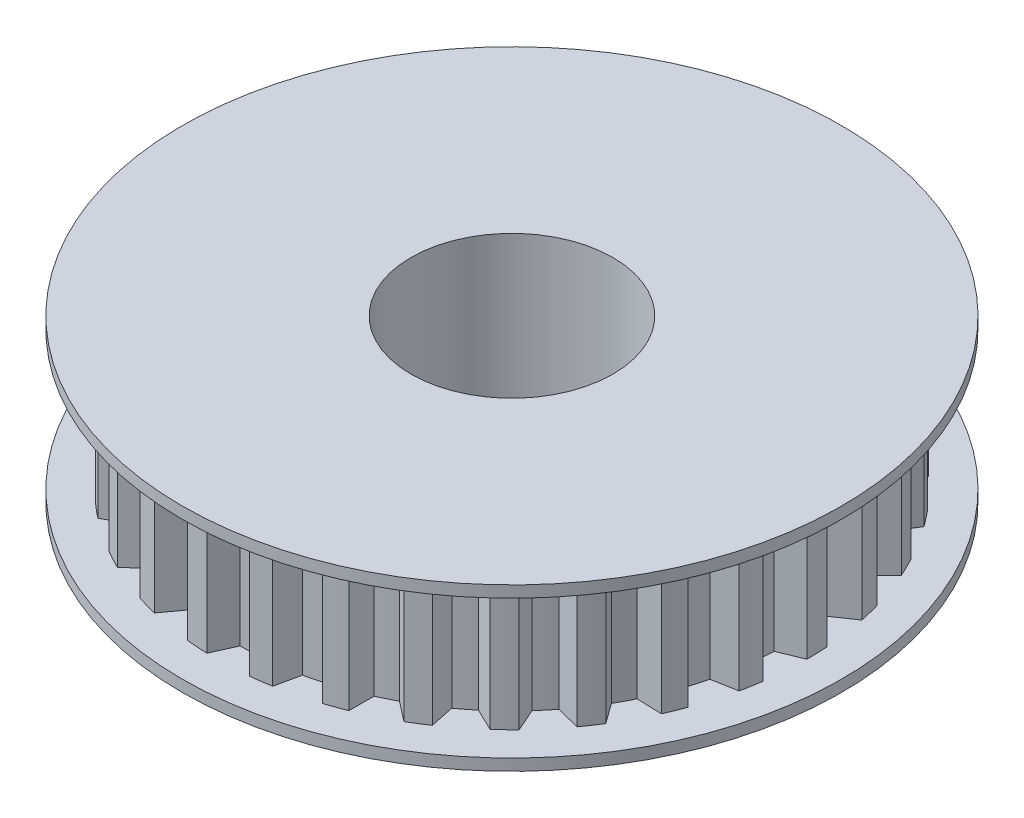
ISO-10303-21;
HEADER;
FILE_DESCRIPTION(('STEP AP214'),'2;1');
FILE_NAME('part.step','',(''),(''),'','','');
FILE_SCHEMA(('AUTOMOTIVE_DESIGN { 1 0 10303 214 1 1 1 1 }'));
ENDSEC;
DATA;
#1=APPLICATION_CONTEXT('core data for automotive mechanical design processes');
#2=APPLICATION_PROTOCOL_DEFINITION('international standard','automotive_design',2000,#1);
#3=PRODUCT_CONTEXT('',#1,'mechanical');
#4=PRODUCT('Part','Part','',(#3));
#5=PRODUCT_RELATED_PRODUCT_CATEGORY('part','',(#4));
#6=PRODUCT_DEFINITION_FORMATION('','',#4);
#7=PRODUCT_DEFINITION_CONTEXT('part definition',#1,'design');
#8=PRODUCT_DEFINITION('design','',#6,#7);
#9=PRODUCT_DEFINITION_SHAPE('','',#8);
#10=(LENGTH_UNIT() NAMED_UNIT(*) SI_UNIT(.MILLI.,.METRE.));
#11=(NAMED_UNIT(*) PLANE_ANGLE_UNIT() SI_UNIT($,.RADIAN.));
#12=(NAMED_UNIT(*) SI_UNIT($,.STERADIAN.) SOLID_ANGLE_UNIT());
#13=UNCERTAINTY_MEASURE_WITH_UNIT(LENGTH_MEASURE(1.E-05),#10,'distance_accuracy_value','');
#14=(GEOMETRIC_REPRESENTATION_CONTEXT(3) GLOBAL_UNCERTAINTY_ASSIGNED_CONTEXT((#13)) GLOBAL_UNIT_ASSIGNED_CONTEXT((#10,
#11,#12)) REPRESENTATION_CONTEXT('',''));
#15=CARTESIAN_POINT('',(0.,0.,0.));
#16=DIRECTION('',(0.,0.,1.));
#17=DIRECTION('',(1.,0.,0.));
#18=AXIS2_PLACEMENT_3D('',#15,#16,#17);
#19=CARTESIAN_POINT('',(0.,1.,0.));
#20=DIRECTION('',(0.,1.,0.));
#21=DIRECTION('',(0.,0.,1.));
#22=AXIS2_PLACEMENT_3D('',#19,#20,#21);
#23=PLANE('',#22);
#24=CARTESIAN_POINT('',(0.,1.,0.));
#25=DIRECTION('',(0.,1.,0.));
#26=DIRECTION('',(0.,0.,1.));
#27=AXIS2_PLACEMENT_3D('',#24,#25,#26);
#28=CIRCLE('',#27,28.575);
#29=CARTESIAN_POINT('',(0.,1.,28.575));
#30=VERTEX_POINT('',#29);
#31=EDGE_CURVE('E11',#30,#30,#28,.T.);
#32=ORIENTED_EDGE('',*,*,#31,.T.);
#33=EDGE_LOOP('',(#32));
#34=FACE_BOUND('',#33,.T.);
#35=CARTESIAN_POINT('',(0.,1.,0.));
#36=DIRECTION('',(0.,1.,0.));
#37=DIRECTION('',(0.,0.,1.));
#38=AXIS2_PLACEMENT_3D('',#35,#36,#37);
#39=CIRCLE('',#38,25.575);
#40=CARTESIAN_POINT('',(25.575,1.,0.));
#41=VERTEX_POINT('',#40);
#42=CARTESIAN_POINT('',(25.512700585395,1.,-1.78402181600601));
#43=VERTEX_POINT('',#42);
#44=EDGE_CURVE('E2063',#41,#43,#39,.T.);
#45=ORIENTED_EDGE('',*,*,#44,.F.);
#46=DIRECTION('',(0.925756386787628,0.,-0.378120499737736));
#47=VECTOR('',#46,1.);
#48=CARTESIAN_POINT('',(25.575,1.,0.));
#49=LINE('',#48,#47);
#50=CARTESIAN_POINT('',(23.5606387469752,1.,0.822755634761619));
#51=VERTEX_POINT('',#50);
#52=EDGE_CURVE('E2026',#51,#41,#49,.T.);
#53=ORIENTED_EDGE('',*,*,#52,.F.);
#54=CARTESIAN_POINT('',(0.,1.,0.));
#55=DIRECTION('',(0.,1.,0.));
#56=DIRECTION('',(-0.20791169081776,0.,0.978147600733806));
#57=AXIS2_PLACEMENT_3D('',#54,#55,#56);
#58=CIRCLE('',#57,23.575);
#59=CARTESIAN_POINT('',(23.445853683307,1.,2.4642585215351));
#60=VERTEX_POINT('',#59);
#61=EDGE_CURVE('E2044',#60,#51,#58,.T.);
#62=ORIENTED_EDGE('',*,*,#61,.F.);
#63=DIRECTION('',(-0.864122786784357,0.,-0.503281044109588));
#64=VECTOR('',#63,1.);
#65=CARTESIAN_POINT('',(25.3261058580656,1.,3.55935205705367));
#66=LINE('',#65,#64);
#67=CARTESIAN_POINT('',(25.3261058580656,1.,3.55935205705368));
#68=VERTEX_POINT('',#67);
#69=EDGE_CURVE('E2041',#68,#60,#66,.T.);
#70=ORIENTED_EDGE('',*,*,#69,.F.);
#71=CARTESIAN_POINT('',(0.,1.,0.));
#72=DIRECTION('',(0.,1.,0.));
#73=DIRECTION('',(-0.20791169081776,0.,0.978147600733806));
#74=AXIS2_PLACEMENT_3D('',#71,#72,#73);
#75=CIRCLE('',#74,25.575);
#76=CARTESIAN_POINT('',(25.0161248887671,1.,5.31734149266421));
#77=VERTEX_POINT('',#76);
#78=EDGE_CURVE('E2020',#77,#68,#75,.T.);
#79=ORIENTED_EDGE('',*,*,#78,.F.);
#80=DIRECTION('',(0.984142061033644,0.,-0.177382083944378));
#81=VECTOR('',#80,1.);
#82=CARTESIAN_POINT('',(25.0161248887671,1.,5.31734149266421));
#83=LINE('',#82,#81);
#84=CARTESIAN_POINT('',(22.8747217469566,1.,5.70330868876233));
#85=VERTEX_POINT('',#84);
#86=EDGE_CURVE('E1982',#85,#77,#83,.T.);
#87=ORIENTED_EDGE('',*,*,#86,.F.);
#88=CARTESIAN_POINT('',(0.,1.,0.));
#89=DIRECTION('',(0.,1.,0.));
#90=DIRECTION('',(-0.406736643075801,0.,0.913545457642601));
#91=AXIS2_PLACEMENT_3D('',#88,#89,#90);
#92=CIRCLE('',#91,23.575);
#93=CARTESIAN_POINT('',(22.4211573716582,1.,7.28507564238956));
#94=VERTEX_POINT('',#93);
#95=EDGE_CURVE('E2000',#94,#85,#92,.T.);
#96=ORIENTED_EDGE('',*,*,#95,.F.);
#97=DIRECTION('',(-0.740601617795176,0.,-0.671944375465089));
#98=VECTOR('',#97,1.);
#99=CARTESIAN_POINT('',(24.0326387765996,1.,8.74716516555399));
#100=LINE('',#99,#98);
#101=CARTESIAN_POINT('',(24.0326387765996,1.,8.747165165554));
#102=VERTEX_POINT('',#101);
#103=EDGE_CURVE('E1997',#102,#94,#100,.T.);
#104=ORIENTED_EDGE('',*,*,#103,.F.);
#105=CARTESIAN_POINT('',(0.,1.,0.));
#106=DIRECTION('',(0.,1.,0.));
#107=DIRECTION('',(-0.406736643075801,0.,0.913545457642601));
#108=AXIS2_PLACEMENT_3D('',#105,#106,#107);
#109=CIRCLE('',#108,25.575);
#110=CARTESIAN_POINT('',(23.3639250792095,1.,10.4022896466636));
#111=VERTEX_POINT('',#110);
#112=EDGE_CURVE('E1976',#111,#102,#109,.T.);
#113=ORIENTED_EDGE('',*,*,#112,.F.);
#114=DIRECTION('',(0.999516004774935,0.,0.0311087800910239));
#115=VECTOR('',#114,1.);
#116=CARTESIAN_POINT('',(23.3639250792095,1.,10.4022896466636));
#117=LINE('',#116,#115);
#118=CARTESIAN_POINT('',(21.1890696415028,1.,10.3345997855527));
#119=VERTEX_POINT('',#118);
#120=EDGE_CURVE('E1938',#119,#111,#117,.T.);
#121=ORIENTED_EDGE('',*,*,#120,.F.);
#122=CARTESIAN_POINT('',(0.,1.,0.));
#123=DIRECTION('',(0.,1.,0.));
#124=DIRECTION('',(-0.587785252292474,0.,0.809016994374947));
#125=AXIS2_PLACEMENT_3D('',#122,#123,#124);
#126=CIRCLE('',#125,23.575);
#127=CARTESIAN_POINT('',(20.416548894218,1.,11.7875000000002));
#128=VERTEX_POINT('',#127);
#129=EDGE_CURVE('E1956',#128,#119,#126,.T.);
#130=ORIENTED_EDGE('',*,*,#129,.F.);
#131=DIRECTION('',(-0.584712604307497,0.,-0.811240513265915));
#132=VECTOR('',#131,1.);
#133=CARTESIAN_POINT('',(21.6888300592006,1.,13.5526851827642));
#134=LINE('',#133,#132);
#135=CARTESIAN_POINT('',(21.6888300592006,1.,13.5526851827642));
#136=VERTEX_POINT('',#135);
#137=EDGE_CURVE('E1953',#136,#128,#134,.T.);
#138=ORIENTED_EDGE('',*,*,#137,.F.);
#139=CARTESIAN_POINT('',(0.,1.,0.));
#140=DIRECTION('',(0.,1.,0.));
#141=DIRECTION('',(-0.587785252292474,0.,0.809016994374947));
#142=AXIS2_PLACEMENT_3D('',#139,#140,#141);
#143=CIRCLE('',#142,25.575);
#144=CARTESIAN_POINT('',(20.6906096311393,1.,15.03260782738));
#145=VERTEX_POINT('',#144);
#146=EDGE_CURVE('E1932',#145,#136,#143,.T.);
#147=ORIENTED_EDGE('',*,*,#146,.F.);
#148=DIRECTION('',(0.971206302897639,0.,0.23824004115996));
#149=VECTOR('',#148,1.);
#150=CARTESIAN_POINT('',(20.6906096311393,1.,15.03260782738));
#151=LINE('',#150,#149);
#152=CARTESIAN_POINT('',(18.5773535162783,1.,14.5142192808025));
#153=VERTEX_POINT('',#152);
#154=EDGE_CURVE('E1894',#153,#145,#151,.T.);
#155=ORIENTED_EDGE('',*,*,#154,.F.);
#156=CARTESIAN_POINT('',(0.,1.,0.));
#157=DIRECTION('',(0.,1.,0.));
#158=DIRECTION('',(-0.743144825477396,0.,0.669130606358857));
#159=AXIS2_PLACEMENT_3D('',#156,#157,#158);
#160=CIRCLE('',#159,23.575);
#161=CARTESIAN_POINT('',(17.5196392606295,1.,15.7747540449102));
#162=VERTEX_POINT('',#161);
#163=EDGE_CURVE('E1912',#162,#153,#160,.T.);
#164=ORIENTED_EDGE('',*,*,#163,.F.);
#165=DIRECTION('',(-0.403268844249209,0.,-0.915081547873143));
#166=VECTOR('',#165,1.);
#167=CARTESIAN_POINT('',(18.397115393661,1.,17.7658878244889));
#168=LINE('',#167,#166);
#169=CARTESIAN_POINT('',(18.397115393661,1.,17.7658878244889));
#170=VERTEX_POINT('',#169);
#171=EDGE_CURVE('E1909',#170,#162,#168,.T.);
#172=ORIENTED_EDGE('',*,*,#171,.F.);
#173=CARTESIAN_POINT('',(0.,1.,0.));
#174=DIRECTION('',(0.,1.,0.));
#175=DIRECTION('',(-0.743144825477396,0.,0.669130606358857));
#176=AXIS2_PLACEMENT_3D('',#173,#174,#175);
#177=CIRCLE('',#176,25.575);
#178=CARTESIAN_POINT('',(17.1130152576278,1.,19.0059289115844));
#179=VERTEX_POINT('',#178);
#180=EDGE_CURVE('E1888',#179,#170,#177,.T.);
#181=ORIENTED_EDGE('',*,*,#180,.F.);
#182=DIRECTION('',(0.900450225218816,0.,0.434959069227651));
#183=VECTOR('',#182,1.);
#184=CARTESIAN_POINT('',(17.1130152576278,1.,19.0059289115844));
#185=LINE('',#184,#183);
#186=CARTESIAN_POINT('',(15.15371789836,1.,18.05949774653));
#187=VERTEX_POINT('',#186);
#188=EDGE_CURVE('E1850',#187,#179,#185,.T.);
#189=ORIENTED_EDGE('',*,*,#188,.F.);
#190=CARTESIAN_POINT('',(0.,1.,0.));
#191=DIRECTION('',(0.,1.,0.));
#192=DIRECTION('',(-0.86602540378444,0.,0.5));
#193=AXIS2_PLACEMENT_3D('',#190,#191,#192);
#194=CIRCLE('',#193,23.575);
#195=CARTESIAN_POINT('',(13.8570373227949,1.,19.0725756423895));
#196=VERTEX_POINT('',#195);
#197=EDGE_CURVE('E1868',#196,#187,#194,.T.);
#198=ORIENTED_EDGE('',*,*,#197,.F.);
#199=DIRECTION('',(-0.20420030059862,0.,-0.978929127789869));
#200=VECTOR('',#199,1.);
#201=CARTESIAN_POINT('',(14.3013585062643,1.,21.2026359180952));
#202=LINE('',#201,#200);
#203=CARTESIAN_POINT('',(14.3013585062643,1.,21.2026359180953));
#204=VERTEX_POINT('',#203);
#205=EDGE_CURVE('E1865',#204,#196,#202,.T.);
#206=ORIENTED_EDGE('',*,*,#205,.F.);
#207=CARTESIAN_POINT('',(0.,1.,0.));
#208=DIRECTION('',(0.,1.,0.));
#209=DIRECTION('',(-0.86602540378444,0.,0.5));
#210=AXIS2_PLACEMENT_3D('',#207,#208,#209);
#211=CIRCLE('',#210,25.575);
#212=CARTESIAN_POINT('',(12.7875,1.,22.148599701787));
#213=VERTEX_POINT('',#212);
#214=EDGE_CURVE('E1844',#213,#204,#211,.T.);
#215=ORIENTED_EDGE('',*,*,#214,.F.);
#216=DIRECTION('',(0.790340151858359,0.,0.612668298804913));
#217=VECTOR('',#216,1.);
#218=CARTESIAN_POINT('',(12.7875,1.,22.148599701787));
#219=LINE('',#218,#217);
#220=CARTESIAN_POINT('',(11.0677920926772,1.,20.8154895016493));
#221=VERTEX_POINT('',#220);
#222=EDGE_CURVE('E1806',#221,#213,#219,.T.);
#223=ORIENTED_EDGE('',*,*,#222,.F.);
#224=CARTESIAN_POINT('',(0.,1.,0.));
#225=DIRECTION('',(0.,1.,0.));
#226=DIRECTION('',(-0.951056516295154,0.,0.309016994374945));
#227=AXIS2_PLACEMENT_3D('',#224,#225,#226);
#228=CIRCLE('',#227,23.575);
#229=CARTESIAN_POINT('',(9.58881636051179,1.,21.5368341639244));
#230=VERTEX_POINT('',#229);
#231=EDGE_CURVE('E1824',#230,#221,#228,.T.);
#232=ORIENTED_EDGE('',*,*,#231,.F.);
#233=DIRECTION('',(0.00379277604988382,0.,-0.999992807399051));
#234=VECTOR('',#233,1.);
#235=CARTESIAN_POINT('',(9.5805636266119,1.,23.7127270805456));
#236=LINE('',#235,#234);
#237=CARTESIAN_POINT('',(9.5805636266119,1.,23.7127270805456));
#238=VERTEX_POINT('',#237);
#239=EDGE_CURVE('E1821',#238,#230,#236,.T.);
#240=ORIENTED_EDGE('',*,*,#239,.F.);
#241=CARTESIAN_POINT('',(0.,1.,0.));
#242=DIRECTION('',(0.,1.,0.));
#243=DIRECTION('',(-0.951056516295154,0.,0.309016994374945));
#244=AXIS2_PLACEMENT_3D('',#241,#242,#243);
#245=CIRCLE('',#244,25.575);
#246=CARTESIAN_POINT('',(7.90310963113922,1.,24.3232704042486));
#247=VERTEX_POINT('',#246);
#248=EDGE_CURVE('E1800',#247,#238,#245,.T.);
#249=ORIENTED_EDGE('',*,*,#248,.F.);
#250=DIRECTION('',(0.645688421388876,0.,0.763600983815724));
#251=VECTOR('',#250,1.);
#252=CARTESIAN_POINT('',(7.90310963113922,1.,24.3232704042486));
#253=LINE('',#252,#251);
#254=CARTESIAN_POINT('',(6.49815066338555,1.,22.6617444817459));
#255=VERTEX_POINT('',#254);
#256=EDGE_CURVE('E1762',#255,#247,#253,.T.);
#257=ORIENTED_EDGE('',*,*,#256,.F.);
#258=CARTESIAN_POINT('',(0.,1.,0.));
#259=DIRECTION('',(0.,1.,0.));
#260=DIRECTION('',(-0.994521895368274,0.,0.10452846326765));
#261=AXIS2_PLACEMENT_3D('',#258,#259,#260);
#262=CIRCLE('',#261,23.575);
#263=CARTESIAN_POINT('',(4.90151811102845,1.,23.0598296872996));
#264=VERTEX_POINT('',#263);
#265=EDGE_CURVE('E1780',#264,#255,#262,.T.);
#266=ORIENTED_EDGE('',*,*,#265,.F.);
#267=DIRECTION('',(0.211620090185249,0.,-0.97735200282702));
#268=VECTOR('',#267,1.);
#269=CARTESIAN_POINT('',(4.44105214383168,1.,25.1864582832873));
#270=LINE('',#269,#268);
#271=CARTESIAN_POINT('',(4.44105214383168,1.,25.1864582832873));
#272=VERTEX_POINT('',#271);
#273=EDGE_CURVE('E1777',#272,#264,#270,.T.);
#274=ORIENTED_EDGE('',*,*,#273,.F.);
#275=CARTESIAN_POINT('',(0.,1.,0.));
#276=DIRECTION('',(0.,1.,0.));
#277=DIRECTION('',(-0.994521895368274,0.,0.10452846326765));
#278=AXIS2_PLACEMENT_3D('',#275,#276,#277);
#279=CIRCLE('',#278,25.575);
#280=CARTESIAN_POINT('',(2.67331544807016,1.,25.4348974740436));
#281=VERTEX_POINT('',#280);
#282=EDGE_CURVE('E1756',#281,#272,#279,.T.);
#283=ORIENTED_EDGE('',*,*,#282,.F.);
#284=DIRECTION('',(0.472817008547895,0.,0.881160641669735));
#285=VECTOR('',#284,1.);
#286=CARTESIAN_POINT('',(2.67331544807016,1.,25.4348974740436));
#287=LINE('',#286,#285);
#288=CARTESIAN_POINT('',(1.64450886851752,1.,23.5175724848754));
#289=VERTEX_POINT('',#288);
#290=EDGE_CURVE('E1718',#289,#281,#287,.T.);
#291=ORIENTED_EDGE('',*,*,#290,.F.);
#292=CARTESIAN_POINT('',(0.,1.,0.));
#293=DIRECTION('',(0.,1.,0.));
#294=DIRECTION('',(-0.994521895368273,0.,-0.104528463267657));
#295=AXIS2_PLACEMENT_3D('',#292,#293,#294);
#296=CIRCLE('',#295,23.575);
#297=CARTESIAN_POINT('',(-2.40692882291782E-13,1.,23.575));
#298=VERTEX_POINT('',#297);
#299=EDGE_CURVE('E1736',#298,#289,#296,.T.);
#300=ORIENTED_EDGE('',*,*,#299,.F.);
#301=DIRECTION('',(0.410198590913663,0.,-0.911996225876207));
#302=VECTOR('',#301,1.);
#303=CARTESIAN_POINT('',(-0.892554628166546,1.,25.5594204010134));
#304=LINE('',#303,#302);
#305=CARTESIAN_POINT('',(-0.892554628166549,1.,25.5594204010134));
#306=VERTEX_POINT('',#305);
#307=EDGE_CURVE('E1733',#306,#298,#304,.T.);
#308=ORIENTED_EDGE('',*,*,#307,.F.);
#309=CARTESIAN_POINT('',(0.,1.,0.));
#310=DIRECTION('',(0.,1.,0.));
#311=DIRECTION('',(-0.994521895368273,0.,-0.104528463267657));
#312=AXIS2_PLACEMENT_3D('',#309,#310,#311);
#313=CIRCLE('',#312,25.575);
#314=CARTESIAN_POINT('',(-2.67331544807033,1.,25.4348974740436));
#315=VERTEX_POINT('',#314);
#316=EDGE_CURVE('E1712',#315,#306,#313,.T.);
#317=ORIENTED_EDGE('',*,*,#316,.F.);
#318=DIRECTION('',(0.279281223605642,0.,0.9602093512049));
#319=VECTOR('',#318,1.);
#320=CARTESIAN_POINT('',(-2.67331544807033,1.,25.4348974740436));
#321=LINE('',#320,#319);
#322=CARTESIAN_POINT('',(-3.28100585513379,1.,23.3455697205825));
#323=VERTEX_POINT('',#322);
#324=EDGE_CURVE('E1674',#323,#315,#321,.T.);
#325=ORIENTED_EDGE('',*,*,#324,.F.);
#326=CARTESIAN_POINT('',(0.,1.,0.));
#327=DIRECTION('',(0.,1.,0.));
#328=DIRECTION('',(-0.951056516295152,0.,-0.309016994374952));
#329=AXIS2_PLACEMENT_3D('',#326,#327,#328);
#330=CIRCLE('',#329,23.575);
#331=CARTESIAN_POINT('',(-4.90151811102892,1.,23.0598296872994));
#332=VERTEX_POINT('',#331);
#333=EDGE_CURVE('E1692',#332,#323,#330,.T.);
#334=ORIENTED_EDGE('',*,*,#333,.F.);
#335=DIRECTION('',(0.590849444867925,0.,-0.806781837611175));
#336=VECTOR('',#335,1.);
#337=CARTESIAN_POINT('',(-6.1871524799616,1.,24.8153131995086));
#338=LINE('',#337,#336);
#339=CARTESIAN_POINT('',(-6.1871524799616,1.,24.8153131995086));
#340=VERTEX_POINT('',#339);
#341=EDGE_CURVE('E1689',#340,#332,#338,.T.);
#342=ORIENTED_EDGE('',*,*,#341,.F.);
#343=CARTESIAN_POINT('',(0.,1.,0.));
#344=DIRECTION('',(0.,1.,0.));
#345=DIRECTION('',(-0.951056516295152,0.,-0.309016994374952));
#346=AXIS2_PLACEMENT_3D('',#343,#344,#345);
#347=CIRCLE('',#346,25.575);
#348=CARTESIAN_POINT('',(-7.90310963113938,1.,24.3232704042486));
#349=VERTEX_POINT('',#348);
#350=EDGE_CURVE('E1668',#349,#340,#347,.T.);
#351=ORIENTED_EDGE('',*,*,#350,.F.);
#352=DIRECTION('',(0.0735395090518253,0.,0.997292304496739));
#353=VECTOR('',#352,1.);
#354=CARTESIAN_POINT('',(-7.90310963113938,1.,24.3232704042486));
#355=LINE('',#354,#353);
#356=CARTESIAN_POINT('',(-8.06312487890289,1.,22.1532535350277));
#357=VERTEX_POINT('',#356);
#358=EDGE_CURVE('E1630',#357,#349,#355,.T.);
#359=ORIENTED_EDGE('',*,*,#358,.F.);
#360=CARTESIAN_POINT('',(0.,1.,0.));
#361=DIRECTION('',(0.,1.,0.));
#362=DIRECTION('',(-0.866025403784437,0.,-0.5));
#363=AXIS2_PLACEMENT_3D('',#360,#361,#362);
#364=CIRCLE('',#363,23.575);
#365=CARTESIAN_POINT('',(-9.58881636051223,1.,21.5368341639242));
#366=VERTEX_POINT('',#365);
#367=EDGE_CURVE('E1648',#366,#357,#364,.T.);
#368=ORIENTED_EDGE('',*,*,#367,.F.);
#369=DIRECTION('',(0.745677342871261,0.,-0.666307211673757));
#370=VECTOR('',#369,1.);
#371=CARTESIAN_POINT('',(-11.2113420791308,1.,22.9866577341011));
#372=LINE('',#371,#370);
#373=CARTESIAN_POINT('',(-11.2113420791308,1.,22.9866577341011));
#374=VERTEX_POINT('',#373);
#375=EDGE_CURVE('E1645',#374,#366,#372,.T.);
#376=ORIENTED_EDGE('',*,*,#375,.F.);
#377=CARTESIAN_POINT('',(0.,1.,0.));
#378=DIRECTION('',(0.,1.,0.));
#379=DIRECTION('',(-0.866025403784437,0.,-0.5));
#380=AXIS2_PLACEMENT_3D('',#377,#378,#379);
#381=CIRCLE('',#380,25.575);
#382=CARTESIAN_POINT('',(-12.7875,1.,22.1485997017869));
#383=VERTEX_POINT('',#382);
#384=EDGE_CURVE('E1624',#383,#374,#381,.T.);
#385=ORIENTED_EDGE('',*,*,#384,.F.);
#386=DIRECTION('',(-0.135416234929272,0.,0.990788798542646));
#387=VECTOR('',#386,1.);
#388=CARTESIAN_POINT('',(-12.7875,1.,22.1485997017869));
#389=LINE('',#388,#387);
#390=CARTESIAN_POINT('',(-12.492846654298,1.,19.9927338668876));
#391=VERTEX_POINT('',#390);
#392=EDGE_CURVE('E1586',#391,#383,#389,.T.);
#393=ORIENTED_EDGE('',*,*,#392,.F.);
#394=CARTESIAN_POINT('',(0.,1.,0.));
#395=DIRECTION('',(0.,1.,0.));
#396=DIRECTION('',(-0.743144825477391,0.,-0.669130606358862));
#397=AXIS2_PLACEMENT_3D('',#394,#395,#396);
#398=CIRCLE('',#397,23.575);
#399=CARTESIAN_POINT('',(-13.8570373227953,1.,19.0725756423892));
#400=VERTEX_POINT('',#399);
#401=EDGE_CURVE('E1604',#400,#391,#398,.T.);
#402=ORIENTED_EDGE('',*,*,#401,.F.);
#403=DIRECTION('',(0.867915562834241,0.,-0.496711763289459));
#404=VECTOR('',#403,1.);
#405=CARTESIAN_POINT('',(-15.7455422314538,1.,20.1533750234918));
#406=LINE('',#405,#404);
#407=CARTESIAN_POINT('',(-15.7455422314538,1.,20.1533750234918));
#408=VERTEX_POINT('',#407);
#409=EDGE_CURVE('E1601',#408,#400,#406,.T.);
#410=ORIENTED_EDGE('',*,*,#409,.F.);
#411=CARTESIAN_POINT('',(0.,1.,0.));
#412=DIRECTION('',(0.,1.,0.));
#413=DIRECTION('',(-0.743144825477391,0.,-0.669130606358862));
#414=AXIS2_PLACEMENT_3D('',#411,#412,#413);
#415=CIRCLE('',#414,25.575);
#416=CARTESIAN_POINT('',(-17.1130152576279,1.,19.0059289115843));
#417=VERTEX_POINT('',#416);
#418=EDGE_CURVE('E1580',#417,#408,#415,.T.);
#419=ORIENTED_EDGE('',*,*,#418,.F.);
#420=DIRECTION('',(-0.338453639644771,0.,0.940983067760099));
#421=VECTOR('',#420,1.);
#422=CARTESIAN_POINT('',(-17.1130152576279,1.,19.0059289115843));
#423=LINE('',#422,#421);
#424=CARTESIAN_POINT('',(-16.376571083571,1.,16.9584357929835));
#425=VERTEX_POINT('',#424);
#426=EDGE_CURVE('E1542',#425,#417,#423,.T.);
#427=ORIENTED_EDGE('',*,*,#426,.F.);
#428=CARTESIAN_POINT('',(0.,1.,0.));
#429=DIRECTION('',(0.,1.,0.));
#430=DIRECTION('',(-0.587785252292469,0.,-0.80901699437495));
#431=AXIS2_PLACEMENT_3D('',#428,#429,#430);
#432=CIRCLE('',#431,23.575);
#433=CARTESIAN_POINT('',(-17.5196392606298,1.,15.7747540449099));
#434=VERTEX_POINT('',#433);
#435=EDGE_CURVE('E1560',#434,#425,#432,.T.);
#436=ORIENTED_EDGE('',*,*,#435,.F.);
#437=DIRECTION('',(0.952221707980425,0.,-0.305407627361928));
#438=VECTOR('',#437,1.);
#439=CARTESIAN_POINT('',(-19.5915866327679,1.,16.4392931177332));
#440=LINE('',#439,#438);
#441=CARTESIAN_POINT('',(-19.5915866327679,1.,16.4392931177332));
#442=VERTEX_POINT('',#441);
#443=EDGE_CURVE('E1557',#442,#434,#440,.T.);
#444=ORIENTED_EDGE('',*,*,#443,.F.);
#445=CARTESIAN_POINT('',(0.,1.,0.));
#446=DIRECTION('',(0.,1.,0.));
#447=DIRECTION('',(-0.587785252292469,0.,-0.80901699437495));
#448=AXIS2_PLACEMENT_3D('',#445,#446,#447);
#449=CIRCLE('',#448,25.575);
#450=CARTESIAN_POINT('',(-20.6906096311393,1.,15.0326078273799));
#451=VERTEX_POINT('',#450);
#452=EDGE_CURVE('E1536',#451,#442,#449,.T.);
#453=ORIENTED_EDGE('',*,*,#452,.F.);
#454=DIRECTION('',(-0.526698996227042,0.,0.850051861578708));
#455=VECTOR('',#454,1.);
#456=CARTESIAN_POINT('',(-20.6906096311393,1.,15.0326078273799));
#457=LINE('',#456,#455);
#458=CARTESIAN_POINT('',(-19.5445607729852,1.,13.1829726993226));
#459=VERTEX_POINT('',#458);
#460=EDGE_CURVE('E1498',#459,#451,#457,.T.);
#461=ORIENTED_EDGE('',*,*,#460,.F.);
#462=CARTESIAN_POINT('',(0.,1.,0.));
#463=DIRECTION('',(0.,1.,0.));
#464=DIRECTION('',(-0.406736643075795,0.,-0.913545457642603));
#465=AXIS2_PLACEMENT_3D('',#462,#463,#464);
#466=CIRCLE('',#465,23.575);
#467=CARTESIAN_POINT('',(-20.4165488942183,1.,11.7874999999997));
#468=VERTEX_POINT('',#467);
#469=EDGE_CURVE('E1516',#468,#459,#466,.T.);
#470=ORIENTED_EDGE('',*,*,#469,.F.);
#471=DIRECTION('',(0.994911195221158,0.,-0.100755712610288));
#472=VECTOR('',#471,1.);
#473=CARTESIAN_POINT('',(-22.5813846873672,1.,12.006735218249));
#474=LINE('',#473,#472);
#475=CARTESIAN_POINT('',(-22.5813846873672,1.,12.006735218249));
#476=VERTEX_POINT('',#475);
#477=EDGE_CURVE('E1513',#476,#468,#474,.T.);
#478=ORIENTED_EDGE('',*,*,#477,.F.);
#479=CARTESIAN_POINT('',(0.,1.,0.));
#480=DIRECTION('',(0.,1.,0.));
#481=DIRECTION('',(-0.406736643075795,0.,-0.913545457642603));
#482=AXIS2_PLACEMENT_3D('',#479,#480,#481);
#483=CIRCLE('',#482,25.575);
#484=CARTESIAN_POINT('',(-23.3639250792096,1.,10.4022896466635));
#485=VERTEX_POINT('',#484);
#486=EDGE_CURVE('E1492',#485,#476,#483,.T.);
#487=ORIENTED_EDGE('',*,*,#486,.F.);
#488=DIRECTION('',(-0.691925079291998,0.,0.721969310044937));
#489=VECTOR('',#488,1.);
#490=CARTESIAN_POINT('',(-23.3639250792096,1.,10.4022896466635));
#491=LINE('',#490,#489);
#492=CARTESIAN_POINT('',(-21.8583593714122,1.,8.83135043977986));
#493=VERTEX_POINT('',#492);
#494=EDGE_CURVE('E1454',#493,#485,#491,.T.);
#495=ORIENTED_EDGE('',*,*,#494,.F.);
#496=CARTESIAN_POINT('',(0.,1.,0.));
#497=DIRECTION('',(0.,1.,0.));
#498=DIRECTION('',(-0.207911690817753,0.,-0.978147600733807));
#499=AXIS2_PLACEMENT_3D('',#496,#497,#498);
#500=CIRCLE('',#499,23.575);
#501=CARTESIAN_POINT('',(-22.4211573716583,1.,7.2850756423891));
#502=VERTEX_POINT('',#501);
#503=EDGE_CURVE('E1472',#502,#493,#500,.T.);
#504=ORIENTED_EDGE('',*,*,#503,.F.);
#505=DIRECTION('',(0.994118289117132,0.,0.108299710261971));
#506=VECTOR('',#505,1.);
#507=CARTESIAN_POINT('',(-24.5842678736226,1.,7.04942537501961));
#508=LINE('',#507,#506);
#509=CARTESIAN_POINT('',(-24.5842678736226,1.,7.04942537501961));
#510=VERTEX_POINT('',#509);
#511=EDGE_CURVE('E1469',#510,#502,#508,.T.);
#512=ORIENTED_EDGE('',*,*,#511,.F.);
#513=CARTESIAN_POINT('',(0.,1.,0.));
#514=DIRECTION('',(0.,1.,0.));
#515=DIRECTION('',(-0.207911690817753,0.,-0.978147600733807));
#516=AXIS2_PLACEMENT_3D('',#513,#514,#515);
#517=CIRCLE('',#516,25.575);
#518=CARTESIAN_POINT('',(-25.0161248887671,1.,5.31734149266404));
#519=VERTEX_POINT('',#518);
#520=EDGE_CURVE('E1448',#519,#510,#517,.T.);
#521=ORIENTED_EDGE('',*,*,#520,.F.);
#522=DIRECTION('',(-0.826910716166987,0.,0.56233323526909));
#523=VECTOR('',#522,1.);
#524=CARTESIAN_POINT('',(-25.0161248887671,1.,5.31734149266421));
#525=LINE('',#524,#523);
#526=CARTESIAN_POINT('',(-23.2168427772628,1.,4.09375578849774));
#527=VERTEX_POINT('',#526);
#528=EDGE_CURVE('E1410',#527,#519,#525,.T.);
#529=ORIENTED_EDGE('',*,*,#528,.F.);
#530=CARTESIAN_POINT('',(0.,1.,0.));
#531=DIRECTION('',(0.,1.,0.));
#532=DIRECTION('',(0.,0.,-1.));
#533=AXIS2_PLACEMENT_3D('',#530,#531,#532);
#534=CIRCLE('',#533,23.575);
#535=CARTESIAN_POINT('',(-23.445853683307,1.,2.46425852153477));
#536=VERTEX_POINT('',#535);
#537=EDGE_CURVE('E1428',#536,#527,#534,.T.);
#538=ORIENTED_EDGE('',*,*,#537,.F.);
#539=DIRECTION('',(0.94987764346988,0.,0.312621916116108));
#540=VECTOR('',#539,1.);
#541=CARTESIAN_POINT('',(-25.512700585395,1.,1.78402181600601));
#542=LINE('',#541,#540);
#543=CARTESIAN_POINT('',(-25.512700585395,1.,1.78402181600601));
#544=VERTEX_POINT('',#543);
#545=EDGE_CURVE('E1425',#544,#536,#542,.T.);
#546=ORIENTED_EDGE('',*,*,#545,.F.);
#547=CARTESIAN_POINT('',(0.,1.,0.));
#548=DIRECTION('',(0.,1.,0.));
#549=DIRECTION('',(0.,0.,-1.));
#550=AXIS2_PLACEMENT_3D('',#547,#548,#549);
#551=CIRCLE('',#550,25.575);
#552=CARTESIAN_POINT('',(-25.575,1.,0.));
#553=VERTEX_POINT('',#552);
#554=EDGE_CURVE('E1404',#553,#544,#551,.T.);
#555=ORIENTED_EDGE('',*,*,#554,.F.);
#556=DIRECTION('',(-0.925756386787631,0.,0.378120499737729));
#557=VECTOR('',#556,1.);
#558=CARTESIAN_POINT('',(-25.575,1.,-1.70870262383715E-13));
#559=LINE('',#558,#557);
#560=CARTESIAN_POINT('',(-23.5606387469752,1.,-0.822755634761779));
#561=VERTEX_POINT('',#560);
#562=EDGE_CURVE('E1366',#561,#553,#559,.T.);
#563=ORIENTED_EDGE('',*,*,#562,.F.);
#564=CARTESIAN_POINT('',(0.,1.,0.));
#565=DIRECTION('',(0.,1.,0.));
#566=DIRECTION('',(0.207911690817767,0.,-0.978147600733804));
#567=AXIS2_PLACEMENT_3D('',#564,#565,#566);
#568=CIRCLE('',#567,23.575);
#569=CARTESIAN_POINT('',(-23.445853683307,1.,-2.46425852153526));
#570=VERTEX_POINT('',#569);
#571=EDGE_CURVE('E1384',#570,#561,#568,.T.);
#572=ORIENTED_EDGE('',*,*,#571,.F.);
#573=DIRECTION('',(0.864122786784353,0.,0.503281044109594));
#574=VECTOR('',#573,1.);
#575=CARTESIAN_POINT('',(-25.3261058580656,1.,-3.55935205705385));
#576=LINE('',#575,#574);
#577=CARTESIAN_POINT('',(-25.3261058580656,1.,-3.55935205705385));
#578=VERTEX_POINT('',#577);
#579=EDGE_CURVE('E1381',#578,#570,#576,.T.);
#580=ORIENTED_EDGE('',*,*,#579,.F.);
#581=CARTESIAN_POINT('',(0.,1.,0.));
#582=DIRECTION('',(0.,1.,0.));
#583=DIRECTION('',(0.207911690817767,0.,-0.978147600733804));
#584=AXIS2_PLACEMENT_3D('',#581,#582,#583);
#585=CIRCLE('',#584,25.575);
#586=CARTESIAN_POINT('',(-25.016124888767,1.,-5.31734149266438));
#587=VERTEX_POINT('',#586);
#588=EDGE_CURVE('E1360',#587,#578,#585,.T.);
#589=ORIENTED_EDGE('',*,*,#588,.F.);
#590=DIRECTION('',(-0.984142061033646,0.,0.177382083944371));
#591=VECTOR('',#590,1.);
#592=CARTESIAN_POINT('',(-25.016124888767,1.,-5.31734149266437));
#593=LINE('',#592,#591);
#594=CARTESIAN_POINT('',(-22.8747217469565,1.,-5.70330868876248));
#595=VERTEX_POINT('',#594);
#596=EDGE_CURVE('E1322',#595,#587,#593,.T.);
#597=ORIENTED_EDGE('',*,*,#596,.F.);
#598=CARTESIAN_POINT('',(0.,1.,0.));
#599=DIRECTION('',(0.,1.,0.));
#600=DIRECTION('',(0.406736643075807,0.,-0.913545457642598));
#601=AXIS2_PLACEMENT_3D('',#598,#599,#600);
#602=CIRCLE('',#601,23.575);
#603=CARTESIAN_POINT('',(-22.4211573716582,1.,-7.2850756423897));
#604=VERTEX_POINT('',#603);
#605=EDGE_CURVE('E1340',#604,#595,#602,.T.);
#606=ORIENTED_EDGE('',*,*,#605,.F.);
#607=DIRECTION('',(0.740601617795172,0.,0.671944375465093));
#608=VECTOR('',#607,1.);
#609=CARTESIAN_POINT('',(-24.0326387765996,1.,-8.74716516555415));
#610=LINE('',#609,#608);
#611=CARTESIAN_POINT('',(-24.0326387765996,1.,-8.74716516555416));
#612=VERTEX_POINT('',#611);
#613=EDGE_CURVE('E1337',#612,#604,#610,.T.);
#614=ORIENTED_EDGE('',*,*,#613,.F.);
#615=CARTESIAN_POINT('',(0.,1.,0.));
#616=DIRECTION('',(0.,1.,0.));
#617=DIRECTION('',(0.406736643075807,0.,-0.913545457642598));
#618=AXIS2_PLACEMENT_3D('',#615,#616,#617);
#619=CIRCLE('',#618,25.575);
#620=CARTESIAN_POINT('',(-23.3639250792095,1.,-10.4022896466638));
#621=VERTEX_POINT('',#620);
#622=EDGE_CURVE('E1316',#621,#612,#619,.T.);
#623=ORIENTED_EDGE('',*,*,#622,.F.);
#624=DIRECTION('',(-0.999516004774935,0.,-0.0311087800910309));
#625=VECTOR('',#624,1.);
#626=CARTESIAN_POINT('',(-23.3639250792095,1.,-10.4022896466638));
#627=LINE('',#626,#625);
#628=CARTESIAN_POINT('',(-21.1890696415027,1.,-10.3345997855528));
#629=VERTEX_POINT('',#628);
#630=EDGE_CURVE('E1278',#629,#621,#627,.T.);
#631=ORIENTED_EDGE('',*,*,#630,.F.);
#632=CARTESIAN_POINT('',(0.,1.,0.));
#633=DIRECTION('',(0.,1.,0.));
#634=DIRECTION('',(0.58778525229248,0.,-0.809016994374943));
#635=AXIS2_PLACEMENT_3D('',#632,#633,#634);
#636=CIRCLE('',#635,23.575);
#637=CARTESIAN_POINT('',(-20.416548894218,1.,-11.7875000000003));
#638=VERTEX_POINT('',#637);
#639=EDGE_CURVE('E1296',#638,#629,#636,.T.);
#640=ORIENTED_EDGE('',*,*,#639,.F.);
#641=DIRECTION('',(0.584712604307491,0.,0.811240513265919));
#642=VECTOR('',#641,1.);
#643=CARTESIAN_POINT('',(-21.6888300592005,1.,-13.5526851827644));
#644=LINE('',#643,#642);
#645=CARTESIAN_POINT('',(-21.6888300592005,1.,-13.5526851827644));
#646=VERTEX_POINT('',#645);
#647=EDGE_CURVE('E1293',#646,#638,#644,.T.);
#648=ORIENTED_EDGE('',*,*,#647,.F.);
#649=CARTESIAN_POINT('',(0.,1.,0.));
#650=DIRECTION('',(0.,1.,0.));
#651=DIRECTION('',(0.58778525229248,0.,-0.809016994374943));
#652=AXIS2_PLACEMENT_3D('',#649,#650,#651);
#653=CIRCLE('',#652,25.575);
#654=CARTESIAN_POINT('',(-20.6906096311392,1.,-15.0326078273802));
#655=VERTEX_POINT('',#654);
#656=EDGE_CURVE('E1272',#655,#646,#653,.T.);
#657=ORIENTED_EDGE('',*,*,#656,.F.);
#658=DIRECTION('',(-0.971206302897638,0.,-0.238240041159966));
#659=VECTOR('',#658,1.);
#660=CARTESIAN_POINT('',(-20.6906096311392,1.,-15.0326078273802));
#661=LINE('',#660,#659);
#662=CARTESIAN_POINT('',(-18.5773535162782,1.,-14.5142192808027));
#663=VERTEX_POINT('',#662);
#664=EDGE_CURVE('E1234',#663,#655,#661,.T.);
#665=ORIENTED_EDGE('',*,*,#664,.F.);
#666=CARTESIAN_POINT('',(0.,1.,0.));
#667=DIRECTION('',(0.,1.,0.));
#668=DIRECTION('',(0.7431448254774,0.,-0.669130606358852));
#669=AXIS2_PLACEMENT_3D('',#666,#667,#668);
#670=CIRCLE('',#669,23.575);
#671=CARTESIAN_POINT('',(-17.5196392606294,1.,-15.7747540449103));
#672=VERTEX_POINT('',#671);
#673=EDGE_CURVE('E1252',#672,#663,#670,.T.);
#674=ORIENTED_EDGE('',*,*,#673,.F.);
#675=DIRECTION('',(0.403268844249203,0.,0.915081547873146));
#676=VECTOR('',#675,1.);
#677=CARTESIAN_POINT('',(-18.3971153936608,1.,-17.765887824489));
#678=LINE('',#677,#676);
#679=CARTESIAN_POINT('',(-18.3971153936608,1.,-17.765887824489));
#680=VERTEX_POINT('',#679);
#681=EDGE_CURVE('E1249',#680,#672,#678,.T.);
#682=ORIENTED_EDGE('',*,*,#681,.F.);
#683=CARTESIAN_POINT('',(0.,1.,0.));
#684=DIRECTION('',(0.,1.,0.));
#685=DIRECTION('',(0.7431448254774,0.,-0.669130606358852));
#686=AXIS2_PLACEMENT_3D('',#683,#684,#685);
#687=CIRCLE('',#686,25.575);
#688=CARTESIAN_POINT('',(-17.1130152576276,1.,-19.0059289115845));
#689=VERTEX_POINT('',#688);
#690=EDGE_CURVE('E1228',#689,#680,#687,.T.);
#691=ORIENTED_EDGE('',*,*,#690,.F.);
#692=DIRECTION('',(-0.900450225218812,0.,-0.434959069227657));
#693=VECTOR('',#692,1.);
#694=CARTESIAN_POINT('',(-17.1130152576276,1.,-19.0059289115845));
#695=LINE('',#694,#693);
#696=CARTESIAN_POINT('',(-15.1537178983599,1.,-18.0594977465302));
#697=VERTEX_POINT('',#696);
#698=EDGE_CURVE('E1190',#697,#689,#695,.T.);
#699=ORIENTED_EDGE('',*,*,#698,.F.);
#700=CARTESIAN_POINT('',(0.,1.,0.));
#701=DIRECTION('',(0.,1.,0.));
#702=DIRECTION('',(0.866025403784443,0.,-0.499999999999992));
#703=AXIS2_PLACEMENT_3D('',#700,#701,#702);
#704=CIRCLE('',#703,23.575);
#705=CARTESIAN_POINT('',(-13.8570373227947,1.,-19.0725756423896));
#706=VERTEX_POINT('',#705);
#707=EDGE_CURVE('E1208',#706,#697,#704,.T.);
#708=ORIENTED_EDGE('',*,*,#707,.F.);
#709=DIRECTION('',(0.204200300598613,0.,0.97892912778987));
#710=VECTOR('',#709,1.);
#711=CARTESIAN_POINT('',(-14.3013585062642,1.,-21.2026359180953));
#712=LINE('',#711,#710);
#713=CARTESIAN_POINT('',(-14.3013585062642,1.,-21.2026359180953));
#714=VERTEX_POINT('',#713);
#715=EDGE_CURVE('E1205',#714,#706,#712,.T.);
#716=ORIENTED_EDGE('',*,*,#715,.F.);
#717=CARTESIAN_POINT('',(0.,1.,0.));
#718=DIRECTION('',(0.,1.,0.));
#719=DIRECTION('',(0.866025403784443,0.,-0.499999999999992));
#720=AXIS2_PLACEMENT_3D('',#717,#718,#719);
#721=CIRCLE('',#720,25.575);
#722=CARTESIAN_POINT('',(-12.7874999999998,1.,-22.1485997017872));
#723=VERTEX_POINT('',#722);
#724=EDGE_CURVE('E1184',#723,#714,#721,.T.);
#725=ORIENTED_EDGE('',*,*,#724,.F.);
#726=DIRECTION('',(-0.790340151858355,0.,-0.612668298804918));
#727=VECTOR('',#726,1.);
#728=CARTESIAN_POINT('',(-12.7874999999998,1.,-22.1485997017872));
#729=LINE('',#728,#727);
#730=CARTESIAN_POINT('',(-11.067792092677,1.,-20.8154895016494));
#731=VERTEX_POINT('',#730);
#732=EDGE_CURVE('E1146',#731,#723,#729,.T.);
#733=ORIENTED_EDGE('',*,*,#732,.F.);
#734=CARTESIAN_POINT('',(0.,1.,0.));
#735=DIRECTION('',(0.,1.,0.));
#736=DIRECTION('',(0.951056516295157,0.,-0.309016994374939));
#737=AXIS2_PLACEMENT_3D('',#734,#735,#736);
#738=CIRCLE('',#737,23.575);
#739=CARTESIAN_POINT('',(-9.58881636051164,1.,-21.5368341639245));
#740=VERTEX_POINT('',#739);
#741=EDGE_CURVE('E1164',#740,#731,#738,.T.);
#742=ORIENTED_EDGE('',*,*,#741,.F.);
#743=DIRECTION('',(-0.00379277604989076,0.,0.999992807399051));
#744=VECTOR('',#743,1.);
#745=CARTESIAN_POINT('',(-9.58056362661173,1.,-23.7127270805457));
#746=LINE('',#745,#744);
#747=CARTESIAN_POINT('',(-9.58056362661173,1.,-23.7127270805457));
#748=VERTEX_POINT('',#747);
#749=EDGE_CURVE('E1161',#748,#740,#746,.T.);
#750=ORIENTED_EDGE('',*,*,#749,.F.);
#751=CARTESIAN_POINT('',(0.,1.,0.));
#752=DIRECTION('',(0.,1.,0.));
#753=DIRECTION('',(0.951056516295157,0.,-0.309016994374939));
#754=AXIS2_PLACEMENT_3D('',#751,#752,#753);
#755=CIRCLE('',#754,25.575);
#756=CARTESIAN_POINT('',(-7.90310963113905,1.,-24.3232704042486));
#757=VERTEX_POINT('',#756);
#758=EDGE_CURVE('E1140',#757,#748,#755,.T.);
#759=ORIENTED_EDGE('',*,*,#758,.F.);
#760=DIRECTION('',(-0.645688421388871,0.,-0.763600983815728));
#761=VECTOR('',#760,1.);
#762=CARTESIAN_POINT('',(-7.90310963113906,1.,-24.3232704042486));
#763=LINE('',#762,#761);
#764=CARTESIAN_POINT('',(-6.49815066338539,1.,-22.661744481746));
#765=VERTEX_POINT('',#764);
#766=EDGE_CURVE('E1103',#765,#757,#763,.T.);
#767=ORIENTED_EDGE('',*,*,#766,.F.);
#768=CARTESIAN_POINT('',(0.,1.,0.));
#769=DIRECTION('',(0.,1.,0.));
#770=DIRECTION('',(0.994521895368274,0.,-0.104528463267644));
#771=AXIS2_PLACEMENT_3D('',#768,#769,#770);
#772=CIRCLE('',#771,23.575);
#773=CARTESIAN_POINT('',(-4.9015181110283,1.,-23.0598296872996));
#774=VERTEX_POINT('',#773);
#775=EDGE_CURVE('E1120',#774,#765,#772,.T.);
#776=ORIENTED_EDGE('',*,*,#775,.F.);
#777=DIRECTION('',(-0.211620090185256,0.,0.977352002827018));
#778=VECTOR('',#777,1.);
#779=CARTESIAN_POINT('',(-4.44105214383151,1.,-25.1864582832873));
#780=LINE('',#779,#778);
#781=CARTESIAN_POINT('',(-4.44105214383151,1.,-25.1864582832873));
#782=VERTEX_POINT('',#781);
#783=EDGE_CURVE('E1117',#782,#774,#780,.T.);
#784=ORIENTED_EDGE('',*,*,#783,.F.);
#785=CARTESIAN_POINT('',(0.,1.,0.));
#786=DIRECTION('',(0.,1.,0.));
#787=DIRECTION('',(0.994521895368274,0.,-0.104528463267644));
#788=AXIS2_PLACEMENT_3D('',#785,#786,#787);
#789=CIRCLE('',#788,25.575);
#790=CARTESIAN_POINT('',(-2.67331544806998,1.,-25.4348974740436));
#791=VERTEX_POINT('',#790);
#792=EDGE_CURVE('E1097',#791,#782,#789,.T.);
#793=ORIENTED_EDGE('',*,*,#792,.F.);
#794=DIRECTION('',(-0.472817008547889,0.,-0.881160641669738));
#795=VECTOR('',#794,1.);
#796=CARTESIAN_POINT('',(-2.67331544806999,1.,-25.4348974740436));
#797=LINE('',#796,#795);
#798=CARTESIAN_POINT('',(-1.64450886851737,1.,-23.5175724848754));
#799=VERTEX_POINT('',#798);
#800=EDGE_CURVE('E1059',#799,#791,#797,.T.);
#801=ORIENTED_EDGE('',*,*,#800,.F.);
#802=CARTESIAN_POINT('',(0.,1.,0.));
#803=DIRECTION('',(0.,1.,0.));
#804=DIRECTION('',(0.994521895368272,0.,0.104528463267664));
#805=AXIS2_PLACEMENT_3D('',#802,#803,#804);
#806=CIRCLE('',#805,23.575);
#807=CARTESIAN_POINT('',(3.94649590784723E-13,1.,-23.575));
#808=VERTEX_POINT('',#807);
#809=EDGE_CURVE('E1077',#808,#799,#806,.T.);
#810=ORIENTED_EDGE('',*,*,#809,.F.);
#811=DIRECTION('',(-0.410198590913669,0.,0.911996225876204));
#812=VECTOR('',#811,1.);
#813=CARTESIAN_POINT('',(0.892554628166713,1.,-25.5594204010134));
#814=LINE('',#813,#812);
#815=CARTESIAN_POINT('',(0.892554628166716,1.,-25.5594204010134));
#816=VERTEX_POINT('',#815);
#817=EDGE_CURVE('E1074',#816,#808,#814,.T.);
#818=ORIENTED_EDGE('',*,*,#817,.F.);
#819=CARTESIAN_POINT('',(0.,1.,0.));
#820=DIRECTION('',(0.,1.,0.));
#821=DIRECTION('',(0.994521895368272,0.,0.104528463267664));
#822=AXIS2_PLACEMENT_3D('',#819,#820,#821);
#823=CIRCLE('',#822,25.575);
#824=CARTESIAN_POINT('',(2.67331544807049,1.,-25.4348974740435));
#825=VERTEX_POINT('',#824);
#826=EDGE_CURVE('E1053',#825,#816,#823,.T.);
#827=ORIENTED_EDGE('',*,*,#826,.F.);
#828=DIRECTION('',(-0.279281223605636,0.,-0.960209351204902));
#829=VECTOR('',#828,1.);
#830=CARTESIAN_POINT('',(2.67331544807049,1.,-25.4348974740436));
#831=LINE('',#830,#829);
#832=CARTESIAN_POINT('',(3.28100585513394,1.,-23.3455697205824));
#833=VERTEX_POINT('',#832);
#834=EDGE_CURVE('E1015',#833,#825,#831,.T.);
#835=ORIENTED_EDGE('',*,*,#834,.F.);
#836=CARTESIAN_POINT('',(0.,1.,0.));
#837=DIRECTION('',(0.,1.,0.));
#838=DIRECTION('',(0.95105651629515,0.,0.309016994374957));
#839=AXIS2_PLACEMENT_3D('',#836,#837,#838);
#840=CIRCLE('',#839,23.575);
#841=CARTESIAN_POINT('',(4.90151811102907,1.,-23.0598296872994));
#842=VERTEX_POINT('',#841);
#843=EDGE_CURVE('E1033',#842,#833,#840,.T.);
#844=ORIENTED_EDGE('',*,*,#843,.F.);
#845=DIRECTION('',(-0.59084944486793,0.,0.806781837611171));
#846=VECTOR('',#845,1.);
#847=CARTESIAN_POINT('',(6.18715247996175,1.,-24.8153131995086));
#848=LINE('',#847,#846);
#849=CARTESIAN_POINT('',(6.18715247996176,1.,-24.8153131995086));
#850=VERTEX_POINT('',#849);
#851=EDGE_CURVE('E1030',#850,#842,#848,.T.);
#852=ORIENTED_EDGE('',*,*,#851,.F.);
#853=CARTESIAN_POINT('',(0.,1.,0.));
#854=DIRECTION('',(0.,1.,0.));
#855=DIRECTION('',(0.95105651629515,0.,0.309016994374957));
#856=AXIS2_PLACEMENT_3D('',#853,#854,#855);
#857=CIRCLE('',#856,25.575);
#858=CARTESIAN_POINT('',(7.90310963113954,1.,-24.3232704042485));
#859=VERTEX_POINT('',#858);
#860=EDGE_CURVE('E1009',#859,#850,#857,.T.);
#861=ORIENTED_EDGE('',*,*,#860,.F.);
#862=DIRECTION('',(-0.0735395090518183,0.,-0.99729230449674));
#863=VECTOR('',#862,1.);
#864=CARTESIAN_POINT('',(7.90310963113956,1.,-24.3232704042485));
#865=LINE('',#864,#863);
#866=CARTESIAN_POINT('',(8.06312487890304,1.,-22.1532535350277));
#867=VERTEX_POINT('',#866);
#868=EDGE_CURVE('E971',#867,#859,#865,.T.);
#869=ORIENTED_EDGE('',*,*,#868,.F.);
#870=CARTESIAN_POINT('',(0.,1.,0.));
#871=DIRECTION('',(0.,1.,0.));
#872=DIRECTION('',(0.866025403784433,0.,0.50000000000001));
#873=AXIS2_PLACEMENT_3D('',#870,#871,#872);
#874=CIRCLE('',#873,23.575);
#875=CARTESIAN_POINT('',(9.58881636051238,1.,-21.5368341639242));
#876=VERTEX_POINT('',#875);
#877=EDGE_CURVE('E989',#876,#867,#874,.T.);
#878=ORIENTED_EDGE('',*,*,#877,.F.);
#879=DIRECTION('',(-0.745677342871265,0.,0.666307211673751));
#880=VECTOR('',#879,1.);
#881=CARTESIAN_POINT('',(11.2113420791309,1.,-22.9866577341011));
#882=LINE('',#881,#880);
#883=CARTESIAN_POINT('',(11.2113420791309,1.,-22.986657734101));
#884=VERTEX_POINT('',#883);
#885=EDGE_CURVE('E986',#884,#876,#882,.T.);
#886=ORIENTED_EDGE('',*,*,#885,.F.);
#887=CARTESIAN_POINT('',(0.,1.,0.));
#888=DIRECTION('',(0.,1.,0.));
#889=DIRECTION('',(0.866025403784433,0.,0.50000000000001));
#890=AXIS2_PLACEMENT_3D('',#887,#888,#889);
#891=CIRCLE('',#890,25.575);
#892=CARTESIAN_POINT('',(12.7875000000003,1.,-22.1485997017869));
#893=VERTEX_POINT('',#892);
#894=EDGE_CURVE('E965',#893,#884,#891,.T.);
#895=ORIENTED_EDGE('',*,*,#894,.F.);
#896=DIRECTION('',(0.135416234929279,0.,-0.990788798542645));
#897=VECTOR('',#896,1.);
#898=CARTESIAN_POINT('',(12.7875000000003,1.,-22.1485997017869));
#899=LINE('',#898,#897);
#900=CARTESIAN_POINT('',(12.4928466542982,1.,-19.9927338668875));
#901=VERTEX_POINT('',#900);
#902=EDGE_CURVE('E927',#901,#893,#899,.T.);
#903=ORIENTED_EDGE('',*,*,#902,.F.);
#904=CARTESIAN_POINT('',(0.,1.,0.));
#905=DIRECTION('',(0.,1.,0.));
#906=DIRECTION('',(0.743144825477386,0.,0.669130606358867));
#907=AXIS2_PLACEMENT_3D('',#904,#905,#906);
#908=CIRCLE('',#907,23.575);
#909=CARTESIAN_POINT('',(13.8570373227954,1.,-19.0725756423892));
#910=VERTEX_POINT('',#909);
#911=EDGE_CURVE('E945',#910,#901,#908,.T.);
#912=ORIENTED_EDGE('',*,*,#911,.F.);
#913=DIRECTION('',(-0.867915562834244,0.,0.496711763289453));
#914=VECTOR('',#913,1.);
#915=CARTESIAN_POINT('',(15.745542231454,1.,-20.1533750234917));
#916=LINE('',#915,#914);
#917=CARTESIAN_POINT('',(15.745542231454,1.,-20.1533750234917));
#918=VERTEX_POINT('',#917);
#919=EDGE_CURVE('E942',#918,#910,#916,.T.);
#920=ORIENTED_EDGE('',*,*,#919,.F.);
#921=CARTESIAN_POINT('',(0.,1.,0.));
#922=DIRECTION('',(0.,1.,0.));
#923=DIRECTION('',(0.743144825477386,0.,0.669130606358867));
#924=AXIS2_PLACEMENT_3D('',#921,#922,#923);
#925=CIRCLE('',#924,25.575);
#926=CARTESIAN_POINT('',(17.113015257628,1.,-19.0059289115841));
#927=VERTEX_POINT('',#926);
#928=EDGE_CURVE('E921',#927,#918,#925,.T.);
#929=ORIENTED_EDGE('',*,*,#928,.F.);
#930=DIRECTION('',(0.338453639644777,0.,-0.940983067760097));
#931=VECTOR('',#930,1.);
#932=CARTESIAN_POINT('',(17.113015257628,1.,-19.0059289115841));
#933=LINE('',#932,#931);
#934=CARTESIAN_POINT('',(16.3765710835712,1.,-16.9584357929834));
#935=VERTEX_POINT('',#934);
#936=EDGE_CURVE('E883',#935,#927,#933,.T.);
#937=ORIENTED_EDGE('',*,*,#936,.F.);
#938=CARTESIAN_POINT('',(0.,1.,0.));
#939=DIRECTION('',(0.,1.,0.));
#940=DIRECTION('',(0.587785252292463,0.,0.809016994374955));
#941=AXIS2_PLACEMENT_3D('',#938,#939,#940);
#942=CIRCLE('',#941,23.575);
#943=CARTESIAN_POINT('',(17.5196392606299,1.,-15.7747540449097));
#944=VERTEX_POINT('',#943);
#945=EDGE_CURVE('E901',#944,#935,#942,.T.);
#946=ORIENTED_EDGE('',*,*,#945,.F.);
#947=DIRECTION('',(-0.952221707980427,0.,0.305407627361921));
#948=VECTOR('',#947,1.);
#949=CARTESIAN_POINT('',(19.5915866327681,1.,-16.439293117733));
#950=LINE('',#949,#948);
#951=CARTESIAN_POINT('',(19.5915866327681,1.,-16.439293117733));
#952=VERTEX_POINT('',#951);
#953=EDGE_CURVE('E898',#952,#944,#950,.T.);
#954=ORIENTED_EDGE('',*,*,#953,.F.);
#955=CARTESIAN_POINT('',(0.,1.,0.));
#956=DIRECTION('',(0.,1.,0.));
#957=DIRECTION('',(0.587785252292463,0.,0.809016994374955));
#958=AXIS2_PLACEMENT_3D('',#955,#956,#957);
#959=CIRCLE('',#958,25.575);
#960=CARTESIAN_POINT('',(20.6906096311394,1.,-15.0326078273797));
#961=VERTEX_POINT('',#960);
#962=EDGE_CURVE('E794',#961,#952,#959,.T.);
#963=ORIENTED_EDGE('',*,*,#962,.F.);
#964=DIRECTION('',(0.526698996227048,0.,-0.850051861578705));
#965=VECTOR('',#964,1.);
#966=CARTESIAN_POINT('',(20.6906096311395,1.,-15.0326078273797));
#967=LINE('',#966,#965);
#968=CARTESIAN_POINT('',(19.5445607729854,1.,-13.1829726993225));
#969=VERTEX_POINT('',#968);
#970=EDGE_CURVE('E806',#969,#961,#967,.T.);
#971=ORIENTED_EDGE('',*,*,#970,.F.);
#972=CARTESIAN_POINT('',(0.,1.,0.));
#973=DIRECTION('',(0.,1.,0.));
#974=DIRECTION('',(0.406736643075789,0.,0.913545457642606));
#975=AXIS2_PLACEMENT_3D('',#972,#973,#974);
#976=CIRCLE('',#975,23.575);
#977=CARTESIAN_POINT('',(20.4165488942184,1.,-11.7874999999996));
#978=VERTEX_POINT('',#977);
#979=EDGE_CURVE('E863',#978,#969,#976,.T.);
#980=ORIENTED_EDGE('',*,*,#979,.F.);
#981=DIRECTION('',(-0.994911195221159,0.,0.100755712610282));
#982=VECTOR('',#981,1.);
#983=CARTESIAN_POINT('',(22.5813846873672,1.,-12.0067352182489));
#984=LINE('',#983,#982);
#985=CARTESIAN_POINT('',(22.5813846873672,1.,-12.0067352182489));
#986=VERTEX_POINT('',#985);
#987=EDGE_CURVE('E860',#986,#978,#984,.T.);
#988=ORIENTED_EDGE('',*,*,#987,.F.);
#989=CARTESIAN_POINT('',(0.,1.,0.));
#990=DIRECTION('',(0.,1.,0.));
#991=DIRECTION('',(0.406736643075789,0.,0.913545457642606));
#992=AXIS2_PLACEMENT_3D('',#989,#990,#991);
#993=CIRCLE('',#992,25.575);
#994=CARTESIAN_POINT('',(23.3639250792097,1.,-10.4022896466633));
#995=VERTEX_POINT('',#994);
#996=EDGE_CURVE('E845',#995,#986,#993,.T.);
#997=ORIENTED_EDGE('',*,*,#996,.F.);
#998=DIRECTION('',(0.691925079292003,0.,-0.721969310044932));
#999=VECTOR('',#998,1.);
#1000=CARTESIAN_POINT('',(23.3639250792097,1.,-10.4022896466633));
#1001=LINE('',#1000,#999);
#1002=CARTESIAN_POINT('',(21.8583593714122,1.,-8.83135043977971));
#1003=VERTEX_POINT('',#1002);
#1004=EDGE_CURVE('E790',#1003,#995,#1001,.T.);
#1005=ORIENTED_EDGE('',*,*,#1004,.F.);
#1006=CARTESIAN_POINT('',(0.,1.,0.));
#1007=DIRECTION('',(0.,1.,0.));
#1008=DIRECTION('',(0.207911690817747,0.,0.978147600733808));
#1009=AXIS2_PLACEMENT_3D('',#1006,#1007,#1008);
#1010=CIRCLE('',#1009,23.575);
#1011=CARTESIAN_POINT('',(22.4211573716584,1.,-7.28507564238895));
#1012=VERTEX_POINT('',#1011);
#1013=EDGE_CURVE('E833',#1012,#1003,#1010,.T.);
#1014=ORIENTED_EDGE('',*,*,#1013,.F.);
#1015=DIRECTION('',(-0.994118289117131,0.,-0.108299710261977));
#1016=VECTOR('',#1015,1.);
#1017=CARTESIAN_POINT('',(24.5842678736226,1.,-7.04942537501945));
#1018=LINE('',#1017,#1016);
#1019=CARTESIAN_POINT('',(24.5842678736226,1.,-7.04942537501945));
#1020=VERTEX_POINT('',#1019);
#1021=EDGE_CURVE('E829',#1020,#1012,#1018,.T.);
#1022=ORIENTED_EDGE('',*,*,#1021,.F.);
#1023=CARTESIAN_POINT('',(0.,1.,0.));
#1024=DIRECTION('',(0.,1.,0.));
#1025=DIRECTION('',(0.207911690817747,0.,0.978147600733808));
#1026=AXIS2_PLACEMENT_3D('',#1023,#1024,#1025);
#1027=CIRCLE('',#1026,25.575);
#1028=CARTESIAN_POINT('',(25.0161248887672,1.,-5.31734149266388));
#1029=VERTEX_POINT('',#1028);
#1030=EDGE_CURVE('E826',#1029,#1020,#1027,.T.);
#1031=ORIENTED_EDGE('',*,*,#1030,.F.);
#1032=DIRECTION('',(0.826910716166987,0.,-0.56233323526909));
#1033=VECTOR('',#1032,1.);
#1034=CARTESIAN_POINT('',(25.0161248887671,1.,-5.31734149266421));
#1035=LINE('',#1034,#1033);
#1036=CARTESIAN_POINT('',(23.2168427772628,1.,-4.09375578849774));
#1037=VERTEX_POINT('',#1036);
#1038=EDGE_CURVE('E2069',#1037,#1029,#1035,.T.);
#1039=ORIENTED_EDGE('',*,*,#1038,.F.);
#1040=CARTESIAN_POINT('',(0.,1.,0.));
#1041=DIRECTION('',(0.,1.,0.));
#1042=DIRECTION('',(0.,0.,1.));
#1043=AXIS2_PLACEMENT_3D('',#1040,#1041,#1042);
#1044=CIRCLE('',#1043,23.575);
#1045=CARTESIAN_POINT('',(23.445853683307,1.,-2.46425852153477));
#1046=VERTEX_POINT('',#1045);
#1047=EDGE_CURVE('E2086',#1046,#1037,#1044,.T.);
#1048=ORIENTED_EDGE('',*,*,#1047,.F.);
#1049=DIRECTION('',(-0.94987764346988,0.,-0.312621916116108));
#1050=VECTOR('',#1049,1.);
#1051=CARTESIAN_POINT('',(25.512700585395,1.,-1.78402181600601));
#1052=LINE('',#1051,#1050);
#1053=EDGE_CURVE('E71',#43,#1046,#1052,.T.);
#1054=ORIENTED_EDGE('',*,*,#1053,.F.);
#1055=EDGE_LOOP('',(#45,#53,#62,#70,#79,#87,#96,#104,#113,#121,#130,#138,#147,#155,#164,#172,
#181,#189,#198,#206,#215,#223,#232,#240,#249,#257,#266,#274,#283,#291,#300,#308,#317,#325,#334,
#342,#351,#359,#368,#376,#385,#393,#402,#410,#419,#427,#436,#444,#453,#461,#470,#478,#487,#495,
#504,#512,#521,#529,#538,#546,#555,#563,#572,#580,#589,#597,#606,#614,#623,#631,#640,#648,#657,
#665,#674,#682,#691,#699,#708,#716,#725,#733,#742,#750,#759,#767,#776,#784,#793,#801,#810,#818,
#827,#835,#844,#852,#861,#869,#878,#886,#895,#903,#912,#920,#929,#937,#946,#954,#963,#971,#980,
#988,#997,#1005,#1014,#1022,#1031,#1039,#1048,#1054));
#1056=FACE_BOUND('',#1055,.T.);
#1057=ADVANCED_FACE('F36',(#34,#1056),#23,.T.);
#1058=CARTESIAN_POINT('',(0.,1.,0.));
#1059=DIRECTION('',(0.,-1.,0.));
#1060=DIRECTION('',(0.,0.,-1.));
#1061=AXIS2_PLACEMENT_3D('',#1058,#1059,#1060);
#1062=CYLINDRICAL_SURFACE('',#1061,28.575);
#1063=ORIENTED_EDGE('',*,*,#31,.F.);
#1064=EDGE_LOOP('',(#1063));
#1065=FACE_BOUND('',#1064,.T.);
#1066=CARTESIAN_POINT('',(0.,0.,0.));
#1067=DIRECTION('',(0.,1.,0.));
#1068=DIRECTION('',(0.,0.,1.));
#1069=AXIS2_PLACEMENT_3D('',#1066,#1067,#1068);
#1070=CIRCLE('',#1069,28.575);
#1071=CARTESIAN_POINT('',(0.,0.,28.575));
#1072=VERTEX_POINT('',#1071);
#1073=EDGE_CURVE('E40',#1072,#1072,#1070,.T.);
#1074=ORIENTED_EDGE('',*,*,#1073,.T.);
#1075=EDGE_LOOP('',(#1074));
#1076=FACE_BOUND('',#1075,.T.);
#1077=ADVANCED_FACE('F38',(#1065,#1076),#1062,.T.);
#1078=CARTESIAN_POINT('',(0.,0.,0.));
#1079=DIRECTION('',(0.,1.,0.));
#1080=DIRECTION('',(0.,0.,1.));
#1081=AXIS2_PLACEMENT_3D('',#1078,#1079,#1080);
#1082=PLANE('',#1081);
#1083=CARTESIAN_POINT('',(0.,0.,0.));
#1084=DIRECTION('',(0.,1.,0.));
#1085=DIRECTION('',(0.,0.,1.));
#1086=AXIS2_PLACEMENT_3D('',#1083,#1084,#1085);
#1087=CIRCLE('',#1086,8.75859162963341);
#1088=CARTESIAN_POINT('',(0.,0.,8.75859162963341));
#1089=VERTEX_POINT('',#1088);
#1090=EDGE_CURVE('E2616',#1089,#1089,#1087,.T.);
#1091=ORIENTED_EDGE('',*,*,#1090,.T.);
#1092=EDGE_LOOP('',(#1091));
#1093=FACE_BOUND('',#1092,.T.);
#1094=ORIENTED_EDGE('',*,*,#1073,.F.);
#1095=EDGE_LOOP('',(#1094));
#1096=FACE_BOUND('',#1095,.T.);
#1097=ADVANCED_FACE('F2111',(#1093,#1096),#1082,.F.);
#1098=CARTESIAN_POINT('',(0.,13.,0.));
#1099=DIRECTION('',(0.,-1.,0.));
#1100=DIRECTION('',(0.,0.,-1.));
#1101=AXIS2_PLACEMENT_3D('',#1098,#1099,#1100);
#1102=CYLINDRICAL_SURFACE('',#1101,25.575);
#1103=ORIENTED_EDGE('',*,*,#44,.T.);
#1104=DIRECTION('',(0.,-1.,0.));
#1105=VECTOR('',#1104,1.);
#1106=CARTESIAN_POINT('',(25.512700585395,13.,-1.78402181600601));
#1107=LINE('',#1106,#1105);
#1108=CARTESIAN_POINT('',(25.512700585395,13.,-1.78402181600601));
#1109=VERTEX_POINT('',#1108);
#1110=EDGE_CURVE('E76',#1109,#43,#1107,.T.);
#1111=ORIENTED_EDGE('',*,*,#1110,.F.);
#1112=CARTESIAN_POINT('',(0.,13.,0.));
#1113=DIRECTION('',(0.,1.,0.));
#1114=DIRECTION('',(0.,0.,1.));
#1115=AXIS2_PLACEMENT_3D('',#1112,#1113,#1114);
#1116=CIRCLE('',#1115,25.575);
#1117=CARTESIAN_POINT('',(25.575,13.,0.));
#1118=VERTEX_POINT('',#1117);
#1119=EDGE_CURVE('E2064',#1118,#1109,#1116,.T.);
#1120=ORIENTED_EDGE('',*,*,#1119,.F.);
#1121=DIRECTION('',(0.,-1.,0.));
#1122=VECTOR('',#1121,1.);
#1123=CARTESIAN_POINT('',(25.575,13.,0.));
#1124=LINE('',#1123,#1122);
#1125=EDGE_CURVE('E2100',#1118,#41,#1124,.T.);
#1126=ORIENTED_EDGE('',*,*,#1125,.T.);
#1127=EDGE_LOOP('',(#1103,#1111,#1120,#1126));
#1128=FACE_BOUND('',#1127,.T.);
#1129=ADVANCED_FACE('F2113',(#1128),#1102,.T.);
#1130=CARTESIAN_POINT('',(25.512700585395,13.,-1.78402181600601));
#1131=DIRECTION('',(-0.312621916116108,0.,0.94987764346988));
#1132=DIRECTION('',(0.94987764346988,0.,0.312621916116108));
#1133=AXIS2_PLACEMENT_3D('',#1130,#1131,#1132);
#1134=PLANE('',#1133);
#1135=ORIENTED_EDGE('',*,*,#1053,.T.);
#1136=DIRECTION('',(0.,-1.,0.));
#1137=VECTOR('',#1136,1.);
#1138=CARTESIAN_POINT('',(23.445853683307,13.,-2.46425852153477));
#1139=LINE('',#1138,#1137);
#1140=CARTESIAN_POINT('',(23.445853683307,13.,-2.46425852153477));
#1141=VERTEX_POINT('',#1140);
#1142=EDGE_CURVE('E2095',#1141,#1046,#1139,.T.);
#1143=ORIENTED_EDGE('',*,*,#1142,.F.);
#1144=DIRECTION('',(-0.94987764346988,0.,-0.312621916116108));
#1145=VECTOR('',#1144,1.);
#1146=CARTESIAN_POINT('',(25.512700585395,13.,-1.78402181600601));
#1147=LINE('',#1146,#1145);
#1148=EDGE_CURVE('E2068',#1109,#1141,#1147,.T.);
#1149=ORIENTED_EDGE('',*,*,#1148,.F.);
#1150=ORIENTED_EDGE('',*,*,#1110,.T.);
#1151=EDGE_LOOP('',(#1135,#1143,#1149,#1150));
#1152=FACE_BOUND('',#1151,.T.);
#1153=ADVANCED_FACE('F2119',(#1152),#1134,.F.);
#1154=CARTESIAN_POINT('',(0.,13.,0.));
#1155=DIRECTION('',(0.,-1.,0.));
#1156=DIRECTION('',(0.,0.,-1.));
#1157=AXIS2_PLACEMENT_3D('',#1154,#1155,#1156);
#1158=CYLINDRICAL_SURFACE('',#1157,23.575);
#1159=ORIENTED_EDGE('',*,*,#1047,.T.);
#1160=DIRECTION('',(0.,-1.,0.));
#1161=VECTOR('',#1160,1.);
#1162=CARTESIAN_POINT('',(23.2168427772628,13.,-4.09375578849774));
#1163=LINE('',#1162,#1161);
#1164=CARTESIAN_POINT('',(23.2168427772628,13.,-4.09375578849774));
#1165=VERTEX_POINT('',#1164);
#1166=EDGE_CURVE('E52',#1165,#1037,#1163,.T.);
#1167=ORIENTED_EDGE('',*,*,#1166,.F.);
#1168=CARTESIAN_POINT('',(0.,13.,0.));
#1169=DIRECTION('',(0.,1.,0.));
#1170=DIRECTION('',(0.,0.,1.));
#1171=AXIS2_PLACEMENT_3D('',#1168,#1169,#1170);
#1172=CIRCLE('',#1171,23.575);
#1173=EDGE_CURVE('E2073',#1141,#1165,#1172,.T.);
#1174=ORIENTED_EDGE('',*,*,#1173,.F.);
#1175=ORIENTED_EDGE('',*,*,#1142,.T.);
#1176=EDGE_LOOP('',(#1159,#1167,#1174,#1175));
#1177=FACE_BOUND('',#1176,.T.);
#1178=ADVANCED_FACE('F2132',(#1177),#1158,.T.);
#1179=CARTESIAN_POINT('',(25.0161248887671,13.,-5.31734149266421));
#1180=DIRECTION('',(-0.56233323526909,0.,-0.826910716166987));
#1181=DIRECTION('',(-0.826910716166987,0.,0.56233323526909));
#1182=AXIS2_PLACEMENT_3D('',#1179,#1180,#1181);
#1183=PLANE('',#1182);
#1184=ORIENTED_EDGE('',*,*,#1038,.T.);
#1185=DIRECTION('',(0.,-1.,0.));
#1186=VECTOR('',#1185,1.);
#1187=CARTESIAN_POINT('',(25.0161248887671,13.,-5.31734149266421));
#1188=LINE('',#1187,#1186);
#1189=CARTESIAN_POINT('',(25.0161248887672,13.,-5.31734149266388));
#1190=VERTEX_POINT('',#1189);
#1191=EDGE_CURVE('E2081',#1190,#1029,#1188,.T.);
#1192=ORIENTED_EDGE('',*,*,#1191,.F.);
#1193=DIRECTION('',(0.826910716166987,0.,-0.56233323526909));
#1194=VECTOR('',#1193,1.);
#1195=CARTESIAN_POINT('',(25.0161248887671,13.,-5.31734149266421));
#1196=LINE('',#1195,#1194);
#1197=EDGE_CURVE('E2077',#1165,#1190,#1196,.T.);
#1198=ORIENTED_EDGE('',*,*,#1197,.F.);
#1199=ORIENTED_EDGE('',*,*,#1166,.T.);
#1200=EDGE_LOOP('',(#1184,#1192,#1198,#1199));
#1201=FACE_BOUND('',#1200,.T.);
#1202=ADVANCED_FACE('F2135',(#1201),#1183,.F.);
#1203=CARTESIAN_POINT('',(0.,13.,0.));
#1204=DIRECTION('',(0.,-1.,0.));
#1205=DIRECTION('',(0.,0.,-1.));
#1206=AXIS2_PLACEMENT_3D('',#1203,#1204,#1205);
#1207=CYLINDRICAL_SURFACE('',#1206,25.575);
#1208=ORIENTED_EDGE('',*,*,#78,.T.);
#1209=DIRECTION('',(0.,-1.,0.));
#1210=VECTOR('',#1209,1.);
#1211=CARTESIAN_POINT('',(25.3261058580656,13.,3.55935205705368));
#1212=LINE('',#1211,#1210);
#1213=CARTESIAN_POINT('',(25.3261058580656,13.,3.55935205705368));
#1214=VERTEX_POINT('',#1213);
#1215=EDGE_CURVE('E2056',#1214,#68,#1212,.T.);
#1216=ORIENTED_EDGE('',*,*,#1215,.F.);
#1217=CARTESIAN_POINT('',(0.,13.,0.));
#1218=DIRECTION('',(0.,1.,0.));
#1219=DIRECTION('',(-0.20791169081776,0.,0.978147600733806));
#1220=AXIS2_PLACEMENT_3D('',#1217,#1218,#1219);
#1221=CIRCLE('',#1220,25.575);
#1222=CARTESIAN_POINT('',(25.0161248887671,13.,5.31734149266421));
#1223=VERTEX_POINT('',#1222);
#1224=EDGE_CURVE('E2021',#1223,#1214,#1221,.T.);
#1225=ORIENTED_EDGE('',*,*,#1224,.F.);
#1226=DIRECTION('',(0.,-1.,0.));
#1227=VECTOR('',#1226,1.);
#1228=CARTESIAN_POINT('',(25.0161248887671,13.,5.31734149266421));
#1229=LINE('',#1228,#1227);
#1230=EDGE_CURVE('E2060',#1223,#77,#1229,.T.);
#1231=ORIENTED_EDGE('',*,*,#1230,.T.);
#1232=EDGE_LOOP('',(#1208,#1216,#1225,#1231));
#1233=FACE_BOUND('',#1232,.T.);
#1234=ADVANCED_FACE('F2138',(#1233),#1207,.T.);
#1235=CARTESIAN_POINT('',(25.3261058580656,13.,3.55935205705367));
#1236=DIRECTION('',(-0.503281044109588,0.,0.864122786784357));
#1237=DIRECTION('',(0.864122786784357,0.,0.503281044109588));
#1238=AXIS2_PLACEMENT_3D('',#1235,#1236,#1237);
#1239=PLANE('',#1238);
#1240=ORIENTED_EDGE('',*,*,#69,.T.);
#1241=DIRECTION('',(0.,-1.,0.));
#1242=VECTOR('',#1241,1.);
#1243=CARTESIAN_POINT('',(23.445853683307,13.,2.4642585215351));
#1244=LINE('',#1243,#1242);
#1245=CARTESIAN_POINT('',(23.445853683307,13.,2.4642585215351));
#1246=VERTEX_POINT('',#1245);
#1247=EDGE_CURVE('E2052',#1246,#60,#1244,.T.);
#1248=ORIENTED_EDGE('',*,*,#1247,.F.);
#1249=DIRECTION('',(-0.864122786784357,0.,-0.503281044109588));
#1250=VECTOR('',#1249,1.);
#1251=CARTESIAN_POINT('',(25.3261058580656,13.,3.55935205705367));
#1252=LINE('',#1251,#1250);
#1253=EDGE_CURVE('E2025',#1214,#1246,#1252,.T.);
#1254=ORIENTED_EDGE('',*,*,#1253,.F.);
#1255=ORIENTED_EDGE('',*,*,#1215,.T.);
#1256=EDGE_LOOP('',(#1240,#1248,#1254,#1255));
#1257=FACE_BOUND('',#1256,.T.);
#1258=ADVANCED_FACE('F2141',(#1257),#1239,.F.);
#1259=CARTESIAN_POINT('',(0.,13.,0.));
#1260=DIRECTION('',(0.,-1.,0.));
#1261=DIRECTION('',(0.,0.,-1.));
#1262=AXIS2_PLACEMENT_3D('',#1259,#1260,#1261);
#1263=CYLINDRICAL_SURFACE('',#1262,23.575);
#1264=ORIENTED_EDGE('',*,*,#61,.T.);
#1265=DIRECTION('',(0.,-1.,0.));
#1266=VECTOR('',#1265,1.);
#1267=CARTESIAN_POINT('',(23.5606387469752,13.,0.822755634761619));
#1268=LINE('',#1267,#1266);
#1269=CARTESIAN_POINT('',(23.5606387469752,13.,0.822755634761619));
#1270=VERTEX_POINT('',#1269);
#1271=EDGE_CURVE('E2038',#1270,#51,#1268,.T.);
#1272=ORIENTED_EDGE('',*,*,#1271,.F.);
#1273=CARTESIAN_POINT('',(0.,13.,0.));
#1274=DIRECTION('',(0.,1.,0.));
#1275=DIRECTION('',(-0.20791169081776,0.,0.978147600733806));
#1276=AXIS2_PLACEMENT_3D('',#1273,#1274,#1275);
#1277=CIRCLE('',#1276,23.575);
#1278=EDGE_CURVE('E2030',#1246,#1270,#1277,.T.);
#1279=ORIENTED_EDGE('',*,*,#1278,.F.);
#1280=ORIENTED_EDGE('',*,*,#1247,.T.);
#1281=EDGE_LOOP('',(#1264,#1272,#1279,#1280));
#1282=FACE_BOUND('',#1281,.T.);
#1283=ADVANCED_FACE('F2145',(#1282),#1263,.T.);
#1284=CARTESIAN_POINT('',(25.575,13.,0.));
#1285=DIRECTION('',(-0.378120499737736,0.,-0.925756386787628));
#1286=DIRECTION('',(-0.925756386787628,0.,0.378120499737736));
#1287=AXIS2_PLACEMENT_3D('',#1284,#1285,#1286);
#1288=PLANE('',#1287);
#1289=ORIENTED_EDGE('',*,*,#52,.T.);
#1290=ORIENTED_EDGE('',*,*,#1125,.F.);
#1291=DIRECTION('',(0.925756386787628,0.,-0.378120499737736));
#1292=VECTOR('',#1291,1.);
#1293=CARTESIAN_POINT('',(25.575,13.,0.));
#1294=LINE('',#1293,#1292);
#1295=EDGE_CURVE('E2034',#1270,#1118,#1294,.T.);
#1296=ORIENTED_EDGE('',*,*,#1295,.F.);
#1297=ORIENTED_EDGE('',*,*,#1271,.T.);
#1298=EDGE_LOOP('',(#1289,#1290,#1296,#1297));
#1299=FACE_BOUND('',#1298,.T.);
#1300=ADVANCED_FACE('F2149',(#1299),#1288,.F.);
#1301=CARTESIAN_POINT('',(0.,13.,0.));
#1302=DIRECTION('',(0.,-1.,0.));
#1303=DIRECTION('',(0.,0.,-1.));
#1304=AXIS2_PLACEMENT_3D('',#1301,#1302,#1303);
#1305=CYLINDRICAL_SURFACE('',#1304,25.575);
#1306=ORIENTED_EDGE('',*,*,#112,.T.);
#1307=DIRECTION('',(0.,-1.,0.));
#1308=VECTOR('',#1307,1.);
#1309=CARTESIAN_POINT('',(24.0326387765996,13.,8.747165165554));
#1310=LINE('',#1309,#1308);
#1311=CARTESIAN_POINT('',(24.0326387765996,13.,8.747165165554));
#1312=VERTEX_POINT('',#1311);
#1313=EDGE_CURVE('E2013',#1312,#102,#1310,.T.);
#1314=ORIENTED_EDGE('',*,*,#1313,.F.);
#1315=CARTESIAN_POINT('',(0.,13.,0.));
#1316=DIRECTION('',(0.,1.,0.));
#1317=DIRECTION('',(-0.406736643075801,0.,0.913545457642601));
#1318=AXIS2_PLACEMENT_3D('',#1315,#1316,#1317);
#1319=CIRCLE('',#1318,25.575);
#1320=CARTESIAN_POINT('',(23.3639250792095,13.,10.4022896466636));
#1321=VERTEX_POINT('',#1320);
#1322=EDGE_CURVE('E1977',#1321,#1312,#1319,.T.);
#1323=ORIENTED_EDGE('',*,*,#1322,.F.);
#1324=DIRECTION('',(0.,-1.,0.));
#1325=VECTOR('',#1324,1.);
#1326=CARTESIAN_POINT('',(23.3639250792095,13.,10.4022896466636));
#1327=LINE('',#1326,#1325);
#1328=EDGE_CURVE('E2017',#1321,#111,#1327,.T.);
#1329=ORIENTED_EDGE('',*,*,#1328,.T.);
#1330=EDGE_LOOP('',(#1306,#1314,#1323,#1329));
#1331=FACE_BOUND('',#1330,.T.);
#1332=ADVANCED_FACE('F2153',(#1331),#1305,.T.);
#1333=CARTESIAN_POINT('',(24.0326387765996,13.,8.74716516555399));
#1334=DIRECTION('',(-0.671944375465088,0.,0.740601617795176));
#1335=DIRECTION('',(0.740601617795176,0.,0.671944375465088));
#1336=AXIS2_PLACEMENT_3D('',#1333,#1334,#1335);
#1337=PLANE('',#1336);
#1338=ORIENTED_EDGE('',*,*,#103,.T.);
#1339=DIRECTION('',(0.,-1.,0.));
#1340=VECTOR('',#1339,1.);
#1341=CARTESIAN_POINT('',(22.4211573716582,13.,7.28507564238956));
#1342=LINE('',#1341,#1340);
#1343=CARTESIAN_POINT('',(22.4211573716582,13.,7.28507564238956));
#1344=VERTEX_POINT('',#1343);
#1345=EDGE_CURVE('E2009',#1344,#94,#1342,.T.);
#1346=ORIENTED_EDGE('',*,*,#1345,.F.);
#1347=DIRECTION('',(-0.740601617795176,0.,-0.671944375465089));
#1348=VECTOR('',#1347,1.);
#1349=CARTESIAN_POINT('',(24.0326387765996,13.,8.74716516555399));
#1350=LINE('',#1349,#1348);
#1351=EDGE_CURVE('E1981',#1312,#1344,#1350,.T.);
#1352=ORIENTED_EDGE('',*,*,#1351,.F.);
#1353=ORIENTED_EDGE('',*,*,#1313,.T.);
#1354=EDGE_LOOP('',(#1338,#1346,#1352,#1353));
#1355=FACE_BOUND('',#1354,.T.);
#1356=ADVANCED_FACE('F2157',(#1355),#1337,.F.);
#1357=CARTESIAN_POINT('',(0.,13.,0.));
#1358=DIRECTION('',(0.,-1.,0.));
#1359=DIRECTION('',(0.,0.,-1.));
#1360=AXIS2_PLACEMENT_3D('',#1357,#1358,#1359);
#1361=CYLINDRICAL_SURFACE('',#1360,23.575);
#1362=ORIENTED_EDGE('',*,*,#95,.T.);
#1363=DIRECTION('',(0.,-1.,0.));
#1364=VECTOR('',#1363,1.);
#1365=CARTESIAN_POINT('',(22.8747217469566,13.,5.70330868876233));
#1366=LINE('',#1365,#1364);
#1367=CARTESIAN_POINT('',(22.8747217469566,13.,5.70330868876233));
#1368=VERTEX_POINT('',#1367);
#1369=EDGE_CURVE('E1994',#1368,#85,#1366,.T.);
#1370=ORIENTED_EDGE('',*,*,#1369,.F.);
#1371=CARTESIAN_POINT('',(0.,13.,0.));
#1372=DIRECTION('',(0.,1.,0.));
#1373=DIRECTION('',(-0.406736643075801,0.,0.913545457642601));
#1374=AXIS2_PLACEMENT_3D('',#1371,#1372,#1373);
#1375=CIRCLE('',#1374,23.575);
#1376=EDGE_CURVE('E1986',#1344,#1368,#1375,.T.);
#1377=ORIENTED_EDGE('',*,*,#1376,.F.);
#1378=ORIENTED_EDGE('',*,*,#1345,.T.);
#1379=EDGE_LOOP('',(#1362,#1370,#1377,#1378));
#1380=FACE_BOUND('',#1379,.T.);
#1381=ADVANCED_FACE('F2161',(#1380),#1361,.T.);
#1382=CARTESIAN_POINT('',(25.0161248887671,13.,5.31734149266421));
#1383=DIRECTION('',(-0.177382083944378,0.,-0.984142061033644));
#1384=DIRECTION('',(-0.984142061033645,0.,0.177382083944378));
#1385=AXIS2_PLACEMENT_3D('',#1382,#1383,#1384);
#1386=PLANE('',#1385);
#1387=ORIENTED_EDGE('',*,*,#86,.T.);
#1388=ORIENTED_EDGE('',*,*,#1230,.F.);
#1389=DIRECTION('',(0.984142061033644,0.,-0.177382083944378));
#1390=VECTOR('',#1389,1.);
#1391=CARTESIAN_POINT('',(25.0161248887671,13.,5.31734149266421));
#1392=LINE('',#1391,#1390);
#1393=EDGE_CURVE('E1990',#1368,#1223,#1392,.T.);
#1394=ORIENTED_EDGE('',*,*,#1393,.F.);
#1395=ORIENTED_EDGE('',*,*,#1369,.T.);
#1396=EDGE_LOOP('',(#1387,#1388,#1394,#1395));
#1397=FACE_BOUND('',#1396,.T.);
#1398=ADVANCED_FACE('F2165',(#1397),#1386,.F.);
#1399=CARTESIAN_POINT('',(0.,13.,0.));
#1400=DIRECTION('',(0.,-1.,0.));
#1401=DIRECTION('',(0.,0.,-1.));
#1402=AXIS2_PLACEMENT_3D('',#1399,#1400,#1401);
#1403=CYLINDRICAL_SURFACE('',#1402,25.575);
#1404=ORIENTED_EDGE('',*,*,#146,.T.);
#1405=DIRECTION('',(0.,-1.,0.));
#1406=VECTOR('',#1405,1.);
#1407=CARTESIAN_POINT('',(21.6888300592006,13.,13.5526851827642));
#1408=LINE('',#1407,#1406);
#1409=CARTESIAN_POINT('',(21.6888300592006,13.,13.5526851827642));
#1410=VERTEX_POINT('',#1409);
#1411=EDGE_CURVE('E1969',#1410,#136,#1408,.T.);
#1412=ORIENTED_EDGE('',*,*,#1411,.F.);
#1413=CARTESIAN_POINT('',(0.,13.,0.));
#1414=DIRECTION('',(0.,1.,0.));
#1415=DIRECTION('',(-0.587785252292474,0.,0.809016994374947));
#1416=AXIS2_PLACEMENT_3D('',#1413,#1414,#1415);
#1417=CIRCLE('',#1416,25.575);
#1418=CARTESIAN_POINT('',(20.6906096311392,13.,15.03260782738));
#1419=VERTEX_POINT('',#1418);
#1420=EDGE_CURVE('E1933',#1419,#1410,#1417,.T.);
#1421=ORIENTED_EDGE('',*,*,#1420,.F.);
#1422=DIRECTION('',(0.,-1.,0.));
#1423=VECTOR('',#1422,1.);
#1424=CARTESIAN_POINT('',(20.6906096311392,13.,15.03260782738));
#1425=LINE('',#1424,#1423);
#1426=EDGE_CURVE('E1973',#1419,#145,#1425,.T.);
#1427=ORIENTED_EDGE('',*,*,#1426,.T.);
#1428=EDGE_LOOP('',(#1404,#1412,#1421,#1427));
#1429=FACE_BOUND('',#1428,.T.);
#1430=ADVANCED_FACE('F2169',(#1429),#1403,.T.);
#1431=CARTESIAN_POINT('',(21.6888300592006,13.,13.5526851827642));
#1432=DIRECTION('',(-0.811240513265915,0.,0.584712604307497));
#1433=DIRECTION('',(0.584712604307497,0.,0.811240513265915));
#1434=AXIS2_PLACEMENT_3D('',#1431,#1432,#1433);
#1435=PLANE('',#1434);
#1436=ORIENTED_EDGE('',*,*,#137,.T.);
#1437=DIRECTION('',(0.,-1.,0.));
#1438=VECTOR('',#1437,1.);
#1439=CARTESIAN_POINT('',(20.416548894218,13.,11.7875000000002));
#1440=LINE('',#1439,#1438);
#1441=CARTESIAN_POINT('',(20.416548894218,13.,11.7875000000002));
#1442=VERTEX_POINT('',#1441);
#1443=EDGE_CURVE('E1965',#1442,#128,#1440,.T.);
#1444=ORIENTED_EDGE('',*,*,#1443,.F.);
#1445=DIRECTION('',(-0.584712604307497,0.,-0.811240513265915));
#1446=VECTOR('',#1445,1.);
#1447=CARTESIAN_POINT('',(21.6888300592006,13.,13.5526851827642));
#1448=LINE('',#1447,#1446);
#1449=EDGE_CURVE('E1937',#1410,#1442,#1448,.T.);
#1450=ORIENTED_EDGE('',*,*,#1449,.F.);
#1451=ORIENTED_EDGE('',*,*,#1411,.T.);
#1452=EDGE_LOOP('',(#1436,#1444,#1450,#1451));
#1453=FACE_BOUND('',#1452,.T.);
#1454=ADVANCED_FACE('F2173',(#1453),#1435,.F.);
#1455=CARTESIAN_POINT('',(0.,13.,0.));
#1456=DIRECTION('',(0.,-1.,0.));
#1457=DIRECTION('',(0.,0.,-1.));
#1458=AXIS2_PLACEMENT_3D('',#1455,#1456,#1457);
#1459=CYLINDRICAL_SURFACE('',#1458,23.575);
#1460=ORIENTED_EDGE('',*,*,#129,.T.);
#1461=DIRECTION('',(0.,-1.,0.));
#1462=VECTOR('',#1461,1.);
#1463=CARTESIAN_POINT('',(21.1890696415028,13.,10.3345997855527));
#1464=LINE('',#1463,#1462);
#1465=CARTESIAN_POINT('',(21.1890696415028,13.,10.3345997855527));
#1466=VERTEX_POINT('',#1465);
#1467=EDGE_CURVE('E1950',#1466,#119,#1464,.T.);
#1468=ORIENTED_EDGE('',*,*,#1467,.F.);
#1469=CARTESIAN_POINT('',(0.,13.,0.));
#1470=DIRECTION('',(0.,1.,0.));
#1471=DIRECTION('',(-0.587785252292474,0.,0.809016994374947));
#1472=AXIS2_PLACEMENT_3D('',#1469,#1470,#1471);
#1473=CIRCLE('',#1472,23.575);
#1474=EDGE_CURVE('E1942',#1442,#1466,#1473,.T.);
#1475=ORIENTED_EDGE('',*,*,#1474,.F.);
#1476=ORIENTED_EDGE('',*,*,#1443,.T.);
#1477=EDGE_LOOP('',(#1460,#1468,#1475,#1476));
#1478=FACE_BOUND('',#1477,.T.);
#1479=ADVANCED_FACE('F2177',(#1478),#1459,.T.);
#1480=CARTESIAN_POINT('',(23.3639250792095,13.,10.4022896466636));
#1481=DIRECTION('',(0.0311087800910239,0.,-0.999516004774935));
#1482=DIRECTION('',(-0.999516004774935,0.,-0.0311087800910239));
#1483=AXIS2_PLACEMENT_3D('',#1480,#1481,#1482);
#1484=PLANE('',#1483);
#1485=ORIENTED_EDGE('',*,*,#120,.T.);
#1486=ORIENTED_EDGE('',*,*,#1328,.F.);
#1487=DIRECTION('',(0.999516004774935,0.,0.0311087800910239));
#1488=VECTOR('',#1487,1.);
#1489=CARTESIAN_POINT('',(23.3639250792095,13.,10.4022896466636));
#1490=LINE('',#1489,#1488);
#1491=EDGE_CURVE('E1946',#1466,#1321,#1490,.T.);
#1492=ORIENTED_EDGE('',*,*,#1491,.F.);
#1493=ORIENTED_EDGE('',*,*,#1467,.T.);
#1494=EDGE_LOOP('',(#1485,#1486,#1492,#1493));
#1495=FACE_BOUND('',#1494,.T.);
#1496=ADVANCED_FACE('F2181',(#1495),#1484,.F.);
#1497=CARTESIAN_POINT('',(0.,13.,0.));
#1498=DIRECTION('',(0.,-1.,0.));
#1499=DIRECTION('',(0.,0.,-1.));
#1500=AXIS2_PLACEMENT_3D('',#1497,#1498,#1499);
#1501=CYLINDRICAL_SURFACE('',#1500,25.575);
#1502=ORIENTED_EDGE('',*,*,#180,.T.);
#1503=DIRECTION('',(0.,-1.,0.));
#1504=VECTOR('',#1503,1.);
#1505=CARTESIAN_POINT('',(18.397115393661,13.,17.7658878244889));
#1506=LINE('',#1505,#1504);
#1507=CARTESIAN_POINT('',(18.397115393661,13.,17.7658878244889));
#1508=VERTEX_POINT('',#1507);
#1509=EDGE_CURVE('E1925',#1508,#170,#1506,.T.);
#1510=ORIENTED_EDGE('',*,*,#1509,.F.);
#1511=CARTESIAN_POINT('',(0.,13.,0.));
#1512=DIRECTION('',(0.,1.,0.));
#1513=DIRECTION('',(-0.743144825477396,0.,0.669130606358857));
#1514=AXIS2_PLACEMENT_3D('',#1511,#1512,#1513);
#1515=CIRCLE('',#1514,25.575);
#1516=CARTESIAN_POINT('',(17.1130152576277,13.,19.0059289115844));
#1517=VERTEX_POINT('',#1516);
#1518=EDGE_CURVE('E1889',#1517,#1508,#1515,.T.);
#1519=ORIENTED_EDGE('',*,*,#1518,.F.);
#1520=DIRECTION('',(0.,-1.,0.));
#1521=VECTOR('',#1520,1.);
#1522=CARTESIAN_POINT('',(17.1130152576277,13.,19.0059289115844));
#1523=LINE('',#1522,#1521);
#1524=EDGE_CURVE('E1929',#1517,#179,#1523,.T.);
#1525=ORIENTED_EDGE('',*,*,#1524,.T.);
#1526=EDGE_LOOP('',(#1502,#1510,#1519,#1525));
#1527=FACE_BOUND('',#1526,.T.);
#1528=ADVANCED_FACE('F2185',(#1527),#1501,.T.);
#1529=CARTESIAN_POINT('',(18.397115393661,13.,17.7658878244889));
#1530=DIRECTION('',(-0.915081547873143,0.,0.403268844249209));
#1531=DIRECTION('',(0.403268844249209,0.,0.915081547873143));
#1532=AXIS2_PLACEMENT_3D('',#1529,#1530,#1531);
#1533=PLANE('',#1532);
#1534=ORIENTED_EDGE('',*,*,#171,.T.);
#1535=DIRECTION('',(0.,-1.,0.));
#1536=VECTOR('',#1535,1.);
#1537=CARTESIAN_POINT('',(17.5196392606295,13.,15.7747540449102));
#1538=LINE('',#1537,#1536);
#1539=CARTESIAN_POINT('',(17.5196392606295,13.,15.7747540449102));
#1540=VERTEX_POINT('',#1539);
#1541=EDGE_CURVE('E1921',#1540,#162,#1538,.T.);
#1542=ORIENTED_EDGE('',*,*,#1541,.F.);
#1543=DIRECTION('',(-0.403268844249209,0.,-0.915081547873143));
#1544=VECTOR('',#1543,1.);
#1545=CARTESIAN_POINT('',(18.397115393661,13.,17.7658878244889));
#1546=LINE('',#1545,#1544);
#1547=EDGE_CURVE('E1893',#1508,#1540,#1546,.T.);
#1548=ORIENTED_EDGE('',*,*,#1547,.F.);
#1549=ORIENTED_EDGE('',*,*,#1509,.T.);
#1550=EDGE_LOOP('',(#1534,#1542,#1548,#1549));
#1551=FACE_BOUND('',#1550,.T.);
#1552=ADVANCED_FACE('F2189',(#1551),#1533,.F.);
#1553=CARTESIAN_POINT('',(0.,13.,0.));
#1554=DIRECTION('',(0.,-1.,0.));
#1555=DIRECTION('',(0.,0.,-1.));
#1556=AXIS2_PLACEMENT_3D('',#1553,#1554,#1555);
#1557=CYLINDRICAL_SURFACE('',#1556,23.575);
#1558=ORIENTED_EDGE('',*,*,#163,.T.);
#1559=DIRECTION('',(0.,-1.,0.));
#1560=VECTOR('',#1559,1.);
#1561=CARTESIAN_POINT('',(18.5773535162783,13.,14.5142192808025));
#1562=LINE('',#1561,#1560);
#1563=CARTESIAN_POINT('',(18.5773535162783,13.,14.5142192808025));
#1564=VERTEX_POINT('',#1563);
#1565=EDGE_CURVE('E1906',#1564,#153,#1562,.T.);
#1566=ORIENTED_EDGE('',*,*,#1565,.F.);
#1567=CARTESIAN_POINT('',(0.,13.,0.));
#1568=DIRECTION('',(0.,1.,0.));
#1569=DIRECTION('',(-0.743144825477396,0.,0.669130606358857));
#1570=AXIS2_PLACEMENT_3D('',#1567,#1568,#1569);
#1571=CIRCLE('',#1570,23.575);
#1572=EDGE_CURVE('E1898',#1540,#1564,#1571,.T.);
#1573=ORIENTED_EDGE('',*,*,#1572,.F.);
#1574=ORIENTED_EDGE('',*,*,#1541,.T.);
#1575=EDGE_LOOP('',(#1558,#1566,#1573,#1574));
#1576=FACE_BOUND('',#1575,.T.);
#1577=ADVANCED_FACE('F2193',(#1576),#1557,.T.);
#1578=CARTESIAN_POINT('',(20.6906096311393,13.,15.03260782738));
#1579=DIRECTION('',(0.23824004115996,0.,-0.971206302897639));
#1580=DIRECTION('',(-0.971206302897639,0.,-0.23824004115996));
#1581=AXIS2_PLACEMENT_3D('',#1578,#1579,#1580);
#1582=PLANE('',#1581);
#1583=ORIENTED_EDGE('',*,*,#154,.T.);
#1584=ORIENTED_EDGE('',*,*,#1426,.F.);
#1585=DIRECTION('',(0.971206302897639,0.,0.23824004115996));
#1586=VECTOR('',#1585,1.);
#1587=CARTESIAN_POINT('',(20.6906096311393,13.,15.03260782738));
#1588=LINE('',#1587,#1586);
#1589=EDGE_CURVE('E1902',#1564,#1419,#1588,.T.);
#1590=ORIENTED_EDGE('',*,*,#1589,.F.);
#1591=ORIENTED_EDGE('',*,*,#1565,.T.);
#1592=EDGE_LOOP('',(#1583,#1584,#1590,#1591));
#1593=FACE_BOUND('',#1592,.T.);
#1594=ADVANCED_FACE('F2197',(#1593),#1582,.F.);
#1595=CARTESIAN_POINT('',(0.,13.,0.));
#1596=DIRECTION('',(0.,-1.,0.));
#1597=DIRECTION('',(0.,0.,-1.));
#1598=AXIS2_PLACEMENT_3D('',#1595,#1596,#1597);
#1599=CYLINDRICAL_SURFACE('',#1598,25.575);
#1600=ORIENTED_EDGE('',*,*,#214,.T.);
#1601=DIRECTION('',(0.,-1.,0.));
#1602=VECTOR('',#1601,1.);
#1603=CARTESIAN_POINT('',(14.3013585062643,13.,21.2026359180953));
#1604=LINE('',#1603,#1602);
#1605=CARTESIAN_POINT('',(14.3013585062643,13.,21.2026359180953));
#1606=VERTEX_POINT('',#1605);
#1607=EDGE_CURVE('E1881',#1606,#204,#1604,.T.);
#1608=ORIENTED_EDGE('',*,*,#1607,.F.);
#1609=CARTESIAN_POINT('',(0.,13.,0.));
#1610=DIRECTION('',(0.,1.,0.));
#1611=DIRECTION('',(-0.86602540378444,0.,0.5));
#1612=AXIS2_PLACEMENT_3D('',#1609,#1610,#1611);
#1613=CIRCLE('',#1612,25.575);
#1614=CARTESIAN_POINT('',(12.7875,13.,22.148599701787));
#1615=VERTEX_POINT('',#1614);
#1616=EDGE_CURVE('E1845',#1615,#1606,#1613,.T.);
#1617=ORIENTED_EDGE('',*,*,#1616,.F.);
#1618=DIRECTION('',(0.,-1.,0.));
#1619=VECTOR('',#1618,1.);
#1620=CARTESIAN_POINT('',(12.7875,13.,22.148599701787));
#1621=LINE('',#1620,#1619);
#1622=EDGE_CURVE('E1885',#1615,#213,#1621,.T.);
#1623=ORIENTED_EDGE('',*,*,#1622,.T.);
#1624=EDGE_LOOP('',(#1600,#1608,#1617,#1623));
#1625=FACE_BOUND('',#1624,.T.);
#1626=ADVANCED_FACE('F2201',(#1625),#1599,.T.);
#1627=CARTESIAN_POINT('',(14.3013585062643,13.,21.2026359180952));
#1628=DIRECTION('',(-0.978929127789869,0.,0.20420030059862));
#1629=DIRECTION('',(0.20420030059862,0.,0.978929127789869));
#1630=AXIS2_PLACEMENT_3D('',#1627,#1628,#1629);
#1631=PLANE('',#1630);
#1632=ORIENTED_EDGE('',*,*,#205,.T.);
#1633=DIRECTION('',(0.,-1.,0.));
#1634=VECTOR('',#1633,1.);
#1635=CARTESIAN_POINT('',(13.8570373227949,13.,19.0725756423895));
#1636=LINE('',#1635,#1634);
#1637=CARTESIAN_POINT('',(13.8570373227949,13.,19.0725756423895));
#1638=VERTEX_POINT('',#1637);
#1639=EDGE_CURVE('E1877',#1638,#196,#1636,.T.);
#1640=ORIENTED_EDGE('',*,*,#1639,.F.);
#1641=DIRECTION('',(-0.20420030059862,0.,-0.978929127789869));
#1642=VECTOR('',#1641,1.);
#1643=CARTESIAN_POINT('',(14.3013585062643,13.,21.2026359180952));
#1644=LINE('',#1643,#1642);
#1645=EDGE_CURVE('E1849',#1606,#1638,#1644,.T.);
#1646=ORIENTED_EDGE('',*,*,#1645,.F.);
#1647=ORIENTED_EDGE('',*,*,#1607,.T.);
#1648=EDGE_LOOP('',(#1632,#1640,#1646,#1647));
#1649=FACE_BOUND('',#1648,.T.);
#1650=ADVANCED_FACE('F2205',(#1649),#1631,.F.);
#1651=CARTESIAN_POINT('',(0.,13.,0.));
#1652=DIRECTION('',(0.,-1.,0.));
#1653=DIRECTION('',(0.,0.,-1.));
#1654=AXIS2_PLACEMENT_3D('',#1651,#1652,#1653);
#1655=CYLINDRICAL_SURFACE('',#1654,23.575);
#1656=ORIENTED_EDGE('',*,*,#197,.T.);
#1657=DIRECTION('',(0.,-1.,0.));
#1658=VECTOR('',#1657,1.);
#1659=CARTESIAN_POINT('',(15.15371789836,13.,18.05949774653));
#1660=LINE('',#1659,#1658);
#1661=CARTESIAN_POINT('',(15.15371789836,13.,18.05949774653));
#1662=VERTEX_POINT('',#1661);
#1663=EDGE_CURVE('E1862',#1662,#187,#1660,.T.);
#1664=ORIENTED_EDGE('',*,*,#1663,.F.);
#1665=CARTESIAN_POINT('',(0.,13.,0.));
#1666=DIRECTION('',(0.,1.,0.));
#1667=DIRECTION('',(-0.86602540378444,0.,0.5));
#1668=AXIS2_PLACEMENT_3D('',#1665,#1666,#1667);
#1669=CIRCLE('',#1668,23.575);
#1670=EDGE_CURVE('E1854',#1638,#1662,#1669,.T.);
#1671=ORIENTED_EDGE('',*,*,#1670,.F.);
#1672=ORIENTED_EDGE('',*,*,#1639,.T.);
#1673=EDGE_LOOP('',(#1656,#1664,#1671,#1672));
#1674=FACE_BOUND('',#1673,.T.);
#1675=ADVANCED_FACE('F2209',(#1674),#1655,.T.);
#1676=CARTESIAN_POINT('',(17.1130152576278,13.,19.0059289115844));
#1677=DIRECTION('',(0.434959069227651,0.,-0.900450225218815));
#1678=DIRECTION('',(-0.900450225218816,0.,-0.434959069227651));
#1679=AXIS2_PLACEMENT_3D('',#1676,#1677,#1678);
#1680=PLANE('',#1679);
#1681=ORIENTED_EDGE('',*,*,#188,.T.);
#1682=ORIENTED_EDGE('',*,*,#1524,.F.);
#1683=DIRECTION('',(0.900450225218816,0.,0.434959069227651));
#1684=VECTOR('',#1683,1.);
#1685=CARTESIAN_POINT('',(17.1130152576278,13.,19.0059289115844));
#1686=LINE('',#1685,#1684);
#1687=EDGE_CURVE('E1858',#1662,#1517,#1686,.T.);
#1688=ORIENTED_EDGE('',*,*,#1687,.F.);
#1689=ORIENTED_EDGE('',*,*,#1663,.T.);
#1690=EDGE_LOOP('',(#1681,#1682,#1688,#1689));
#1691=FACE_BOUND('',#1690,.T.);
#1692=ADVANCED_FACE('F2213',(#1691),#1680,.F.);
#1693=CARTESIAN_POINT('',(0.,13.,0.));
#1694=DIRECTION('',(0.,-1.,0.));
#1695=DIRECTION('',(0.,0.,-1.));
#1696=AXIS2_PLACEMENT_3D('',#1693,#1694,#1695);
#1697=CYLINDRICAL_SURFACE('',#1696,25.575);
#1698=ORIENTED_EDGE('',*,*,#248,.T.);
#1699=DIRECTION('',(0.,-1.,0.));
#1700=VECTOR('',#1699,1.);
#1701=CARTESIAN_POINT('',(9.5805636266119,13.,23.7127270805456));
#1702=LINE('',#1701,#1700);
#1703=CARTESIAN_POINT('',(9.5805636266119,13.,23.7127270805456));
#1704=VERTEX_POINT('',#1703);
#1705=EDGE_CURVE('E1837',#1704,#238,#1702,.T.);
#1706=ORIENTED_EDGE('',*,*,#1705,.F.);
#1707=CARTESIAN_POINT('',(0.,13.,0.));
#1708=DIRECTION('',(0.,1.,0.));
#1709=DIRECTION('',(-0.951056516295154,0.,0.309016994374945));
#1710=AXIS2_PLACEMENT_3D('',#1707,#1708,#1709);
#1711=CIRCLE('',#1710,25.575);
#1712=CARTESIAN_POINT('',(7.90310963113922,13.,24.3232704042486));
#1713=VERTEX_POINT('',#1712);
#1714=EDGE_CURVE('E1801',#1713,#1704,#1711,.T.);
#1715=ORIENTED_EDGE('',*,*,#1714,.F.);
#1716=DIRECTION('',(0.,-1.,0.));
#1717=VECTOR('',#1716,1.);
#1718=CARTESIAN_POINT('',(7.90310963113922,13.,24.3232704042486));
#1719=LINE('',#1718,#1717);
#1720=EDGE_CURVE('E1841',#1713,#247,#1719,.T.);
#1721=ORIENTED_EDGE('',*,*,#1720,.T.);
#1722=EDGE_LOOP('',(#1698,#1706,#1715,#1721));
#1723=FACE_BOUND('',#1722,.T.);
#1724=ADVANCED_FACE('F2217',(#1723),#1697,.T.);
#1725=CARTESIAN_POINT('',(9.5805636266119,13.,23.7127270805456));
#1726=DIRECTION('',(-0.999992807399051,0.,-0.00379277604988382));
#1727=DIRECTION('',(-0.00379277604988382,0.,0.999992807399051));
#1728=AXIS2_PLACEMENT_3D('',#1725,#1726,#1727);
#1729=PLANE('',#1728);
#1730=ORIENTED_EDGE('',*,*,#239,.T.);
#1731=DIRECTION('',(0.,-1.,0.));
#1732=VECTOR('',#1731,1.);
#1733=CARTESIAN_POINT('',(9.58881636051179,13.,21.5368341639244));
#1734=LINE('',#1733,#1732);
#1735=CARTESIAN_POINT('',(9.58881636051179,13.,21.5368341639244));
#1736=VERTEX_POINT('',#1735);
#1737=EDGE_CURVE('E1833',#1736,#230,#1734,.T.);
#1738=ORIENTED_EDGE('',*,*,#1737,.F.);
#1739=DIRECTION('',(0.00379277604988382,0.,-0.999992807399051));
#1740=VECTOR('',#1739,1.);
#1741=CARTESIAN_POINT('',(9.5805636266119,13.,23.7127270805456));
#1742=LINE('',#1741,#1740);
#1743=EDGE_CURVE('E1805',#1704,#1736,#1742,.T.);
#1744=ORIENTED_EDGE('',*,*,#1743,.F.);
#1745=ORIENTED_EDGE('',*,*,#1705,.T.);
#1746=EDGE_LOOP('',(#1730,#1738,#1744,#1745));
#1747=FACE_BOUND('',#1746,.T.);
#1748=ADVANCED_FACE('F2221',(#1747),#1729,.F.);
#1749=CARTESIAN_POINT('',(0.,13.,0.));
#1750=DIRECTION('',(0.,-1.,0.));
#1751=DIRECTION('',(0.,0.,-1.));
#1752=AXIS2_PLACEMENT_3D('',#1749,#1750,#1751);
#1753=CYLINDRICAL_SURFACE('',#1752,23.575);
#1754=ORIENTED_EDGE('',*,*,#231,.T.);
#1755=DIRECTION('',(0.,-1.,0.));
#1756=VECTOR('',#1755,1.);
#1757=CARTESIAN_POINT('',(11.0677920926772,13.,20.8154895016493));
#1758=LINE('',#1757,#1756);
#1759=CARTESIAN_POINT('',(11.0677920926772,13.,20.8154895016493));
#1760=VERTEX_POINT('',#1759);
#1761=EDGE_CURVE('E1818',#1760,#221,#1758,.T.);
#1762=ORIENTED_EDGE('',*,*,#1761,.F.);
#1763=CARTESIAN_POINT('',(0.,13.,0.));
#1764=DIRECTION('',(0.,1.,0.));
#1765=DIRECTION('',(-0.951056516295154,0.,0.309016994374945));
#1766=AXIS2_PLACEMENT_3D('',#1763,#1764,#1765);
#1767=CIRCLE('',#1766,23.575);
#1768=EDGE_CURVE('E1810',#1736,#1760,#1767,.T.);
#1769=ORIENTED_EDGE('',*,*,#1768,.F.);
#1770=ORIENTED_EDGE('',*,*,#1737,.T.);
#1771=EDGE_LOOP('',(#1754,#1762,#1769,#1770));
#1772=FACE_BOUND('',#1771,.T.);
#1773=ADVANCED_FACE('F2225',(#1772),#1753,.T.);
#1774=CARTESIAN_POINT('',(12.7875,13.,22.148599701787));
#1775=DIRECTION('',(0.612668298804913,0.,-0.790340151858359));
#1776=DIRECTION('',(-0.790340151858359,0.,-0.612668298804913));
#1777=AXIS2_PLACEMENT_3D('',#1774,#1775,#1776);
#1778=PLANE('',#1777);
#1779=ORIENTED_EDGE('',*,*,#222,.T.);
#1780=ORIENTED_EDGE('',*,*,#1622,.F.);
#1781=DIRECTION('',(0.790340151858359,0.,0.612668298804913));
#1782=VECTOR('',#1781,1.);
#1783=CARTESIAN_POINT('',(12.7875,13.,22.148599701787));
#1784=LINE('',#1783,#1782);
#1785=EDGE_CURVE('E1814',#1760,#1615,#1784,.T.);
#1786=ORIENTED_EDGE('',*,*,#1785,.F.);
#1787=ORIENTED_EDGE('',*,*,#1761,.T.);
#1788=EDGE_LOOP('',(#1779,#1780,#1786,#1787));
#1789=FACE_BOUND('',#1788,.T.);
#1790=ADVANCED_FACE('F2229',(#1789),#1778,.F.);
#1791=CARTESIAN_POINT('',(0.,13.,0.));
#1792=DIRECTION('',(0.,-1.,0.));
#1793=DIRECTION('',(0.,0.,-1.));
#1794=AXIS2_PLACEMENT_3D('',#1791,#1792,#1793);
#1795=CYLINDRICAL_SURFACE('',#1794,25.575);
#1796=ORIENTED_EDGE('',*,*,#282,.T.);
#1797=DIRECTION('',(0.,-1.,0.));
#1798=VECTOR('',#1797,1.);
#1799=CARTESIAN_POINT('',(4.44105214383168,13.,25.1864582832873));
#1800=LINE('',#1799,#1798);
#1801=CARTESIAN_POINT('',(4.44105214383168,13.,25.1864582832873));
#1802=VERTEX_POINT('',#1801);
#1803=EDGE_CURVE('E1793',#1802,#272,#1800,.T.);
#1804=ORIENTED_EDGE('',*,*,#1803,.F.);
#1805=CARTESIAN_POINT('',(0.,13.,0.));
#1806=DIRECTION('',(0.,1.,0.));
#1807=DIRECTION('',(-0.994521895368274,0.,0.10452846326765));
#1808=AXIS2_PLACEMENT_3D('',#1805,#1806,#1807);
#1809=CIRCLE('',#1808,25.575);
#1810=CARTESIAN_POINT('',(2.67331544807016,13.,25.4348974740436));
#1811=VERTEX_POINT('',#1810);
#1812=EDGE_CURVE('E1757',#1811,#1802,#1809,.T.);
#1813=ORIENTED_EDGE('',*,*,#1812,.F.);
#1814=DIRECTION('',(0.,-1.,0.));
#1815=VECTOR('',#1814,1.);
#1816=CARTESIAN_POINT('',(2.67331544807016,13.,25.4348974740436));
#1817=LINE('',#1816,#1815);
#1818=EDGE_CURVE('E1797',#1811,#281,#1817,.T.);
#1819=ORIENTED_EDGE('',*,*,#1818,.T.);
#1820=EDGE_LOOP('',(#1796,#1804,#1813,#1819));
#1821=FACE_BOUND('',#1820,.T.);
#1822=ADVANCED_FACE('F2233',(#1821),#1795,.T.);
#1823=CARTESIAN_POINT('',(4.44105214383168,13.,25.1864582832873));
#1824=DIRECTION('',(-0.97735200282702,0.,-0.211620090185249));
#1825=DIRECTION('',(-0.211620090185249,0.,0.97735200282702));
#1826=AXIS2_PLACEMENT_3D('',#1823,#1824,#1825);
#1827=PLANE('',#1826);
#1828=ORIENTED_EDGE('',*,*,#273,.T.);
#1829=DIRECTION('',(0.,-1.,0.));
#1830=VECTOR('',#1829,1.);
#1831=CARTESIAN_POINT('',(4.90151811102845,13.,23.0598296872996));
#1832=LINE('',#1831,#1830);
#1833=CARTESIAN_POINT('',(4.90151811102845,13.,23.0598296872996));
#1834=VERTEX_POINT('',#1833);
#1835=EDGE_CURVE('E1789',#1834,#264,#1832,.T.);
#1836=ORIENTED_EDGE('',*,*,#1835,.F.);
#1837=DIRECTION('',(0.211620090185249,0.,-0.97735200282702));
#1838=VECTOR('',#1837,1.);
#1839=CARTESIAN_POINT('',(4.44105214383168,13.,25.1864582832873));
#1840=LINE('',#1839,#1838);
#1841=EDGE_CURVE('E1761',#1802,#1834,#1840,.T.);
#1842=ORIENTED_EDGE('',*,*,#1841,.F.);
#1843=ORIENTED_EDGE('',*,*,#1803,.T.);
#1844=EDGE_LOOP('',(#1828,#1836,#1842,#1843));
#1845=FACE_BOUND('',#1844,.T.);
#1846=ADVANCED_FACE('F2237',(#1845),#1827,.F.);
#1847=CARTESIAN_POINT('',(0.,13.,0.));
#1848=DIRECTION('',(0.,-1.,0.));
#1849=DIRECTION('',(0.,0.,-1.));
#1850=AXIS2_PLACEMENT_3D('',#1847,#1848,#1849);
#1851=CYLINDRICAL_SURFACE('',#1850,23.575);
#1852=ORIENTED_EDGE('',*,*,#265,.T.);
#1853=DIRECTION('',(0.,-1.,0.));
#1854=VECTOR('',#1853,1.);
#1855=CARTESIAN_POINT('',(6.49815066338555,13.,22.6617444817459));
#1856=LINE('',#1855,#1854);
#1857=CARTESIAN_POINT('',(6.49815066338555,13.,22.6617444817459));
#1858=VERTEX_POINT('',#1857);
#1859=EDGE_CURVE('E1774',#1858,#255,#1856,.T.);
#1860=ORIENTED_EDGE('',*,*,#1859,.F.);
#1861=CARTESIAN_POINT('',(0.,13.,0.));
#1862=DIRECTION('',(0.,1.,0.));
#1863=DIRECTION('',(-0.994521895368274,0.,0.10452846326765));
#1864=AXIS2_PLACEMENT_3D('',#1861,#1862,#1863);
#1865=CIRCLE('',#1864,23.575);
#1866=EDGE_CURVE('E1766',#1834,#1858,#1865,.T.);
#1867=ORIENTED_EDGE('',*,*,#1866,.F.);
#1868=ORIENTED_EDGE('',*,*,#1835,.T.);
#1869=EDGE_LOOP('',(#1852,#1860,#1867,#1868));
#1870=FACE_BOUND('',#1869,.T.);
#1871=ADVANCED_FACE('F2241',(#1870),#1851,.T.);
#1872=CARTESIAN_POINT('',(7.90310963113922,13.,24.3232704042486));
#1873=DIRECTION('',(0.763600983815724,0.,-0.645688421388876));
#1874=DIRECTION('',(-0.645688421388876,0.,-0.763600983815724));
#1875=AXIS2_PLACEMENT_3D('',#1872,#1873,#1874);
#1876=PLANE('',#1875);
#1877=ORIENTED_EDGE('',*,*,#256,.T.);
#1878=ORIENTED_EDGE('',*,*,#1720,.F.);
#1879=DIRECTION('',(0.645688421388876,0.,0.763600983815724));
#1880=VECTOR('',#1879,1.);
#1881=CARTESIAN_POINT('',(7.90310963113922,13.,24.3232704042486));
#1882=LINE('',#1881,#1880);
#1883=EDGE_CURVE('E1770',#1858,#1713,#1882,.T.);
#1884=ORIENTED_EDGE('',*,*,#1883,.F.);
#1885=ORIENTED_EDGE('',*,*,#1859,.T.);
#1886=EDGE_LOOP('',(#1877,#1878,#1884,#1885));
#1887=FACE_BOUND('',#1886,.T.);
#1888=ADVANCED_FACE('F2245',(#1887),#1876,.F.);
#1889=CARTESIAN_POINT('',(0.,13.,0.));
#1890=DIRECTION('',(0.,-1.,0.));
#1891=DIRECTION('',(0.,0.,-1.));
#1892=AXIS2_PLACEMENT_3D('',#1889,#1890,#1891);
#1893=CYLINDRICAL_SURFACE('',#1892,25.575);
#1894=ORIENTED_EDGE('',*,*,#316,.T.);
#1895=DIRECTION('',(0.,-1.,0.));
#1896=VECTOR('',#1895,1.);
#1897=CARTESIAN_POINT('',(-0.892554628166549,13.,25.5594204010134));
#1898=LINE('',#1897,#1896);
#1899=CARTESIAN_POINT('',(-0.892554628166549,13.,25.5594204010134));
#1900=VERTEX_POINT('',#1899);
#1901=EDGE_CURVE('E1749',#1900,#306,#1898,.T.);
#1902=ORIENTED_EDGE('',*,*,#1901,.F.);
#1903=CARTESIAN_POINT('',(0.,13.,0.));
#1904=DIRECTION('',(0.,1.,0.));
#1905=DIRECTION('',(-0.994521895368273,0.,-0.104528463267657));
#1906=AXIS2_PLACEMENT_3D('',#1903,#1904,#1905);
#1907=CIRCLE('',#1906,25.575);
#1908=CARTESIAN_POINT('',(-2.67331544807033,13.,25.4348974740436));
#1909=VERTEX_POINT('',#1908);
#1910=EDGE_CURVE('E1713',#1909,#1900,#1907,.T.);
#1911=ORIENTED_EDGE('',*,*,#1910,.F.);
#1912=DIRECTION('',(0.,-1.,0.));
#1913=VECTOR('',#1912,1.);
#1914=CARTESIAN_POINT('',(-2.67331544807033,13.,25.4348974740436));
#1915=LINE('',#1914,#1913);
#1916=EDGE_CURVE('E1753',#1909,#315,#1915,.T.);
#1917=ORIENTED_EDGE('',*,*,#1916,.T.);
#1918=EDGE_LOOP('',(#1894,#1902,#1911,#1917));
#1919=FACE_BOUND('',#1918,.T.);
#1920=ADVANCED_FACE('F2249',(#1919),#1893,.T.);
#1921=CARTESIAN_POINT('',(-0.892554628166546,13.,25.5594204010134));
#1922=DIRECTION('',(-0.911996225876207,0.,-0.410198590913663));
#1923=DIRECTION('',(-0.410198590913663,0.,0.911996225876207));
#1924=AXIS2_PLACEMENT_3D('',#1921,#1922,#1923);
#1925=PLANE('',#1924);
#1926=ORIENTED_EDGE('',*,*,#307,.T.);
#1927=DIRECTION('',(0.,-1.,0.));
#1928=VECTOR('',#1927,1.);
#1929=CARTESIAN_POINT('',(-2.40692882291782E-13,13.,23.575));
#1930=LINE('',#1929,#1928);
#1931=CARTESIAN_POINT('',(-2.40692882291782E-13,13.,23.575));
#1932=VERTEX_POINT('',#1931);
#1933=EDGE_CURVE('E1745',#1932,#298,#1930,.T.);
#1934=ORIENTED_EDGE('',*,*,#1933,.F.);
#1935=DIRECTION('',(0.410198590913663,0.,-0.911996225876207));
#1936=VECTOR('',#1935,1.);
#1937=CARTESIAN_POINT('',(-0.892554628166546,13.,25.5594204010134));
#1938=LINE('',#1937,#1936);
#1939=EDGE_CURVE('E1717',#1900,#1932,#1938,.T.);
#1940=ORIENTED_EDGE('',*,*,#1939,.F.);
#1941=ORIENTED_EDGE('',*,*,#1901,.T.);
#1942=EDGE_LOOP('',(#1926,#1934,#1940,#1941));
#1943=FACE_BOUND('',#1942,.T.);
#1944=ADVANCED_FACE('F2253',(#1943),#1925,.F.);
#1945=CARTESIAN_POINT('',(0.,13.,0.));
#1946=DIRECTION('',(0.,-1.,0.));
#1947=DIRECTION('',(0.,0.,-1.));
#1948=AXIS2_PLACEMENT_3D('',#1945,#1946,#1947);
#1949=CYLINDRICAL_SURFACE('',#1948,23.575);
#1950=ORIENTED_EDGE('',*,*,#299,.T.);
#1951=DIRECTION('',(0.,-1.,0.));
#1952=VECTOR('',#1951,1.);
#1953=CARTESIAN_POINT('',(1.64450886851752,13.,23.5175724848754));
#1954=LINE('',#1953,#1952);
#1955=CARTESIAN_POINT('',(1.64450886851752,13.,23.5175724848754));
#1956=VERTEX_POINT('',#1955);
#1957=EDGE_CURVE('E1730',#1956,#289,#1954,.T.);
#1958=ORIENTED_EDGE('',*,*,#1957,.F.);
#1959=CARTESIAN_POINT('',(0.,13.,0.));
#1960=DIRECTION('',(0.,1.,0.));
#1961=DIRECTION('',(-0.994521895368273,0.,-0.104528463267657));
#1962=AXIS2_PLACEMENT_3D('',#1959,#1960,#1961);
#1963=CIRCLE('',#1962,23.575);
#1964=EDGE_CURVE('E1722',#1932,#1956,#1963,.T.);
#1965=ORIENTED_EDGE('',*,*,#1964,.F.);
#1966=ORIENTED_EDGE('',*,*,#1933,.T.);
#1967=EDGE_LOOP('',(#1950,#1958,#1965,#1966));
#1968=FACE_BOUND('',#1967,.T.);
#1969=ADVANCED_FACE('F2257',(#1968),#1949,.T.);
#1970=CARTESIAN_POINT('',(2.67331544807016,13.,25.4348974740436));
#1971=DIRECTION('',(0.881160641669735,0.,-0.472817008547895));
#1972=DIRECTION('',(-0.472817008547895,0.,-0.881160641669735));
#1973=AXIS2_PLACEMENT_3D('',#1970,#1971,#1972);
#1974=PLANE('',#1973);
#1975=ORIENTED_EDGE('',*,*,#290,.T.);
#1976=ORIENTED_EDGE('',*,*,#1818,.F.);
#1977=DIRECTION('',(0.472817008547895,0.,0.881160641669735));
#1978=VECTOR('',#1977,1.);
#1979=CARTESIAN_POINT('',(2.67331544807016,13.,25.4348974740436));
#1980=LINE('',#1979,#1978);
#1981=EDGE_CURVE('E1726',#1956,#1811,#1980,.T.);
#1982=ORIENTED_EDGE('',*,*,#1981,.F.);
#1983=ORIENTED_EDGE('',*,*,#1957,.T.);
#1984=EDGE_LOOP('',(#1975,#1976,#1982,#1983));
#1985=FACE_BOUND('',#1984,.T.);
#1986=ADVANCED_FACE('F2261',(#1985),#1974,.F.);
#1987=CARTESIAN_POINT('',(0.,13.,0.));
#1988=DIRECTION('',(0.,-1.,0.));
#1989=DIRECTION('',(0.,0.,-1.));
#1990=AXIS2_PLACEMENT_3D('',#1987,#1988,#1989);
#1991=CYLINDRICAL_SURFACE('',#1990,25.575);
#1992=ORIENTED_EDGE('',*,*,#350,.T.);
#1993=DIRECTION('',(0.,-1.,0.));
#1994=VECTOR('',#1993,1.);
#1995=CARTESIAN_POINT('',(-6.1871524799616,13.,24.8153131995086));
#1996=LINE('',#1995,#1994);
#1997=CARTESIAN_POINT('',(-6.1871524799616,13.,24.8153131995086));
#1998=VERTEX_POINT('',#1997);
#1999=EDGE_CURVE('E1705',#1998,#340,#1996,.T.);
#2000=ORIENTED_EDGE('',*,*,#1999,.F.);
#2001=CARTESIAN_POINT('',(0.,13.,0.));
#2002=DIRECTION('',(0.,1.,0.));
#2003=DIRECTION('',(-0.951056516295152,0.,-0.309016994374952));
#2004=AXIS2_PLACEMENT_3D('',#2001,#2002,#2003);
#2005=CIRCLE('',#2004,25.575);
#2006=CARTESIAN_POINT('',(-7.90310963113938,13.,24.3232704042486));
#2007=VERTEX_POINT('',#2006);
#2008=EDGE_CURVE('E1669',#2007,#1998,#2005,.T.);
#2009=ORIENTED_EDGE('',*,*,#2008,.F.);
#2010=DIRECTION('',(0.,-1.,0.));
#2011=VECTOR('',#2010,1.);
#2012=CARTESIAN_POINT('',(-7.90310963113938,13.,24.3232704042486));
#2013=LINE('',#2012,#2011);
#2014=EDGE_CURVE('E1709',#2007,#349,#2013,.T.);
#2015=ORIENTED_EDGE('',*,*,#2014,.T.);
#2016=EDGE_LOOP('',(#1992,#2000,#2009,#2015));
#2017=FACE_BOUND('',#2016,.T.);
#2018=ADVANCED_FACE('F2265',(#2017),#1991,.T.);
#2019=CARTESIAN_POINT('',(-6.1871524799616,13.,24.8153131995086));
#2020=DIRECTION('',(-0.806781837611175,0.,-0.590849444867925));
#2021=DIRECTION('',(-0.590849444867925,0.,0.806781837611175));
#2022=AXIS2_PLACEMENT_3D('',#2019,#2020,#2021);
#2023=PLANE('',#2022);
#2024=ORIENTED_EDGE('',*,*,#341,.T.);
#2025=DIRECTION('',(0.,-1.,0.));
#2026=VECTOR('',#2025,1.);
#2027=CARTESIAN_POINT('',(-4.90151811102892,13.,23.0598296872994));
#2028=LINE('',#2027,#2026);
#2029=CARTESIAN_POINT('',(-4.90151811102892,13.,23.0598296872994));
#2030=VERTEX_POINT('',#2029);
#2031=EDGE_CURVE('E1701',#2030,#332,#2028,.T.);
#2032=ORIENTED_EDGE('',*,*,#2031,.F.);
#2033=DIRECTION('',(0.590849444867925,0.,-0.806781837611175));
#2034=VECTOR('',#2033,1.);
#2035=CARTESIAN_POINT('',(-6.1871524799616,13.,24.8153131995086));
#2036=LINE('',#2035,#2034);
#2037=EDGE_CURVE('E1673',#1998,#2030,#2036,.T.);
#2038=ORIENTED_EDGE('',*,*,#2037,.F.);
#2039=ORIENTED_EDGE('',*,*,#1999,.T.);
#2040=EDGE_LOOP('',(#2024,#2032,#2038,#2039));
#2041=FACE_BOUND('',#2040,.T.);
#2042=ADVANCED_FACE('F2269',(#2041),#2023,.F.);
#2043=CARTESIAN_POINT('',(0.,13.,0.));
#2044=DIRECTION('',(0.,-1.,0.));
#2045=DIRECTION('',(0.,0.,-1.));
#2046=AXIS2_PLACEMENT_3D('',#2043,#2044,#2045);
#2047=CYLINDRICAL_SURFACE('',#2046,23.575);
#2048=ORIENTED_EDGE('',*,*,#333,.T.);
#2049=DIRECTION('',(0.,-1.,0.));
#2050=VECTOR('',#2049,1.);
#2051=CARTESIAN_POINT('',(-3.28100585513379,13.,23.3455697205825));
#2052=LINE('',#2051,#2050);
#2053=CARTESIAN_POINT('',(-3.28100585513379,13.,23.3455697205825));
#2054=VERTEX_POINT('',#2053);
#2055=EDGE_CURVE('E1686',#2054,#323,#2052,.T.);
#2056=ORIENTED_EDGE('',*,*,#2055,.F.);
#2057=CARTESIAN_POINT('',(0.,13.,0.));
#2058=DIRECTION('',(0.,1.,0.));
#2059=DIRECTION('',(-0.951056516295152,0.,-0.309016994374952));
#2060=AXIS2_PLACEMENT_3D('',#2057,#2058,#2059);
#2061=CIRCLE('',#2060,23.575);
#2062=EDGE_CURVE('E1678',#2030,#2054,#2061,.T.);
#2063=ORIENTED_EDGE('',*,*,#2062,.F.);
#2064=ORIENTED_EDGE('',*,*,#2031,.T.);
#2065=EDGE_LOOP('',(#2048,#2056,#2063,#2064));
#2066=FACE_BOUND('',#2065,.T.);
#2067=ADVANCED_FACE('F2273',(#2066),#2047,.T.);
#2068=CARTESIAN_POINT('',(-2.67331544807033,13.,25.4348974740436));
#2069=DIRECTION('',(0.9602093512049,0.,-0.279281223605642));
#2070=DIRECTION('',(-0.279281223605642,0.,-0.9602093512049));
#2071=AXIS2_PLACEMENT_3D('',#2068,#2069,#2070);
#2072=PLANE('',#2071);
#2073=ORIENTED_EDGE('',*,*,#324,.T.);
#2074=ORIENTED_EDGE('',*,*,#1916,.F.);
#2075=DIRECTION('',(0.279281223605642,0.,0.9602093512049));
#2076=VECTOR('',#2075,1.);
#2077=CARTESIAN_POINT('',(-2.67331544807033,13.,25.4348974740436));
#2078=LINE('',#2077,#2076);
#2079=EDGE_CURVE('E1682',#2054,#1909,#2078,.T.);
#2080=ORIENTED_EDGE('',*,*,#2079,.F.);
#2081=ORIENTED_EDGE('',*,*,#2055,.T.);
#2082=EDGE_LOOP('',(#2073,#2074,#2080,#2081));
#2083=FACE_BOUND('',#2082,.T.);
#2084=ADVANCED_FACE('F2277',(#2083),#2072,.F.);
#2085=CARTESIAN_POINT('',(0.,13.,0.));
#2086=DIRECTION('',(0.,-1.,0.));
#2087=DIRECTION('',(0.,0.,-1.));
#2088=AXIS2_PLACEMENT_3D('',#2085,#2086,#2087);
#2089=CYLINDRICAL_SURFACE('',#2088,25.575);
#2090=ORIENTED_EDGE('',*,*,#384,.T.);
#2091=DIRECTION('',(0.,-1.,0.));
#2092=VECTOR('',#2091,1.);
#2093=CARTESIAN_POINT('',(-11.2113420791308,13.,22.9866577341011));
#2094=LINE('',#2093,#2092);
#2095=CARTESIAN_POINT('',(-11.2113420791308,13.,22.9866577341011));
#2096=VERTEX_POINT('',#2095);
#2097=EDGE_CURVE('E1661',#2096,#374,#2094,.T.);
#2098=ORIENTED_EDGE('',*,*,#2097,.F.);
#2099=CARTESIAN_POINT('',(0.,13.,0.));
#2100=DIRECTION('',(0.,1.,0.));
#2101=DIRECTION('',(-0.866025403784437,0.,-0.5));
#2102=AXIS2_PLACEMENT_3D('',#2099,#2100,#2101);
#2103=CIRCLE('',#2102,25.575);
#2104=CARTESIAN_POINT('',(-12.7875,13.,22.1485997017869));
#2105=VERTEX_POINT('',#2104);
#2106=EDGE_CURVE('E1625',#2105,#2096,#2103,.T.);
#2107=ORIENTED_EDGE('',*,*,#2106,.F.);
#2108=DIRECTION('',(0.,-1.,0.));
#2109=VECTOR('',#2108,1.);
#2110=CARTESIAN_POINT('',(-12.7875,13.,22.1485997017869));
#2111=LINE('',#2110,#2109);
#2112=EDGE_CURVE('E1665',#2105,#383,#2111,.T.);
#2113=ORIENTED_EDGE('',*,*,#2112,.T.);
#2114=EDGE_LOOP('',(#2090,#2098,#2107,#2113));
#2115=FACE_BOUND('',#2114,.T.);
#2116=ADVANCED_FACE('F2281',(#2115),#2089,.T.);
#2117=CARTESIAN_POINT('',(-11.2113420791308,13.,22.9866577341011));
#2118=DIRECTION('',(-0.666307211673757,0.,-0.745677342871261));
#2119=DIRECTION('',(-0.745677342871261,0.,0.666307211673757));
#2120=AXIS2_PLACEMENT_3D('',#2117,#2118,#2119);
#2121=PLANE('',#2120);
#2122=ORIENTED_EDGE('',*,*,#375,.T.);
#2123=DIRECTION('',(0.,-1.,0.));
#2124=VECTOR('',#2123,1.);
#2125=CARTESIAN_POINT('',(-9.58881636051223,13.,21.5368341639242));
#2126=LINE('',#2125,#2124);
#2127=CARTESIAN_POINT('',(-9.58881636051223,13.,21.5368341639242));
#2128=VERTEX_POINT('',#2127);
#2129=EDGE_CURVE('E1657',#2128,#366,#2126,.T.);
#2130=ORIENTED_EDGE('',*,*,#2129,.F.);
#2131=DIRECTION('',(0.745677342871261,0.,-0.666307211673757));
#2132=VECTOR('',#2131,1.);
#2133=CARTESIAN_POINT('',(-11.2113420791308,13.,22.9866577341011));
#2134=LINE('',#2133,#2132);
#2135=EDGE_CURVE('E1629',#2096,#2128,#2134,.T.);
#2136=ORIENTED_EDGE('',*,*,#2135,.F.);
#2137=ORIENTED_EDGE('',*,*,#2097,.T.);
#2138=EDGE_LOOP('',(#2122,#2130,#2136,#2137));
#2139=FACE_BOUND('',#2138,.T.);
#2140=ADVANCED_FACE('F2285',(#2139),#2121,.F.);
#2141=CARTESIAN_POINT('',(0.,13.,0.));
#2142=DIRECTION('',(0.,-1.,0.));
#2143=DIRECTION('',(0.,0.,-1.));
#2144=AXIS2_PLACEMENT_3D('',#2141,#2142,#2143);
#2145=CYLINDRICAL_SURFACE('',#2144,23.575);
#2146=ORIENTED_EDGE('',*,*,#367,.T.);
#2147=DIRECTION('',(0.,-1.,0.));
#2148=VECTOR('',#2147,1.);
#2149=CARTESIAN_POINT('',(-8.06312487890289,13.,22.1532535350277));
#2150=LINE('',#2149,#2148);
#2151=CARTESIAN_POINT('',(-8.06312487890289,13.,22.1532535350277));
#2152=VERTEX_POINT('',#2151);
#2153=EDGE_CURVE('E1642',#2152,#357,#2150,.T.);
#2154=ORIENTED_EDGE('',*,*,#2153,.F.);
#2155=CARTESIAN_POINT('',(0.,13.,0.));
#2156=DIRECTION('',(0.,1.,0.));
#2157=DIRECTION('',(-0.866025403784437,0.,-0.5));
#2158=AXIS2_PLACEMENT_3D('',#2155,#2156,#2157);
#2159=CIRCLE('',#2158,23.575);
#2160=EDGE_CURVE('E1634',#2128,#2152,#2159,.T.);
#2161=ORIENTED_EDGE('',*,*,#2160,.F.);
#2162=ORIENTED_EDGE('',*,*,#2129,.T.);
#2163=EDGE_LOOP('',(#2146,#2154,#2161,#2162));
#2164=FACE_BOUND('',#2163,.T.);
#2165=ADVANCED_FACE('F2289',(#2164),#2145,.T.);
#2166=CARTESIAN_POINT('',(-7.90310963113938,13.,24.3232704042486));
#2167=DIRECTION('',(0.997292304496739,0.,-0.0735395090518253));
#2168=DIRECTION('',(-0.0735395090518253,0.,-0.997292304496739));
#2169=AXIS2_PLACEMENT_3D('',#2166,#2167,#2168);
#2170=PLANE('',#2169);
#2171=ORIENTED_EDGE('',*,*,#358,.T.);
#2172=ORIENTED_EDGE('',*,*,#2014,.F.);
#2173=DIRECTION('',(0.0735395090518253,0.,0.997292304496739));
#2174=VECTOR('',#2173,1.);
#2175=CARTESIAN_POINT('',(-7.90310963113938,13.,24.3232704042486));
#2176=LINE('',#2175,#2174);
#2177=EDGE_CURVE('E1638',#2152,#2007,#2176,.T.);
#2178=ORIENTED_EDGE('',*,*,#2177,.F.);
#2179=ORIENTED_EDGE('',*,*,#2153,.T.);
#2180=EDGE_LOOP('',(#2171,#2172,#2178,#2179));
#2181=FACE_BOUND('',#2180,.T.);
#2182=ADVANCED_FACE('F2293',(#2181),#2170,.F.);
#2183=CARTESIAN_POINT('',(0.,13.,0.));
#2184=DIRECTION('',(0.,-1.,0.));
#2185=DIRECTION('',(0.,0.,-1.));
#2186=AXIS2_PLACEMENT_3D('',#2183,#2184,#2185);
#2187=CYLINDRICAL_SURFACE('',#2186,25.575);
#2188=ORIENTED_EDGE('',*,*,#418,.T.);
#2189=DIRECTION('',(0.,-1.,0.));
#2190=VECTOR('',#2189,1.);
#2191=CARTESIAN_POINT('',(-15.7455422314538,13.,20.1533750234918));
#2192=LINE('',#2191,#2190);
#2193=CARTESIAN_POINT('',(-15.7455422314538,13.,20.1533750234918));
#2194=VERTEX_POINT('',#2193);
#2195=EDGE_CURVE('E1617',#2194,#408,#2192,.T.);
#2196=ORIENTED_EDGE('',*,*,#2195,.F.);
#2197=CARTESIAN_POINT('',(0.,13.,0.));
#2198=DIRECTION('',(0.,1.,0.));
#2199=DIRECTION('',(-0.743144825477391,0.,-0.669130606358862));
#2200=AXIS2_PLACEMENT_3D('',#2197,#2198,#2199);
#2201=CIRCLE('',#2200,25.575);
#2202=CARTESIAN_POINT('',(-17.1130152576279,13.,19.0059289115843));
#2203=VERTEX_POINT('',#2202);
#2204=EDGE_CURVE('E1581',#2203,#2194,#2201,.T.);
#2205=ORIENTED_EDGE('',*,*,#2204,.F.);
#2206=DIRECTION('',(0.,-1.,0.));
#2207=VECTOR('',#2206,1.);
#2208=CARTESIAN_POINT('',(-17.1130152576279,13.,19.0059289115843));
#2209=LINE('',#2208,#2207);
#2210=EDGE_CURVE('E1621',#2203,#417,#2209,.T.);
#2211=ORIENTED_EDGE('',*,*,#2210,.T.);
#2212=EDGE_LOOP('',(#2188,#2196,#2205,#2211));
#2213=FACE_BOUND('',#2212,.T.);
#2214=ADVANCED_FACE('F2297',(#2213),#2187,.T.);
#2215=CARTESIAN_POINT('',(-15.7455422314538,13.,20.1533750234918));
#2216=DIRECTION('',(-0.496711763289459,0.,-0.867915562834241));
#2217=DIRECTION('',(-0.867915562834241,0.,0.496711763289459));
#2218=AXIS2_PLACEMENT_3D('',#2215,#2216,#2217);
#2219=PLANE('',#2218);
#2220=ORIENTED_EDGE('',*,*,#409,.T.);
#2221=DIRECTION('',(0.,-1.,0.));
#2222=VECTOR('',#2221,1.);
#2223=CARTESIAN_POINT('',(-13.8570373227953,13.,19.0725756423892));
#2224=LINE('',#2223,#2222);
#2225=CARTESIAN_POINT('',(-13.8570373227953,13.,19.0725756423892));
#2226=VERTEX_POINT('',#2225);
#2227=EDGE_CURVE('E1613',#2226,#400,#2224,.T.);
#2228=ORIENTED_EDGE('',*,*,#2227,.F.);
#2229=DIRECTION('',(0.867915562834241,0.,-0.496711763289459));
#2230=VECTOR('',#2229,1.);
#2231=CARTESIAN_POINT('',(-15.7455422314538,13.,20.1533750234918));
#2232=LINE('',#2231,#2230);
#2233=EDGE_CURVE('E1585',#2194,#2226,#2232,.T.);
#2234=ORIENTED_EDGE('',*,*,#2233,.F.);
#2235=ORIENTED_EDGE('',*,*,#2195,.T.);
#2236=EDGE_LOOP('',(#2220,#2228,#2234,#2235));
#2237=FACE_BOUND('',#2236,.T.);
#2238=ADVANCED_FACE('F2301',(#2237),#2219,.F.);
#2239=CARTESIAN_POINT('',(0.,13.,0.));
#2240=DIRECTION('',(0.,-1.,0.));
#2241=DIRECTION('',(0.,0.,-1.));
#2242=AXIS2_PLACEMENT_3D('',#2239,#2240,#2241);
#2243=CYLINDRICAL_SURFACE('',#2242,23.575);
#2244=ORIENTED_EDGE('',*,*,#401,.T.);
#2245=DIRECTION('',(0.,-1.,0.));
#2246=VECTOR('',#2245,1.);
#2247=CARTESIAN_POINT('',(-12.492846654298,13.,19.9927338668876));
#2248=LINE('',#2247,#2246);
#2249=CARTESIAN_POINT('',(-12.492846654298,13.,19.9927338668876));
#2250=VERTEX_POINT('',#2249);
#2251=EDGE_CURVE('E1598',#2250,#391,#2248,.T.);
#2252=ORIENTED_EDGE('',*,*,#2251,.F.);
#2253=CARTESIAN_POINT('',(0.,13.,0.));
#2254=DIRECTION('',(0.,1.,0.));
#2255=DIRECTION('',(-0.743144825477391,0.,-0.669130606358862));
#2256=AXIS2_PLACEMENT_3D('',#2253,#2254,#2255);
#2257=CIRCLE('',#2256,23.575);
#2258=EDGE_CURVE('E1590',#2226,#2250,#2257,.T.);
#2259=ORIENTED_EDGE('',*,*,#2258,.F.);
#2260=ORIENTED_EDGE('',*,*,#2227,.T.);
#2261=EDGE_LOOP('',(#2244,#2252,#2259,#2260));
#2262=FACE_BOUND('',#2261,.T.);
#2263=ADVANCED_FACE('F2305',(#2262),#2243,.T.);
#2264=CARTESIAN_POINT('',(-12.7875,13.,22.1485997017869));
#2265=DIRECTION('',(0.990788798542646,0.,0.135416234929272));
#2266=DIRECTION('',(0.135416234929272,0.,-0.990788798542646));
#2267=AXIS2_PLACEMENT_3D('',#2264,#2265,#2266);
#2268=PLANE('',#2267);
#2269=ORIENTED_EDGE('',*,*,#392,.T.);
#2270=ORIENTED_EDGE('',*,*,#2112,.F.);
#2271=DIRECTION('',(-0.135416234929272,0.,0.990788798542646));
#2272=VECTOR('',#2271,1.);
#2273=CARTESIAN_POINT('',(-12.7875,13.,22.1485997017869));
#2274=LINE('',#2273,#2272);
#2275=EDGE_CURVE('E1594',#2250,#2105,#2274,.T.);
#2276=ORIENTED_EDGE('',*,*,#2275,.F.);
#2277=ORIENTED_EDGE('',*,*,#2251,.T.);
#2278=EDGE_LOOP('',(#2269,#2270,#2276,#2277));
#2279=FACE_BOUND('',#2278,.T.);
#2280=ADVANCED_FACE('F2309',(#2279),#2268,.F.);
#2281=CARTESIAN_POINT('',(0.,13.,0.));
#2282=DIRECTION('',(0.,-1.,0.));
#2283=DIRECTION('',(0.,0.,-1.));
#2284=AXIS2_PLACEMENT_3D('',#2281,#2282,#2283);
#2285=CYLINDRICAL_SURFACE('',#2284,25.575);
#2286=ORIENTED_EDGE('',*,*,#452,.T.);
#2287=DIRECTION('',(0.,-1.,0.));
#2288=VECTOR('',#2287,1.);
#2289=CARTESIAN_POINT('',(-19.5915866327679,13.,16.4392931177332));
#2290=LINE('',#2289,#2288);
#2291=CARTESIAN_POINT('',(-19.5915866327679,13.,16.4392931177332));
#2292=VERTEX_POINT('',#2291);
#2293=EDGE_CURVE('E1573',#2292,#442,#2290,.T.);
#2294=ORIENTED_EDGE('',*,*,#2293,.F.);
#2295=CARTESIAN_POINT('',(0.,13.,0.));
#2296=DIRECTION('',(0.,1.,0.));
#2297=DIRECTION('',(-0.587785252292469,0.,-0.80901699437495));
#2298=AXIS2_PLACEMENT_3D('',#2295,#2296,#2297);
#2299=CIRCLE('',#2298,25.575);
#2300=CARTESIAN_POINT('',(-20.6906096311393,13.,15.0326078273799));
#2301=VERTEX_POINT('',#2300);
#2302=EDGE_CURVE('E1537',#2301,#2292,#2299,.T.);
#2303=ORIENTED_EDGE('',*,*,#2302,.F.);
#2304=DIRECTION('',(0.,-1.,0.));
#2305=VECTOR('',#2304,1.);
#2306=CARTESIAN_POINT('',(-20.6906096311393,13.,15.0326078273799));
#2307=LINE('',#2306,#2305);
#2308=EDGE_CURVE('E1577',#2301,#451,#2307,.T.);
#2309=ORIENTED_EDGE('',*,*,#2308,.T.);
#2310=EDGE_LOOP('',(#2286,#2294,#2303,#2309));
#2311=FACE_BOUND('',#2310,.T.);
#2312=ADVANCED_FACE('F2313',(#2311),#2285,.T.);
#2313=CARTESIAN_POINT('',(-19.5915866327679,13.,16.4392931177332));
#2314=DIRECTION('',(-0.305407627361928,0.,-0.952221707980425));
#2315=DIRECTION('',(-0.952221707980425,0.,0.305407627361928));
#2316=AXIS2_PLACEMENT_3D('',#2313,#2314,#2315);
#2317=PLANE('',#2316);
#2318=ORIENTED_EDGE('',*,*,#443,.T.);
#2319=DIRECTION('',(0.,-1.,0.));
#2320=VECTOR('',#2319,1.);
#2321=CARTESIAN_POINT('',(-17.5196392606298,13.,15.7747540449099));
#2322=LINE('',#2321,#2320);
#2323=CARTESIAN_POINT('',(-17.5196392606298,13.,15.7747540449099));
#2324=VERTEX_POINT('',#2323);
#2325=EDGE_CURVE('E1569',#2324,#434,#2322,.T.);
#2326=ORIENTED_EDGE('',*,*,#2325,.F.);
#2327=DIRECTION('',(0.952221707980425,0.,-0.305407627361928));
#2328=VECTOR('',#2327,1.);
#2329=CARTESIAN_POINT('',(-19.5915866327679,13.,16.4392931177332));
#2330=LINE('',#2329,#2328);
#2331=EDGE_CURVE('E1541',#2292,#2324,#2330,.T.);
#2332=ORIENTED_EDGE('',*,*,#2331,.F.);
#2333=ORIENTED_EDGE('',*,*,#2293,.T.);
#2334=EDGE_LOOP('',(#2318,#2326,#2332,#2333));
#2335=FACE_BOUND('',#2334,.T.);
#2336=ADVANCED_FACE('F2317',(#2335),#2317,.F.);
#2337=CARTESIAN_POINT('',(0.,13.,0.));
#2338=DIRECTION('',(0.,-1.,0.));
#2339=DIRECTION('',(0.,0.,-1.));
#2340=AXIS2_PLACEMENT_3D('',#2337,#2338,#2339);
#2341=CYLINDRICAL_SURFACE('',#2340,23.575);
#2342=ORIENTED_EDGE('',*,*,#435,.T.);
#2343=DIRECTION('',(0.,-1.,0.));
#2344=VECTOR('',#2343,1.);
#2345=CARTESIAN_POINT('',(-16.376571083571,13.,16.9584357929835));
#2346=LINE('',#2345,#2344);
#2347=CARTESIAN_POINT('',(-16.376571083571,13.,16.9584357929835));
#2348=VERTEX_POINT('',#2347);
#2349=EDGE_CURVE('E1554',#2348,#425,#2346,.T.);
#2350=ORIENTED_EDGE('',*,*,#2349,.F.);
#2351=CARTESIAN_POINT('',(0.,13.,0.));
#2352=DIRECTION('',(0.,1.,0.));
#2353=DIRECTION('',(-0.587785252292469,0.,-0.80901699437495));
#2354=AXIS2_PLACEMENT_3D('',#2351,#2352,#2353);
#2355=CIRCLE('',#2354,23.575);
#2356=EDGE_CURVE('E1546',#2324,#2348,#2355,.T.);
#2357=ORIENTED_EDGE('',*,*,#2356,.F.);
#2358=ORIENTED_EDGE('',*,*,#2325,.T.);
#2359=EDGE_LOOP('',(#2342,#2350,#2357,#2358));
#2360=FACE_BOUND('',#2359,.T.);
#2361=ADVANCED_FACE('F2321',(#2360),#2341,.T.);
#2362=CARTESIAN_POINT('',(-17.1130152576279,13.,19.0059289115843));
#2363=DIRECTION('',(0.940983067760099,0.,0.338453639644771));
#2364=DIRECTION('',(0.338453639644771,0.,-0.940983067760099));
#2365=AXIS2_PLACEMENT_3D('',#2362,#2363,#2364);
#2366=PLANE('',#2365);
#2367=ORIENTED_EDGE('',*,*,#426,.T.);
#2368=ORIENTED_EDGE('',*,*,#2210,.F.);
#2369=DIRECTION('',(-0.338453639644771,0.,0.940983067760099));
#2370=VECTOR('',#2369,1.);
#2371=CARTESIAN_POINT('',(-17.1130152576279,13.,19.0059289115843));
#2372=LINE('',#2371,#2370);
#2373=EDGE_CURVE('E1550',#2348,#2203,#2372,.T.);
#2374=ORIENTED_EDGE('',*,*,#2373,.F.);
#2375=ORIENTED_EDGE('',*,*,#2349,.T.);
#2376=EDGE_LOOP('',(#2367,#2368,#2374,#2375));
#2377=FACE_BOUND('',#2376,.T.);
#2378=ADVANCED_FACE('F2325',(#2377),#2366,.F.);
#2379=CARTESIAN_POINT('',(0.,13.,0.));
#2380=DIRECTION('',(0.,-1.,0.));
#2381=DIRECTION('',(0.,0.,-1.));
#2382=AXIS2_PLACEMENT_3D('',#2379,#2380,#2381);
#2383=CYLINDRICAL_SURFACE('',#2382,25.575);
#2384=ORIENTED_EDGE('',*,*,#486,.T.);
#2385=DIRECTION('',(0.,-1.,0.));
#2386=VECTOR('',#2385,1.);
#2387=CARTESIAN_POINT('',(-22.5813846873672,13.,12.006735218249));
#2388=LINE('',#2387,#2386);
#2389=CARTESIAN_POINT('',(-22.5813846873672,13.,12.006735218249));
#2390=VERTEX_POINT('',#2389);
#2391=EDGE_CURVE('E1529',#2390,#476,#2388,.T.);
#2392=ORIENTED_EDGE('',*,*,#2391,.F.);
#2393=CARTESIAN_POINT('',(0.,13.,0.));
#2394=DIRECTION('',(0.,1.,0.));
#2395=DIRECTION('',(-0.406736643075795,0.,-0.913545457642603));
#2396=AXIS2_PLACEMENT_3D('',#2393,#2394,#2395);
#2397=CIRCLE('',#2396,25.575);
#2398=CARTESIAN_POINT('',(-23.3639250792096,13.,10.4022896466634));
#2399=VERTEX_POINT('',#2398);
#2400=EDGE_CURVE('E1493',#2399,#2390,#2397,.T.);
#2401=ORIENTED_EDGE('',*,*,#2400,.F.);
#2402=DIRECTION('',(0.,-1.,0.));
#2403=VECTOR('',#2402,1.);
#2404=CARTESIAN_POINT('',(-23.3639250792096,13.,10.4022896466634));
#2405=LINE('',#2404,#2403);
#2406=EDGE_CURVE('E1533',#2399,#485,#2405,.T.);
#2407=ORIENTED_EDGE('',*,*,#2406,.T.);
#2408=EDGE_LOOP('',(#2384,#2392,#2401,#2407));
#2409=FACE_BOUND('',#2408,.T.);
#2410=ADVANCED_FACE('F2329',(#2409),#2383,.T.);
#2411=CARTESIAN_POINT('',(-22.5813846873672,13.,12.006735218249));
#2412=DIRECTION('',(-0.100755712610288,0.,-0.994911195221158));
#2413=DIRECTION('',(-0.994911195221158,0.,0.100755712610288));
#2414=AXIS2_PLACEMENT_3D('',#2411,#2412,#2413);
#2415=PLANE('',#2414);
#2416=ORIENTED_EDGE('',*,*,#477,.T.);
#2417=DIRECTION('',(0.,-1.,0.));
#2418=VECTOR('',#2417,1.);
#2419=CARTESIAN_POINT('',(-20.4165488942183,13.,11.7874999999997));
#2420=LINE('',#2419,#2418);
#2421=CARTESIAN_POINT('',(-20.4165488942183,13.,11.7874999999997));
#2422=VERTEX_POINT('',#2421);
#2423=EDGE_CURVE('E1525',#2422,#468,#2420,.T.);
#2424=ORIENTED_EDGE('',*,*,#2423,.F.);
#2425=DIRECTION('',(0.994911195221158,0.,-0.100755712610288));
#2426=VECTOR('',#2425,1.);
#2427=CARTESIAN_POINT('',(-22.5813846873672,13.,12.006735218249));
#2428=LINE('',#2427,#2426);
#2429=EDGE_CURVE('E1497',#2390,#2422,#2428,.T.);
#2430=ORIENTED_EDGE('',*,*,#2429,.F.);
#2431=ORIENTED_EDGE('',*,*,#2391,.T.);
#2432=EDGE_LOOP('',(#2416,#2424,#2430,#2431));
#2433=FACE_BOUND('',#2432,.T.);
#2434=ADVANCED_FACE('F2333',(#2433),#2415,.F.);
#2435=CARTESIAN_POINT('',(0.,13.,0.));
#2436=DIRECTION('',(0.,-1.,0.));
#2437=DIRECTION('',(0.,0.,-1.));
#2438=AXIS2_PLACEMENT_3D('',#2435,#2436,#2437);
#2439=CYLINDRICAL_SURFACE('',#2438,23.575);
#2440=ORIENTED_EDGE('',*,*,#469,.T.);
#2441=DIRECTION('',(0.,-1.,0.));
#2442=VECTOR('',#2441,1.);
#2443=CARTESIAN_POINT('',(-19.5445607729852,13.,13.1829726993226));
#2444=LINE('',#2443,#2442);
#2445=CARTESIAN_POINT('',(-19.5445607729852,13.,13.1829726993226));
#2446=VERTEX_POINT('',#2445);
#2447=EDGE_CURVE('E1510',#2446,#459,#2444,.T.);
#2448=ORIENTED_EDGE('',*,*,#2447,.F.);
#2449=CARTESIAN_POINT('',(0.,13.,0.));
#2450=DIRECTION('',(0.,1.,0.));
#2451=DIRECTION('',(-0.406736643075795,0.,-0.913545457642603));
#2452=AXIS2_PLACEMENT_3D('',#2449,#2450,#2451);
#2453=CIRCLE('',#2452,23.575);
#2454=EDGE_CURVE('E1502',#2422,#2446,#2453,.T.);
#2455=ORIENTED_EDGE('',*,*,#2454,.F.);
#2456=ORIENTED_EDGE('',*,*,#2423,.T.);
#2457=EDGE_LOOP('',(#2440,#2448,#2455,#2456));
#2458=FACE_BOUND('',#2457,.T.);
#2459=ADVANCED_FACE('F2337',(#2458),#2439,.T.);
#2460=CARTESIAN_POINT('',(-20.6906096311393,13.,15.0326078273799));
#2461=DIRECTION('',(0.850051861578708,0.,0.526698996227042));
#2462=DIRECTION('',(0.526698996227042,0.,-0.850051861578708));
#2463=AXIS2_PLACEMENT_3D('',#2460,#2461,#2462);
#2464=PLANE('',#2463);
#2465=ORIENTED_EDGE('',*,*,#460,.T.);
#2466=ORIENTED_EDGE('',*,*,#2308,.F.);
#2467=DIRECTION('',(-0.526698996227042,0.,0.850051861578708));
#2468=VECTOR('',#2467,1.);
#2469=CARTESIAN_POINT('',(-20.6906096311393,13.,15.0326078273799));
#2470=LINE('',#2469,#2468);
#2471=EDGE_CURVE('E1506',#2446,#2301,#2470,.T.);
#2472=ORIENTED_EDGE('',*,*,#2471,.F.);
#2473=ORIENTED_EDGE('',*,*,#2447,.T.);
#2474=EDGE_LOOP('',(#2465,#2466,#2472,#2473));
#2475=FACE_BOUND('',#2474,.T.);
#2476=ADVANCED_FACE('F2341',(#2475),#2464,.F.);
#2477=CARTESIAN_POINT('',(0.,13.,0.));
#2478=DIRECTION('',(0.,-1.,0.));
#2479=DIRECTION('',(0.,0.,-1.));
#2480=AXIS2_PLACEMENT_3D('',#2477,#2478,#2479);
#2481=CYLINDRICAL_SURFACE('',#2480,25.575);
#2482=ORIENTED_EDGE('',*,*,#520,.T.);
#2483=DIRECTION('',(0.,-1.,0.));
#2484=VECTOR('',#2483,1.);
#2485=CARTESIAN_POINT('',(-24.5842678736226,13.,7.04942537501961));
#2486=LINE('',#2485,#2484);
#2487=CARTESIAN_POINT('',(-24.5842678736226,13.,7.04942537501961));
#2488=VERTEX_POINT('',#2487);
#2489=EDGE_CURVE('E1485',#2488,#510,#2486,.T.);
#2490=ORIENTED_EDGE('',*,*,#2489,.F.);
#2491=CARTESIAN_POINT('',(0.,13.,0.));
#2492=DIRECTION('',(0.,1.,0.));
#2493=DIRECTION('',(-0.207911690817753,0.,-0.978147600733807));
#2494=AXIS2_PLACEMENT_3D('',#2491,#2492,#2493);
#2495=CIRCLE('',#2494,25.575);
#2496=CARTESIAN_POINT('',(-25.0161248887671,13.,5.31734149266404));
#2497=VERTEX_POINT('',#2496);
#2498=EDGE_CURVE('E1449',#2497,#2488,#2495,.T.);
#2499=ORIENTED_EDGE('',*,*,#2498,.F.);
#2500=DIRECTION('',(0.,-1.,0.));
#2501=VECTOR('',#2500,1.);
#2502=CARTESIAN_POINT('',(-25.0161248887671,13.,5.31734149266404));
#2503=LINE('',#2502,#2501);
#2504=EDGE_CURVE('E1489',#2497,#519,#2503,.T.);
#2505=ORIENTED_EDGE('',*,*,#2504,.T.);
#2506=EDGE_LOOP('',(#2482,#2490,#2499,#2505));
#2507=FACE_BOUND('',#2506,.T.);
#2508=ADVANCED_FACE('F2345',(#2507),#2481,.T.);
#2509=CARTESIAN_POINT('',(-24.5842678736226,13.,7.04942537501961));
#2510=DIRECTION('',(0.108299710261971,0.,-0.994118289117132));
#2511=DIRECTION('',(-0.994118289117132,0.,-0.108299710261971));
#2512=AXIS2_PLACEMENT_3D('',#2509,#2510,#2511);
#2513=PLANE('',#2512);
#2514=ORIENTED_EDGE('',*,*,#511,.T.);
#2515=DIRECTION('',(0.,-1.,0.));
#2516=VECTOR('',#2515,1.);
#2517=CARTESIAN_POINT('',(-22.4211573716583,13.,7.2850756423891));
#2518=LINE('',#2517,#2516);
#2519=CARTESIAN_POINT('',(-22.4211573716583,13.,7.2850756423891));
#2520=VERTEX_POINT('',#2519);
#2521=EDGE_CURVE('E1481',#2520,#502,#2518,.T.);
#2522=ORIENTED_EDGE('',*,*,#2521,.F.);
#2523=DIRECTION('',(0.994118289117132,0.,0.108299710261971));
#2524=VECTOR('',#2523,1.);
#2525=CARTESIAN_POINT('',(-24.5842678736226,13.,7.04942537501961));
#2526=LINE('',#2525,#2524);
#2527=EDGE_CURVE('E1453',#2488,#2520,#2526,.T.);
#2528=ORIENTED_EDGE('',*,*,#2527,.F.);
#2529=ORIENTED_EDGE('',*,*,#2489,.T.);
#2530=EDGE_LOOP('',(#2514,#2522,#2528,#2529));
#2531=FACE_BOUND('',#2530,.T.);
#2532=ADVANCED_FACE('F2349',(#2531),#2513,.F.);
#2533=CARTESIAN_POINT('',(0.,13.,0.));
#2534=DIRECTION('',(0.,-1.,0.));
#2535=DIRECTION('',(0.,0.,-1.));
#2536=AXIS2_PLACEMENT_3D('',#2533,#2534,#2535);
#2537=CYLINDRICAL_SURFACE('',#2536,23.575);
#2538=ORIENTED_EDGE('',*,*,#503,.T.);
#2539=DIRECTION('',(0.,-1.,0.));
#2540=VECTOR('',#2539,1.);
#2541=CARTESIAN_POINT('',(-21.8583593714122,13.,8.83135043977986));
#2542=LINE('',#2541,#2540);
#2543=CARTESIAN_POINT('',(-21.8583593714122,13.,8.83135043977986));
#2544=VERTEX_POINT('',#2543);
#2545=EDGE_CURVE('E1466',#2544,#493,#2542,.T.);
#2546=ORIENTED_EDGE('',*,*,#2545,.F.);
#2547=CARTESIAN_POINT('',(0.,13.,0.));
#2548=DIRECTION('',(0.,1.,0.));
#2549=DIRECTION('',(-0.207911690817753,0.,-0.978147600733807));
#2550=AXIS2_PLACEMENT_3D('',#2547,#2548,#2549);
#2551=CIRCLE('',#2550,23.575);
#2552=EDGE_CURVE('E1458',#2520,#2544,#2551,.T.);
#2553=ORIENTED_EDGE('',*,*,#2552,.F.);
#2554=ORIENTED_EDGE('',*,*,#2521,.T.);
#2555=EDGE_LOOP('',(#2538,#2546,#2553,#2554));
#2556=FACE_BOUND('',#2555,.T.);
#2557=ADVANCED_FACE('F2353',(#2556),#2537,.T.);
#2558=CARTESIAN_POINT('',(-23.3639250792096,13.,10.4022896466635));
#2559=DIRECTION('',(0.721969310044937,0.,0.691925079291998));
#2560=DIRECTION('',(0.691925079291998,0.,-0.721969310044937));
#2561=AXIS2_PLACEMENT_3D('',#2558,#2559,#2560);
#2562=PLANE('',#2561);
#2563=ORIENTED_EDGE('',*,*,#494,.T.);
#2564=ORIENTED_EDGE('',*,*,#2406,.F.);
#2565=DIRECTION('',(-0.691925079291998,0.,0.721969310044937));
#2566=VECTOR('',#2565,1.);
#2567=CARTESIAN_POINT('',(-23.3639250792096,13.,10.4022896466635));
#2568=LINE('',#2567,#2566);
#2569=EDGE_CURVE('E1462',#2544,#2399,#2568,.T.);
#2570=ORIENTED_EDGE('',*,*,#2569,.F.);
#2571=ORIENTED_EDGE('',*,*,#2545,.T.);
#2572=EDGE_LOOP('',(#2563,#2564,#2570,#2571));
#2573=FACE_BOUND('',#2572,.T.);
#2574=ADVANCED_FACE('F2357',(#2573),#2562,.F.);
#2575=CARTESIAN_POINT('',(0.,13.,0.));
#2576=DIRECTION('',(0.,-1.,0.));
#2577=DIRECTION('',(0.,0.,-1.));
#2578=AXIS2_PLACEMENT_3D('',#2575,#2576,#2577);
#2579=CYLINDRICAL_SURFACE('',#2578,25.575);
#2580=ORIENTED_EDGE('',*,*,#554,.T.);
#2581=DIRECTION('',(0.,-1.,0.));
#2582=VECTOR('',#2581,1.);
#2583=CARTESIAN_POINT('',(-25.512700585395,13.,1.78402181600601));
#2584=LINE('',#2583,#2582);
#2585=CARTESIAN_POINT('',(-25.512700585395,13.,1.78402181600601));
#2586=VERTEX_POINT('',#2585);
#2587=EDGE_CURVE('E1441',#2586,#544,#2584,.T.);
#2588=ORIENTED_EDGE('',*,*,#2587,.F.);
#2589=CARTESIAN_POINT('',(0.,13.,0.));
#2590=DIRECTION('',(0.,1.,0.));
#2591=DIRECTION('',(0.,0.,-1.));
#2592=AXIS2_PLACEMENT_3D('',#2589,#2590,#2591);
#2593=CIRCLE('',#2592,25.575);
#2594=CARTESIAN_POINT('',(-25.575,13.,0.));
#2595=VERTEX_POINT('',#2594);
#2596=EDGE_CURVE('E1405',#2595,#2586,#2593,.T.);
#2597=ORIENTED_EDGE('',*,*,#2596,.F.);
#2598=DIRECTION('',(0.,-1.,0.));
#2599=VECTOR('',#2598,1.);
#2600=CARTESIAN_POINT('',(-25.575,13.,0.));
#2601=LINE('',#2600,#2599);
#2602=EDGE_CURVE('E1445',#2595,#553,#2601,.T.);
#2603=ORIENTED_EDGE('',*,*,#2602,.T.);
#2604=EDGE_LOOP('',(#2580,#2588,#2597,#2603));
#2605=FACE_BOUND('',#2604,.T.);
#2606=ADVANCED_FACE('F2361',(#2605),#2579,.T.);
#2607=CARTESIAN_POINT('',(-25.512700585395,13.,1.78402181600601));
#2608=DIRECTION('',(0.312621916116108,0.,-0.94987764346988));
#2609=DIRECTION('',(-0.94987764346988,0.,-0.312621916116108));
#2610=AXIS2_PLACEMENT_3D('',#2607,#2608,#2609);
#2611=PLANE('',#2610);
#2612=ORIENTED_EDGE('',*,*,#545,.T.);
#2613=DIRECTION('',(0.,-1.,0.));
#2614=VECTOR('',#2613,1.);
#2615=CARTESIAN_POINT('',(-23.445853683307,13.,2.46425852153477));
#2616=LINE('',#2615,#2614);
#2617=CARTESIAN_POINT('',(-23.445853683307,13.,2.46425852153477));
#2618=VERTEX_POINT('',#2617);
#2619=EDGE_CURVE('E1437',#2618,#536,#2616,.T.);
#2620=ORIENTED_EDGE('',*,*,#2619,.F.);
#2621=DIRECTION('',(0.94987764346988,0.,0.312621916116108));
#2622=VECTOR('',#2621,1.);
#2623=CARTESIAN_POINT('',(-25.512700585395,13.,1.78402181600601));
#2624=LINE('',#2623,#2622);
#2625=EDGE_CURVE('E1409',#2586,#2618,#2624,.T.);
#2626=ORIENTED_EDGE('',*,*,#2625,.F.);
#2627=ORIENTED_EDGE('',*,*,#2587,.T.);
#2628=EDGE_LOOP('',(#2612,#2620,#2626,#2627));
#2629=FACE_BOUND('',#2628,.T.);
#2630=ADVANCED_FACE('F2365',(#2629),#2611,.F.);
#2631=CARTESIAN_POINT('',(0.,13.,0.));
#2632=DIRECTION('',(0.,-1.,0.));
#2633=DIRECTION('',(0.,0.,-1.));
#2634=AXIS2_PLACEMENT_3D('',#2631,#2632,#2633);
#2635=CYLINDRICAL_SURFACE('',#2634,23.575);
#2636=ORIENTED_EDGE('',*,*,#537,.T.);
#2637=DIRECTION('',(0.,-1.,0.));
#2638=VECTOR('',#2637,1.);
#2639=CARTESIAN_POINT('',(-23.2168427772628,13.,4.09375578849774));
#2640=LINE('',#2639,#2638);
#2641=CARTESIAN_POINT('',(-23.2168427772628,13.,4.09375578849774));
#2642=VERTEX_POINT('',#2641);
#2643=EDGE_CURVE('E1422',#2642,#527,#2640,.T.);
#2644=ORIENTED_EDGE('',*,*,#2643,.F.);
#2645=CARTESIAN_POINT('',(0.,13.,0.));
#2646=DIRECTION('',(0.,1.,0.));
#2647=DIRECTION('',(0.,0.,-1.));
#2648=AXIS2_PLACEMENT_3D('',#2645,#2646,#2647);
#2649=CIRCLE('',#2648,23.575);
#2650=EDGE_CURVE('E1414',#2618,#2642,#2649,.T.);
#2651=ORIENTED_EDGE('',*,*,#2650,.F.);
#2652=ORIENTED_EDGE('',*,*,#2619,.T.);
#2653=EDGE_LOOP('',(#2636,#2644,#2651,#2652));
#2654=FACE_BOUND('',#2653,.T.);
#2655=ADVANCED_FACE('F2369',(#2654),#2635,.T.);
#2656=CARTESIAN_POINT('',(-25.0161248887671,13.,5.31734149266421));
#2657=DIRECTION('',(0.56233323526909,0.,0.826910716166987));
#2658=DIRECTION('',(0.826910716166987,0.,-0.56233323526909));
#2659=AXIS2_PLACEMENT_3D('',#2656,#2657,#2658);
#2660=PLANE('',#2659);
#2661=ORIENTED_EDGE('',*,*,#528,.T.);
#2662=ORIENTED_EDGE('',*,*,#2504,.F.);
#2663=DIRECTION('',(-0.826910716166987,0.,0.56233323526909));
#2664=VECTOR('',#2663,1.);
#2665=CARTESIAN_POINT('',(-25.0161248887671,13.,5.31734149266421));
#2666=LINE('',#2665,#2664);
#2667=EDGE_CURVE('E1418',#2642,#2497,#2666,.T.);
#2668=ORIENTED_EDGE('',*,*,#2667,.F.);
#2669=ORIENTED_EDGE('',*,*,#2643,.T.);
#2670=EDGE_LOOP('',(#2661,#2662,#2668,#2669));
#2671=FACE_BOUND('',#2670,.T.);
#2672=ADVANCED_FACE('F2373',(#2671),#2660,.F.);
#2673=CARTESIAN_POINT('',(0.,13.,0.));
#2674=DIRECTION('',(0.,-1.,0.));
#2675=DIRECTION('',(0.,0.,-1.));
#2676=AXIS2_PLACEMENT_3D('',#2673,#2674,#2675);
#2677=CYLINDRICAL_SURFACE('',#2676,25.575);
#2678=ORIENTED_EDGE('',*,*,#588,.T.);
#2679=DIRECTION('',(0.,-1.,0.));
#2680=VECTOR('',#2679,1.);
#2681=CARTESIAN_POINT('',(-25.3261058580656,13.,-3.55935205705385));
#2682=LINE('',#2681,#2680);
#2683=CARTESIAN_POINT('',(-25.3261058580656,13.,-3.55935205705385));
#2684=VERTEX_POINT('',#2683);
#2685=EDGE_CURVE('E1397',#2684,#578,#2682,.T.);
#2686=ORIENTED_EDGE('',*,*,#2685,.F.);
#2687=CARTESIAN_POINT('',(0.,13.,0.));
#2688=DIRECTION('',(0.,1.,0.));
#2689=DIRECTION('',(0.207911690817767,0.,-0.978147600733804));
#2690=AXIS2_PLACEMENT_3D('',#2687,#2688,#2689);
#2691=CIRCLE('',#2690,25.575);
#2692=CARTESIAN_POINT('',(-25.016124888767,13.,-5.31734149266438));
#2693=VERTEX_POINT('',#2692);
#2694=EDGE_CURVE('E1361',#2693,#2684,#2691,.T.);
#2695=ORIENTED_EDGE('',*,*,#2694,.F.);
#2696=DIRECTION('',(0.,-1.,0.));
#2697=VECTOR('',#2696,1.);
#2698=CARTESIAN_POINT('',(-25.016124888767,13.,-5.31734149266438));
#2699=LINE('',#2698,#2697);
#2700=EDGE_CURVE('E1401',#2693,#587,#2699,.T.);
#2701=ORIENTED_EDGE('',*,*,#2700,.T.);
#2702=EDGE_LOOP('',(#2678,#2686,#2695,#2701));
#2703=FACE_BOUND('',#2702,.T.);
#2704=ADVANCED_FACE('F2377',(#2703),#2677,.T.);
#2705=CARTESIAN_POINT('',(-25.3261058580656,13.,-3.55935205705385));
#2706=DIRECTION('',(0.503281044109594,0.,-0.864122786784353));
#2707=DIRECTION('',(-0.864122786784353,0.,-0.503281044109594));
#2708=AXIS2_PLACEMENT_3D('',#2705,#2706,#2707);
#2709=PLANE('',#2708);
#2710=ORIENTED_EDGE('',*,*,#579,.T.);
#2711=DIRECTION('',(0.,-1.,0.));
#2712=VECTOR('',#2711,1.);
#2713=CARTESIAN_POINT('',(-23.445853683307,13.,-2.46425852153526));
#2714=LINE('',#2713,#2712);
#2715=CARTESIAN_POINT('',(-23.445853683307,13.,-2.46425852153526));
#2716=VERTEX_POINT('',#2715);
#2717=EDGE_CURVE('E1393',#2716,#570,#2714,.T.);
#2718=ORIENTED_EDGE('',*,*,#2717,.F.);
#2719=DIRECTION('',(0.864122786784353,0.,0.503281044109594));
#2720=VECTOR('',#2719,1.);
#2721=CARTESIAN_POINT('',(-25.3261058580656,13.,-3.55935205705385));
#2722=LINE('',#2721,#2720);
#2723=EDGE_CURVE('E1365',#2684,#2716,#2722,.T.);
#2724=ORIENTED_EDGE('',*,*,#2723,.F.);
#2725=ORIENTED_EDGE('',*,*,#2685,.T.);
#2726=EDGE_LOOP('',(#2710,#2718,#2724,#2725));
#2727=FACE_BOUND('',#2726,.T.);
#2728=ADVANCED_FACE('F2381',(#2727),#2709,.F.);
#2729=CARTESIAN_POINT('',(0.,13.,0.));
#2730=DIRECTION('',(0.,-1.,0.));
#2731=DIRECTION('',(0.,0.,-1.));
#2732=AXIS2_PLACEMENT_3D('',#2729,#2730,#2731);
#2733=CYLINDRICAL_SURFACE('',#2732,23.575);
#2734=ORIENTED_EDGE('',*,*,#571,.T.);
#2735=DIRECTION('',(0.,-1.,0.));
#2736=VECTOR('',#2735,1.);
#2737=CARTESIAN_POINT('',(-23.5606387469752,13.,-0.822755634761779));
#2738=LINE('',#2737,#2736);
#2739=CARTESIAN_POINT('',(-23.5606387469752,13.,-0.822755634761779));
#2740=VERTEX_POINT('',#2739);
#2741=EDGE_CURVE('E1378',#2740,#561,#2738,.T.);
#2742=ORIENTED_EDGE('',*,*,#2741,.F.);
#2743=CARTESIAN_POINT('',(0.,13.,0.));
#2744=DIRECTION('',(0.,1.,0.));
#2745=DIRECTION('',(0.207911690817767,0.,-0.978147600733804));
#2746=AXIS2_PLACEMENT_3D('',#2743,#2744,#2745);
#2747=CIRCLE('',#2746,23.575);
#2748=EDGE_CURVE('E1370',#2716,#2740,#2747,.T.);
#2749=ORIENTED_EDGE('',*,*,#2748,.F.);
#2750=ORIENTED_EDGE('',*,*,#2717,.T.);
#2751=EDGE_LOOP('',(#2734,#2742,#2749,#2750));
#2752=FACE_BOUND('',#2751,.T.);
#2753=ADVANCED_FACE('F2385',(#2752),#2733,.T.);
#2754=CARTESIAN_POINT('',(-25.575,13.,-1.70870262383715E-13));
#2755=DIRECTION('',(0.378120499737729,0.,0.925756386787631));
#2756=DIRECTION('',(0.925756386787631,0.,-0.37812049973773));
#2757=AXIS2_PLACEMENT_3D('',#2754,#2755,#2756);
#2758=PLANE('',#2757);
#2759=ORIENTED_EDGE('',*,*,#562,.T.);
#2760=ORIENTED_EDGE('',*,*,#2602,.F.);
#2761=DIRECTION('',(-0.925756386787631,0.,0.378120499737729));
#2762=VECTOR('',#2761,1.);
#2763=CARTESIAN_POINT('',(-25.575,13.,-1.70870262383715E-13));
#2764=LINE('',#2763,#2762);
#2765=EDGE_CURVE('E1374',#2740,#2595,#2764,.T.);
#2766=ORIENTED_EDGE('',*,*,#2765,.F.);
#2767=ORIENTED_EDGE('',*,*,#2741,.T.);
#2768=EDGE_LOOP('',(#2759,#2760,#2766,#2767));
#2769=FACE_BOUND('',#2768,.T.);
#2770=ADVANCED_FACE('F2389',(#2769),#2758,.F.);
#2771=CARTESIAN_POINT('',(0.,13.,0.));
#2772=DIRECTION('',(0.,-1.,0.));
#2773=DIRECTION('',(0.,0.,-1.));
#2774=AXIS2_PLACEMENT_3D('',#2771,#2772,#2773);
#2775=CYLINDRICAL_SURFACE('',#2774,25.575);
#2776=ORIENTED_EDGE('',*,*,#622,.T.);
#2777=DIRECTION('',(0.,-1.,0.));
#2778=VECTOR('',#2777,1.);
#2779=CARTESIAN_POINT('',(-24.0326387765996,13.,-8.74716516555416));
#2780=LINE('',#2779,#2778);
#2781=CARTESIAN_POINT('',(-24.0326387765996,13.,-8.74716516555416));
#2782=VERTEX_POINT('',#2781);
#2783=EDGE_CURVE('E1353',#2782,#612,#2780,.T.);
#2784=ORIENTED_EDGE('',*,*,#2783,.F.);
#2785=CARTESIAN_POINT('',(0.,13.,0.));
#2786=DIRECTION('',(0.,1.,0.));
#2787=DIRECTION('',(0.406736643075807,0.,-0.913545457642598));
#2788=AXIS2_PLACEMENT_3D('',#2785,#2786,#2787);
#2789=CIRCLE('',#2788,25.575);
#2790=CARTESIAN_POINT('',(-23.3639250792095,13.,-10.4022896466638));
#2791=VERTEX_POINT('',#2790);
#2792=EDGE_CURVE('E1317',#2791,#2782,#2789,.T.);
#2793=ORIENTED_EDGE('',*,*,#2792,.F.);
#2794=DIRECTION('',(0.,-1.,0.));
#2795=VECTOR('',#2794,1.);
#2796=CARTESIAN_POINT('',(-23.3639250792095,13.,-10.4022896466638));
#2797=LINE('',#2796,#2795);
#2798=EDGE_CURVE('E1357',#2791,#621,#2797,.T.);
#2799=ORIENTED_EDGE('',*,*,#2798,.T.);
#2800=EDGE_LOOP('',(#2776,#2784,#2793,#2799));
#2801=FACE_BOUND('',#2800,.T.);
#2802=ADVANCED_FACE('F2393',(#2801),#2775,.T.);
#2803=CARTESIAN_POINT('',(-24.0326387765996,13.,-8.74716516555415));
#2804=DIRECTION('',(0.671944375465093,0.,-0.740601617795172));
#2805=DIRECTION('',(-0.740601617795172,0.,-0.671944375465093));
#2806=AXIS2_PLACEMENT_3D('',#2803,#2804,#2805);
#2807=PLANE('',#2806);
#2808=ORIENTED_EDGE('',*,*,#613,.T.);
#2809=DIRECTION('',(0.,-1.,0.));
#2810=VECTOR('',#2809,1.);
#2811=CARTESIAN_POINT('',(-22.4211573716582,13.,-7.2850756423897));
#2812=LINE('',#2811,#2810);
#2813=CARTESIAN_POINT('',(-22.4211573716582,13.,-7.2850756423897));
#2814=VERTEX_POINT('',#2813);
#2815=EDGE_CURVE('E1349',#2814,#604,#2812,.T.);
#2816=ORIENTED_EDGE('',*,*,#2815,.F.);
#2817=DIRECTION('',(0.740601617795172,0.,0.671944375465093));
#2818=VECTOR('',#2817,1.);
#2819=CARTESIAN_POINT('',(-24.0326387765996,13.,-8.74716516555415));
#2820=LINE('',#2819,#2818);
#2821=EDGE_CURVE('E1321',#2782,#2814,#2820,.T.);
#2822=ORIENTED_EDGE('',*,*,#2821,.F.);
#2823=ORIENTED_EDGE('',*,*,#2783,.T.);
#2824=EDGE_LOOP('',(#2808,#2816,#2822,#2823));
#2825=FACE_BOUND('',#2824,.T.);
#2826=ADVANCED_FACE('F2397',(#2825),#2807,.F.);
#2827=CARTESIAN_POINT('',(0.,13.,0.));
#2828=DIRECTION('',(0.,-1.,0.));
#2829=DIRECTION('',(0.,0.,-1.));
#2830=AXIS2_PLACEMENT_3D('',#2827,#2828,#2829);
#2831=CYLINDRICAL_SURFACE('',#2830,23.575);
#2832=ORIENTED_EDGE('',*,*,#605,.T.);
#2833=DIRECTION('',(0.,-1.,0.));
#2834=VECTOR('',#2833,1.);
#2835=CARTESIAN_POINT('',(-22.8747217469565,13.,-5.70330868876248));
#2836=LINE('',#2835,#2834);
#2837=CARTESIAN_POINT('',(-22.8747217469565,13.,-5.70330868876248));
#2838=VERTEX_POINT('',#2837);
#2839=EDGE_CURVE('E1334',#2838,#595,#2836,.T.);
#2840=ORIENTED_EDGE('',*,*,#2839,.F.);
#2841=CARTESIAN_POINT('',(0.,13.,0.));
#2842=DIRECTION('',(0.,1.,0.));
#2843=DIRECTION('',(0.406736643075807,0.,-0.913545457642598));
#2844=AXIS2_PLACEMENT_3D('',#2841,#2842,#2843);
#2845=CIRCLE('',#2844,23.575);
#2846=EDGE_CURVE('E1326',#2814,#2838,#2845,.T.);
#2847=ORIENTED_EDGE('',*,*,#2846,.F.);
#2848=ORIENTED_EDGE('',*,*,#2815,.T.);
#2849=EDGE_LOOP('',(#2832,#2840,#2847,#2848));
#2850=FACE_BOUND('',#2849,.T.);
#2851=ADVANCED_FACE('F2401',(#2850),#2831,.T.);
#2852=CARTESIAN_POINT('',(-25.016124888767,13.,-5.31734149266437));
#2853=DIRECTION('',(0.177382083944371,0.,0.984142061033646));
#2854=DIRECTION('',(0.984142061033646,0.,-0.177382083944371));
#2855=AXIS2_PLACEMENT_3D('',#2852,#2853,#2854);
#2856=PLANE('',#2855);
#2857=ORIENTED_EDGE('',*,*,#596,.T.);
#2858=ORIENTED_EDGE('',*,*,#2700,.F.);
#2859=DIRECTION('',(-0.984142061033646,0.,0.177382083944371));
#2860=VECTOR('',#2859,1.);
#2861=CARTESIAN_POINT('',(-25.016124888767,13.,-5.31734149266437));
#2862=LINE('',#2861,#2860);
#2863=EDGE_CURVE('E1330',#2838,#2693,#2862,.T.);
#2864=ORIENTED_EDGE('',*,*,#2863,.F.);
#2865=ORIENTED_EDGE('',*,*,#2839,.T.);
#2866=EDGE_LOOP('',(#2857,#2858,#2864,#2865));
#2867=FACE_BOUND('',#2866,.T.);
#2868=ADVANCED_FACE('F2405',(#2867),#2856,.F.);
#2869=CARTESIAN_POINT('',(0.,13.,0.));
#2870=DIRECTION('',(0.,-1.,0.));
#2871=DIRECTION('',(0.,0.,-1.));
#2872=AXIS2_PLACEMENT_3D('',#2869,#2870,#2871);
#2873=CYLINDRICAL_SURFACE('',#2872,25.575);
#2874=ORIENTED_EDGE('',*,*,#656,.T.);
#2875=DIRECTION('',(0.,-1.,0.));
#2876=VECTOR('',#2875,1.);
#2877=CARTESIAN_POINT('',(-21.6888300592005,13.,-13.5526851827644));
#2878=LINE('',#2877,#2876);
#2879=CARTESIAN_POINT('',(-21.6888300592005,13.,-13.5526851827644));
#2880=VERTEX_POINT('',#2879);
#2881=EDGE_CURVE('E1309',#2880,#646,#2878,.T.);
#2882=ORIENTED_EDGE('',*,*,#2881,.F.);
#2883=CARTESIAN_POINT('',(0.,13.,0.));
#2884=DIRECTION('',(0.,1.,0.));
#2885=DIRECTION('',(0.58778525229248,0.,-0.809016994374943));
#2886=AXIS2_PLACEMENT_3D('',#2883,#2884,#2885);
#2887=CIRCLE('',#2886,25.575);
#2888=CARTESIAN_POINT('',(-20.6906096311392,13.,-15.0326078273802));
#2889=VERTEX_POINT('',#2888);
#2890=EDGE_CURVE('E1273',#2889,#2880,#2887,.T.);
#2891=ORIENTED_EDGE('',*,*,#2890,.F.);
#2892=DIRECTION('',(0.,-1.,0.));
#2893=VECTOR('',#2892,1.);
#2894=CARTESIAN_POINT('',(-20.6906096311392,13.,-15.0326078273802));
#2895=LINE('',#2894,#2893);
#2896=EDGE_CURVE('E1313',#2889,#655,#2895,.T.);
#2897=ORIENTED_EDGE('',*,*,#2896,.T.);
#2898=EDGE_LOOP('',(#2874,#2882,#2891,#2897));
#2899=FACE_BOUND('',#2898,.T.);
#2900=ADVANCED_FACE('F2409',(#2899),#2873,.T.);
#2901=CARTESIAN_POINT('',(-21.6888300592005,13.,-13.5526851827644));
#2902=DIRECTION('',(0.811240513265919,0.,-0.584712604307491));
#2903=DIRECTION('',(-0.584712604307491,0.,-0.811240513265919));
#2904=AXIS2_PLACEMENT_3D('',#2901,#2902,#2903);
#2905=PLANE('',#2904);
#2906=ORIENTED_EDGE('',*,*,#647,.T.);
#2907=DIRECTION('',(0.,-1.,0.));
#2908=VECTOR('',#2907,1.);
#2909=CARTESIAN_POINT('',(-20.416548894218,13.,-11.7875000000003));
#2910=LINE('',#2909,#2908);
#2911=CARTESIAN_POINT('',(-20.416548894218,13.,-11.7875000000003));
#2912=VERTEX_POINT('',#2911);
#2913=EDGE_CURVE('E1305',#2912,#638,#2910,.T.);
#2914=ORIENTED_EDGE('',*,*,#2913,.F.);
#2915=DIRECTION('',(0.584712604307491,0.,0.811240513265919));
#2916=VECTOR('',#2915,1.);
#2917=CARTESIAN_POINT('',(-21.6888300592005,13.,-13.5526851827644));
#2918=LINE('',#2917,#2916);
#2919=EDGE_CURVE('E1277',#2880,#2912,#2918,.T.);
#2920=ORIENTED_EDGE('',*,*,#2919,.F.);
#2921=ORIENTED_EDGE('',*,*,#2881,.T.);
#2922=EDGE_LOOP('',(#2906,#2914,#2920,#2921));
#2923=FACE_BOUND('',#2922,.T.);
#2924=ADVANCED_FACE('F2413',(#2923),#2905,.F.);
#2925=CARTESIAN_POINT('',(0.,13.,0.));
#2926=DIRECTION('',(0.,-1.,0.));
#2927=DIRECTION('',(0.,0.,-1.));
#2928=AXIS2_PLACEMENT_3D('',#2925,#2926,#2927);
#2929=CYLINDRICAL_SURFACE('',#2928,23.575);
#2930=ORIENTED_EDGE('',*,*,#639,.T.);
#2931=DIRECTION('',(0.,-1.,0.));
#2932=VECTOR('',#2931,1.);
#2933=CARTESIAN_POINT('',(-21.1890696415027,13.,-10.3345997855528));
#2934=LINE('',#2933,#2932);
#2935=CARTESIAN_POINT('',(-21.1890696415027,13.,-10.3345997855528));
#2936=VERTEX_POINT('',#2935);
#2937=EDGE_CURVE('E1290',#2936,#629,#2934,.T.);
#2938=ORIENTED_EDGE('',*,*,#2937,.F.);
#2939=CARTESIAN_POINT('',(0.,13.,0.));
#2940=DIRECTION('',(0.,1.,0.));
#2941=DIRECTION('',(0.58778525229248,0.,-0.809016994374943));
#2942=AXIS2_PLACEMENT_3D('',#2939,#2940,#2941);
#2943=CIRCLE('',#2942,23.575);
#2944=EDGE_CURVE('E1282',#2912,#2936,#2943,.T.);
#2945=ORIENTED_EDGE('',*,*,#2944,.F.);
#2946=ORIENTED_EDGE('',*,*,#2913,.T.);
#2947=EDGE_LOOP('',(#2930,#2938,#2945,#2946));
#2948=FACE_BOUND('',#2947,.T.);
#2949=ADVANCED_FACE('F2417',(#2948),#2929,.T.);
#2950=CARTESIAN_POINT('',(-23.3639250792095,13.,-10.4022896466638));
#2951=DIRECTION('',(-0.0311087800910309,0.,0.999516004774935));
#2952=DIRECTION('',(0.999516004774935,0.,0.0311087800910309));
#2953=AXIS2_PLACEMENT_3D('',#2950,#2951,#2952);
#2954=PLANE('',#2953);
#2955=ORIENTED_EDGE('',*,*,#630,.T.);
#2956=ORIENTED_EDGE('',*,*,#2798,.F.);
#2957=DIRECTION('',(-0.999516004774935,0.,-0.0311087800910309));
#2958=VECTOR('',#2957,1.);
#2959=CARTESIAN_POINT('',(-23.3639250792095,13.,-10.4022896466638));
#2960=LINE('',#2959,#2958);
#2961=EDGE_CURVE('E1286',#2936,#2791,#2960,.T.);
#2962=ORIENTED_EDGE('',*,*,#2961,.F.);
#2963=ORIENTED_EDGE('',*,*,#2937,.T.);
#2964=EDGE_LOOP('',(#2955,#2956,#2962,#2963));
#2965=FACE_BOUND('',#2964,.T.);
#2966=ADVANCED_FACE('F2421',(#2965),#2954,.F.);
#2967=CARTESIAN_POINT('',(0.,13.,0.));
#2968=DIRECTION('',(0.,-1.,0.));
#2969=DIRECTION('',(0.,0.,-1.));
#2970=AXIS2_PLACEMENT_3D('',#2967,#2968,#2969);
#2971=CYLINDRICAL_SURFACE('',#2970,25.575);
#2972=ORIENTED_EDGE('',*,*,#690,.T.);
#2973=DIRECTION('',(0.,-1.,0.));
#2974=VECTOR('',#2973,1.);
#2975=CARTESIAN_POINT('',(-18.3971153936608,13.,-17.765887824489));
#2976=LINE('',#2975,#2974);
#2977=CARTESIAN_POINT('',(-18.3971153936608,13.,-17.765887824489));
#2978=VERTEX_POINT('',#2977);
#2979=EDGE_CURVE('E1265',#2978,#680,#2976,.T.);
#2980=ORIENTED_EDGE('',*,*,#2979,.F.);
#2981=CARTESIAN_POINT('',(0.,13.,0.));
#2982=DIRECTION('',(0.,1.,0.));
#2983=DIRECTION('',(0.7431448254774,0.,-0.669130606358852));
#2984=AXIS2_PLACEMENT_3D('',#2981,#2982,#2983);
#2985=CIRCLE('',#2984,25.575);
#2986=CARTESIAN_POINT('',(-17.1130152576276,13.,-19.0059289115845));
#2987=VERTEX_POINT('',#2986);
#2988=EDGE_CURVE('E1229',#2987,#2978,#2985,.T.);
#2989=ORIENTED_EDGE('',*,*,#2988,.F.);
#2990=DIRECTION('',(0.,-1.,0.));
#2991=VECTOR('',#2990,1.);
#2992=CARTESIAN_POINT('',(-17.1130152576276,13.,-19.0059289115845));
#2993=LINE('',#2992,#2991);
#2994=EDGE_CURVE('E1269',#2987,#689,#2993,.T.);
#2995=ORIENTED_EDGE('',*,*,#2994,.T.);
#2996=EDGE_LOOP('',(#2972,#2980,#2989,#2995));
#2997=FACE_BOUND('',#2996,.T.);
#2998=ADVANCED_FACE('F2425',(#2997),#2971,.T.);
#2999=CARTESIAN_POINT('',(-18.3971153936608,13.,-17.765887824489));
#3000=DIRECTION('',(0.915081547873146,0.,-0.403268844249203));
#3001=DIRECTION('',(-0.403268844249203,0.,-0.915081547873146));
#3002=AXIS2_PLACEMENT_3D('',#2999,#3000,#3001);
#3003=PLANE('',#3002);
#3004=ORIENTED_EDGE('',*,*,#681,.T.);
#3005=DIRECTION('',(0.,-1.,0.));
#3006=VECTOR('',#3005,1.);
#3007=CARTESIAN_POINT('',(-17.5196392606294,13.,-15.7747540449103));
#3008=LINE('',#3007,#3006);
#3009=CARTESIAN_POINT('',(-17.5196392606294,13.,-15.7747540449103));
#3010=VERTEX_POINT('',#3009);
#3011=EDGE_CURVE('E1261',#3010,#672,#3008,.T.);
#3012=ORIENTED_EDGE('',*,*,#3011,.F.);
#3013=DIRECTION('',(0.403268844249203,0.,0.915081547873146));
#3014=VECTOR('',#3013,1.);
#3015=CARTESIAN_POINT('',(-18.3971153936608,13.,-17.765887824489));
#3016=LINE('',#3015,#3014);
#3017=EDGE_CURVE('E1233',#2978,#3010,#3016,.T.);
#3018=ORIENTED_EDGE('',*,*,#3017,.F.);
#3019=ORIENTED_EDGE('',*,*,#2979,.T.);
#3020=EDGE_LOOP('',(#3004,#3012,#3018,#3019));
#3021=FACE_BOUND('',#3020,.T.);
#3022=ADVANCED_FACE('F2429',(#3021),#3003,.F.);
#3023=CARTESIAN_POINT('',(0.,13.,0.));
#3024=DIRECTION('',(0.,-1.,0.));
#3025=DIRECTION('',(0.,0.,-1.));
#3026=AXIS2_PLACEMENT_3D('',#3023,#3024,#3025);
#3027=CYLINDRICAL_SURFACE('',#3026,23.575);
#3028=ORIENTED_EDGE('',*,*,#673,.T.);
#3029=DIRECTION('',(0.,-1.,0.));
#3030=VECTOR('',#3029,1.);
#3031=CARTESIAN_POINT('',(-18.5773535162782,13.,-14.5142192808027));
#3032=LINE('',#3031,#3030);
#3033=CARTESIAN_POINT('',(-18.5773535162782,13.,-14.5142192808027));
#3034=VERTEX_POINT('',#3033);
#3035=EDGE_CURVE('E1246',#3034,#663,#3032,.T.);
#3036=ORIENTED_EDGE('',*,*,#3035,.F.);
#3037=CARTESIAN_POINT('',(0.,13.,0.));
#3038=DIRECTION('',(0.,1.,0.));
#3039=DIRECTION('',(0.7431448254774,0.,-0.669130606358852));
#3040=AXIS2_PLACEMENT_3D('',#3037,#3038,#3039);
#3041=CIRCLE('',#3040,23.575);
#3042=EDGE_CURVE('E1238',#3010,#3034,#3041,.T.);
#3043=ORIENTED_EDGE('',*,*,#3042,.F.);
#3044=ORIENTED_EDGE('',*,*,#3011,.T.);
#3045=EDGE_LOOP('',(#3028,#3036,#3043,#3044));
#3046=FACE_BOUND('',#3045,.T.);
#3047=ADVANCED_FACE('F2433',(#3046),#3027,.T.);
#3048=CARTESIAN_POINT('',(-20.6906096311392,13.,-15.0326078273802));
#3049=DIRECTION('',(-0.238240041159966,0.,0.971206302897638));
#3050=DIRECTION('',(0.971206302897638,0.,0.238240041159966));
#3051=AXIS2_PLACEMENT_3D('',#3048,#3049,#3050);
#3052=PLANE('',#3051);
#3053=ORIENTED_EDGE('',*,*,#664,.T.);
#3054=ORIENTED_EDGE('',*,*,#2896,.F.);
#3055=DIRECTION('',(-0.971206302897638,0.,-0.238240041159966));
#3056=VECTOR('',#3055,1.);
#3057=CARTESIAN_POINT('',(-20.6906096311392,13.,-15.0326078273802));
#3058=LINE('',#3057,#3056);
#3059=EDGE_CURVE('E1242',#3034,#2889,#3058,.T.);
#3060=ORIENTED_EDGE('',*,*,#3059,.F.);
#3061=ORIENTED_EDGE('',*,*,#3035,.T.);
#3062=EDGE_LOOP('',(#3053,#3054,#3060,#3061));
#3063=FACE_BOUND('',#3062,.T.);
#3064=ADVANCED_FACE('F2437',(#3063),#3052,.F.);
#3065=CARTESIAN_POINT('',(0.,13.,0.));
#3066=DIRECTION('',(0.,-1.,0.));
#3067=DIRECTION('',(0.,0.,-1.));
#3068=AXIS2_PLACEMENT_3D('',#3065,#3066,#3067);
#3069=CYLINDRICAL_SURFACE('',#3068,25.575);
#3070=ORIENTED_EDGE('',*,*,#724,.T.);
#3071=DIRECTION('',(0.,-1.,0.));
#3072=VECTOR('',#3071,1.);
#3073=CARTESIAN_POINT('',(-14.3013585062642,13.,-21.2026359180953));
#3074=LINE('',#3073,#3072);
#3075=CARTESIAN_POINT('',(-14.3013585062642,13.,-21.2026359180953));
#3076=VERTEX_POINT('',#3075);
#3077=EDGE_CURVE('E1221',#3076,#714,#3074,.T.);
#3078=ORIENTED_EDGE('',*,*,#3077,.F.);
#3079=CARTESIAN_POINT('',(0.,13.,0.));
#3080=DIRECTION('',(0.,1.,0.));
#3081=DIRECTION('',(0.866025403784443,0.,-0.499999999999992));
#3082=AXIS2_PLACEMENT_3D('',#3079,#3080,#3081);
#3083=CIRCLE('',#3082,25.575);
#3084=CARTESIAN_POINT('',(-12.7874999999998,13.,-22.1485997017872));
#3085=VERTEX_POINT('',#3084);
#3086=EDGE_CURVE('E1185',#3085,#3076,#3083,.T.);
#3087=ORIENTED_EDGE('',*,*,#3086,.F.);
#3088=DIRECTION('',(0.,-1.,0.));
#3089=VECTOR('',#3088,1.);
#3090=CARTESIAN_POINT('',(-12.7874999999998,13.,-22.1485997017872));
#3091=LINE('',#3090,#3089);
#3092=EDGE_CURVE('E1225',#3085,#723,#3091,.T.);
#3093=ORIENTED_EDGE('',*,*,#3092,.T.);
#3094=EDGE_LOOP('',(#3070,#3078,#3087,#3093));
#3095=FACE_BOUND('',#3094,.T.);
#3096=ADVANCED_FACE('F2441',(#3095),#3069,.T.);
#3097=CARTESIAN_POINT('',(-14.3013585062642,13.,-21.2026359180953));
#3098=DIRECTION('',(0.97892912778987,0.,-0.204200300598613));
#3099=DIRECTION('',(-0.204200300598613,0.,-0.97892912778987));
#3100=AXIS2_PLACEMENT_3D('',#3097,#3098,#3099);
#3101=PLANE('',#3100);
#3102=ORIENTED_EDGE('',*,*,#715,.T.);
#3103=DIRECTION('',(0.,-1.,0.));
#3104=VECTOR('',#3103,1.);
#3105=CARTESIAN_POINT('',(-13.8570373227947,13.,-19.0725756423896));
#3106=LINE('',#3105,#3104);
#3107=CARTESIAN_POINT('',(-13.8570373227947,13.,-19.0725756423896));
#3108=VERTEX_POINT('',#3107);
#3109=EDGE_CURVE('E1217',#3108,#706,#3106,.T.);
#3110=ORIENTED_EDGE('',*,*,#3109,.F.);
#3111=DIRECTION('',(0.204200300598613,0.,0.97892912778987));
#3112=VECTOR('',#3111,1.);
#3113=CARTESIAN_POINT('',(-14.3013585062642,13.,-21.2026359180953));
#3114=LINE('',#3113,#3112);
#3115=EDGE_CURVE('E1189',#3076,#3108,#3114,.T.);
#3116=ORIENTED_EDGE('',*,*,#3115,.F.);
#3117=ORIENTED_EDGE('',*,*,#3077,.T.);
#3118=EDGE_LOOP('',(#3102,#3110,#3116,#3117));
#3119=FACE_BOUND('',#3118,.T.);
#3120=ADVANCED_FACE('F2445',(#3119),#3101,.F.);
#3121=CARTESIAN_POINT('',(0.,13.,0.));
#3122=DIRECTION('',(0.,-1.,0.));
#3123=DIRECTION('',(0.,0.,-1.));
#3124=AXIS2_PLACEMENT_3D('',#3121,#3122,#3123);
#3125=CYLINDRICAL_SURFACE('',#3124,23.575);
#3126=ORIENTED_EDGE('',*,*,#707,.T.);
#3127=DIRECTION('',(0.,-1.,0.));
#3128=VECTOR('',#3127,1.);
#3129=CARTESIAN_POINT('',(-15.1537178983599,13.,-18.0594977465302));
#3130=LINE('',#3129,#3128);
#3131=CARTESIAN_POINT('',(-15.1537178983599,13.,-18.0594977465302));
#3132=VERTEX_POINT('',#3131);
#3133=EDGE_CURVE('E1202',#3132,#697,#3130,.T.);
#3134=ORIENTED_EDGE('',*,*,#3133,.F.);
#3135=CARTESIAN_POINT('',(0.,13.,0.));
#3136=DIRECTION('',(0.,1.,0.));
#3137=DIRECTION('',(0.866025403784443,0.,-0.499999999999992));
#3138=AXIS2_PLACEMENT_3D('',#3135,#3136,#3137);
#3139=CIRCLE('',#3138,23.575);
#3140=EDGE_CURVE('E1194',#3108,#3132,#3139,.T.);
#3141=ORIENTED_EDGE('',*,*,#3140,.F.);
#3142=ORIENTED_EDGE('',*,*,#3109,.T.);
#3143=EDGE_LOOP('',(#3126,#3134,#3141,#3142));
#3144=FACE_BOUND('',#3143,.T.);
#3145=ADVANCED_FACE('F2449',(#3144),#3125,.T.);
#3146=CARTESIAN_POINT('',(-17.1130152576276,13.,-19.0059289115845));
#3147=DIRECTION('',(-0.434959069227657,0.,0.900450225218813));
#3148=DIRECTION('',(0.900450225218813,0.,0.434959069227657));
#3149=AXIS2_PLACEMENT_3D('',#3146,#3147,#3148);
#3150=PLANE('',#3149);
#3151=ORIENTED_EDGE('',*,*,#698,.T.);
#3152=ORIENTED_EDGE('',*,*,#2994,.F.);
#3153=DIRECTION('',(-0.900450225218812,0.,-0.434959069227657));
#3154=VECTOR('',#3153,1.);
#3155=CARTESIAN_POINT('',(-17.1130152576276,13.,-19.0059289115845));
#3156=LINE('',#3155,#3154);
#3157=EDGE_CURVE('E1198',#3132,#2987,#3156,.T.);
#3158=ORIENTED_EDGE('',*,*,#3157,.F.);
#3159=ORIENTED_EDGE('',*,*,#3133,.T.);
#3160=EDGE_LOOP('',(#3151,#3152,#3158,#3159));
#3161=FACE_BOUND('',#3160,.T.);
#3162=ADVANCED_FACE('F2453',(#3161),#3150,.F.);
#3163=CARTESIAN_POINT('',(0.,13.,0.));
#3164=DIRECTION('',(0.,-1.,0.));
#3165=DIRECTION('',(0.,0.,-1.));
#3166=AXIS2_PLACEMENT_3D('',#3163,#3164,#3165);
#3167=CYLINDRICAL_SURFACE('',#3166,25.575);
#3168=ORIENTED_EDGE('',*,*,#758,.T.);
#3169=DIRECTION('',(0.,-1.,0.));
#3170=VECTOR('',#3169,1.);
#3171=CARTESIAN_POINT('',(-9.58056362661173,13.,-23.7127270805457));
#3172=LINE('',#3171,#3170);
#3173=CARTESIAN_POINT('',(-9.58056362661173,13.,-23.7127270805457));
#3174=VERTEX_POINT('',#3173);
#3175=EDGE_CURVE('E1177',#3174,#748,#3172,.T.);
#3176=ORIENTED_EDGE('',*,*,#3175,.F.);
#3177=CARTESIAN_POINT('',(0.,13.,0.));
#3178=DIRECTION('',(0.,1.,0.));
#3179=DIRECTION('',(0.951056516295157,0.,-0.309016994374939));
#3180=AXIS2_PLACEMENT_3D('',#3177,#3178,#3179);
#3181=CIRCLE('',#3180,25.575);
#3182=CARTESIAN_POINT('',(-7.90310963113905,13.,-24.3232704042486));
#3183=VERTEX_POINT('',#3182);
#3184=EDGE_CURVE('E1141',#3183,#3174,#3181,.T.);
#3185=ORIENTED_EDGE('',*,*,#3184,.F.);
#3186=DIRECTION('',(0.,-1.,0.));
#3187=VECTOR('',#3186,1.);
#3188=CARTESIAN_POINT('',(-7.90310963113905,13.,-24.3232704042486));
#3189=LINE('',#3188,#3187);
#3190=EDGE_CURVE('E1181',#3183,#757,#3189,.T.);
#3191=ORIENTED_EDGE('',*,*,#3190,.T.);
#3192=EDGE_LOOP('',(#3168,#3176,#3185,#3191));
#3193=FACE_BOUND('',#3192,.T.);
#3194=ADVANCED_FACE('F2457',(#3193),#3167,.T.);
#3195=CARTESIAN_POINT('',(-9.58056362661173,13.,-23.7127270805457));
#3196=DIRECTION('',(0.999992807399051,0.,0.00379277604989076));
#3197=DIRECTION('',(0.00379277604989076,0.,-0.999992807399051));
#3198=AXIS2_PLACEMENT_3D('',#3195,#3196,#3197);
#3199=PLANE('',#3198);
#3200=ORIENTED_EDGE('',*,*,#749,.T.);
#3201=DIRECTION('',(0.,-1.,0.));
#3202=VECTOR('',#3201,1.);
#3203=CARTESIAN_POINT('',(-9.58881636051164,13.,-21.5368341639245));
#3204=LINE('',#3203,#3202);
#3205=CARTESIAN_POINT('',(-9.58881636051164,13.,-21.5368341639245));
#3206=VERTEX_POINT('',#3205);
#3207=EDGE_CURVE('E1173',#3206,#740,#3204,.T.);
#3208=ORIENTED_EDGE('',*,*,#3207,.F.);
#3209=DIRECTION('',(-0.00379277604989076,0.,0.999992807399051));
#3210=VECTOR('',#3209,1.);
#3211=CARTESIAN_POINT('',(-9.58056362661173,13.,-23.7127270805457));
#3212=LINE('',#3211,#3210);
#3213=EDGE_CURVE('E1145',#3174,#3206,#3212,.T.);
#3214=ORIENTED_EDGE('',*,*,#3213,.F.);
#3215=ORIENTED_EDGE('',*,*,#3175,.T.);
#3216=EDGE_LOOP('',(#3200,#3208,#3214,#3215));
#3217=FACE_BOUND('',#3216,.T.);
#3218=ADVANCED_FACE('F2461',(#3217),#3199,.F.);
#3219=CARTESIAN_POINT('',(0.,13.,0.));
#3220=DIRECTION('',(0.,-1.,0.));
#3221=DIRECTION('',(0.,0.,-1.));
#3222=AXIS2_PLACEMENT_3D('',#3219,#3220,#3221);
#3223=CYLINDRICAL_SURFACE('',#3222,23.575);
#3224=ORIENTED_EDGE('',*,*,#741,.T.);
#3225=DIRECTION('',(0.,-1.,0.));
#3226=VECTOR('',#3225,1.);
#3227=CARTESIAN_POINT('',(-11.067792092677,13.,-20.8154895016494));
#3228=LINE('',#3227,#3226);
#3229=CARTESIAN_POINT('',(-11.067792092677,13.,-20.8154895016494));
#3230=VERTEX_POINT('',#3229);
#3231=EDGE_CURVE('E1158',#3230,#731,#3228,.T.);
#3232=ORIENTED_EDGE('',*,*,#3231,.F.);
#3233=CARTESIAN_POINT('',(0.,13.,0.));
#3234=DIRECTION('',(0.,1.,0.));
#3235=DIRECTION('',(0.951056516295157,0.,-0.309016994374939));
#3236=AXIS2_PLACEMENT_3D('',#3233,#3234,#3235);
#3237=CIRCLE('',#3236,23.575);
#3238=EDGE_CURVE('E1150',#3206,#3230,#3237,.T.);
#3239=ORIENTED_EDGE('',*,*,#3238,.F.);
#3240=ORIENTED_EDGE('',*,*,#3207,.T.);
#3241=EDGE_LOOP('',(#3224,#3232,#3239,#3240));
#3242=FACE_BOUND('',#3241,.T.);
#3243=ADVANCED_FACE('F2465',(#3242),#3223,.T.);
#3244=CARTESIAN_POINT('',(-12.7874999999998,13.,-22.1485997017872));
#3245=DIRECTION('',(-0.612668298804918,0.,0.790340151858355));
#3246=DIRECTION('',(0.790340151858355,0.,0.612668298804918));
#3247=AXIS2_PLACEMENT_3D('',#3244,#3245,#3246);
#3248=PLANE('',#3247);
#3249=ORIENTED_EDGE('',*,*,#732,.T.);
#3250=ORIENTED_EDGE('',*,*,#3092,.F.);
#3251=DIRECTION('',(-0.790340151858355,0.,-0.612668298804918));
#3252=VECTOR('',#3251,1.);
#3253=CARTESIAN_POINT('',(-12.7874999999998,13.,-22.1485997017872));
#3254=LINE('',#3253,#3252);
#3255=EDGE_CURVE('E1154',#3230,#3085,#3254,.T.);
#3256=ORIENTED_EDGE('',*,*,#3255,.F.);
#3257=ORIENTED_EDGE('',*,*,#3231,.T.);
#3258=EDGE_LOOP('',(#3249,#3250,#3256,#3257));
#3259=FACE_BOUND('',#3258,.T.);
#3260=ADVANCED_FACE('F2469',(#3259),#3248,.F.);
#3261=CARTESIAN_POINT('',(0.,13.,0.));
#3262=DIRECTION('',(0.,-1.,0.));
#3263=DIRECTION('',(0.,0.,-1.));
#3264=AXIS2_PLACEMENT_3D('',#3261,#3262,#3263);
#3265=CYLINDRICAL_SURFACE('',#3264,25.575);
#3266=ORIENTED_EDGE('',*,*,#792,.T.);
#3267=DIRECTION('',(0.,-1.,0.));
#3268=VECTOR('',#3267,1.);
#3269=CARTESIAN_POINT('',(-4.44105214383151,13.,-25.1864582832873));
#3270=LINE('',#3269,#3268);
#3271=CARTESIAN_POINT('',(-4.44105214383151,13.,-25.1864582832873));
#3272=VERTEX_POINT('',#3271);
#3273=EDGE_CURVE('E1133',#3272,#782,#3270,.T.);
#3274=ORIENTED_EDGE('',*,*,#3273,.F.);
#3275=CARTESIAN_POINT('',(0.,13.,0.));
#3276=DIRECTION('',(0.,1.,0.));
#3277=DIRECTION('',(0.994521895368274,0.,-0.104528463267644));
#3278=AXIS2_PLACEMENT_3D('',#3275,#3276,#3277);
#3279=CIRCLE('',#3278,25.575);
#3280=CARTESIAN_POINT('',(-2.67331544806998,13.,-25.4348974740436));
#3281=VERTEX_POINT('',#3280);
#3282=EDGE_CURVE('E1098',#3281,#3272,#3279,.T.);
#3283=ORIENTED_EDGE('',*,*,#3282,.F.);
#3284=DIRECTION('',(0.,-1.,0.));
#3285=VECTOR('',#3284,1.);
#3286=CARTESIAN_POINT('',(-2.67331544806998,13.,-25.4348974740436));
#3287=LINE('',#3286,#3285);
#3288=EDGE_CURVE('E1137',#3281,#791,#3287,.T.);
#3289=ORIENTED_EDGE('',*,*,#3288,.T.);
#3290=EDGE_LOOP('',(#3266,#3274,#3283,#3289));
#3291=FACE_BOUND('',#3290,.T.);
#3292=ADVANCED_FACE('F2473',(#3291),#3265,.T.);
#3293=CARTESIAN_POINT('',(-4.44105214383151,13.,-25.1864582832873));
#3294=DIRECTION('',(0.977352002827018,0.,0.211620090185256));
#3295=DIRECTION('',(0.211620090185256,0.,-0.977352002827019));
#3296=AXIS2_PLACEMENT_3D('',#3293,#3294,#3295);
#3297=PLANE('',#3296);
#3298=ORIENTED_EDGE('',*,*,#783,.T.);
#3299=DIRECTION('',(0.,-1.,0.));
#3300=VECTOR('',#3299,1.);
#3301=CARTESIAN_POINT('',(-4.9015181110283,13.,-23.0598296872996));
#3302=LINE('',#3301,#3300);
#3303=CARTESIAN_POINT('',(-4.9015181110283,13.,-23.0598296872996));
#3304=VERTEX_POINT('',#3303);
#3305=EDGE_CURVE('E1129',#3304,#774,#3302,.T.);
#3306=ORIENTED_EDGE('',*,*,#3305,.F.);
#3307=DIRECTION('',(-0.211620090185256,0.,0.977352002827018));
#3308=VECTOR('',#3307,1.);
#3309=CARTESIAN_POINT('',(-4.44105214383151,13.,-25.1864582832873));
#3310=LINE('',#3309,#3308);
#3311=EDGE_CURVE('E1102',#3272,#3304,#3310,.T.);
#3312=ORIENTED_EDGE('',*,*,#3311,.F.);
#3313=ORIENTED_EDGE('',*,*,#3273,.T.);
#3314=EDGE_LOOP('',(#3298,#3306,#3312,#3313));
#3315=FACE_BOUND('',#3314,.T.);
#3316=ADVANCED_FACE('F2477',(#3315),#3297,.F.);
#3317=CARTESIAN_POINT('',(0.,13.,0.));
#3318=DIRECTION('',(0.,-1.,0.));
#3319=DIRECTION('',(0.,0.,-1.));
#3320=AXIS2_PLACEMENT_3D('',#3317,#3318,#3319);
#3321=CYLINDRICAL_SURFACE('',#3320,23.575);
#3322=ORIENTED_EDGE('',*,*,#775,.T.);
#3323=DIRECTION('',(0.,-1.,0.));
#3324=VECTOR('',#3323,1.);
#3325=CARTESIAN_POINT('',(-6.49815066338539,13.,-22.661744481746));
#3326=LINE('',#3325,#3324);
#3327=CARTESIAN_POINT('',(-6.49815066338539,13.,-22.661744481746));
#3328=VERTEX_POINT('',#3327);
#3329=EDGE_CURVE('E1114',#3328,#765,#3326,.T.);
#3330=ORIENTED_EDGE('',*,*,#3329,.F.);
#3331=CARTESIAN_POINT('',(0.,13.,0.));
#3332=DIRECTION('',(0.,1.,0.));
#3333=DIRECTION('',(0.994521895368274,0.,-0.104528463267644));
#3334=AXIS2_PLACEMENT_3D('',#3331,#3332,#3333);
#3335=CIRCLE('',#3334,23.575);
#3336=EDGE_CURVE('E1107',#3304,#3328,#3335,.T.);
#3337=ORIENTED_EDGE('',*,*,#3336,.F.);
#3338=ORIENTED_EDGE('',*,*,#3305,.T.);
#3339=EDGE_LOOP('',(#3322,#3330,#3337,#3338));
#3340=FACE_BOUND('',#3339,.T.);
#3341=ADVANCED_FACE('F2481',(#3340),#3321,.T.);
#3342=CARTESIAN_POINT('',(-7.90310963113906,13.,-24.3232704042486));
#3343=DIRECTION('',(-0.763600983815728,0.,0.645688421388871));
#3344=DIRECTION('',(0.645688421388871,0.,0.763600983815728));
#3345=AXIS2_PLACEMENT_3D('',#3342,#3343,#3344);
#3346=PLANE('',#3345);
#3347=ORIENTED_EDGE('',*,*,#766,.T.);
#3348=ORIENTED_EDGE('',*,*,#3190,.F.);
#3349=DIRECTION('',(-0.645688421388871,0.,-0.763600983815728));
#3350=VECTOR('',#3349,1.);
#3351=CARTESIAN_POINT('',(-7.90310963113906,13.,-24.3232704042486));
#3352=LINE('',#3351,#3350);
#3353=EDGE_CURVE('E1111',#3328,#3183,#3352,.T.);
#3354=ORIENTED_EDGE('',*,*,#3353,.F.);
#3355=ORIENTED_EDGE('',*,*,#3329,.T.);
#3356=EDGE_LOOP('',(#3347,#3348,#3354,#3355));
#3357=FACE_BOUND('',#3356,.T.);
#3358=ADVANCED_FACE('F2485',(#3357),#3346,.F.);
#3359=CARTESIAN_POINT('',(0.,13.,0.));
#3360=DIRECTION('',(0.,-1.,0.));
#3361=DIRECTION('',(0.,0.,-1.));
#3362=AXIS2_PLACEMENT_3D('',#3359,#3360,#3361);
#3363=CYLINDRICAL_SURFACE('',#3362,25.575);
#3364=ORIENTED_EDGE('',*,*,#826,.T.);
#3365=DIRECTION('',(0.,-1.,0.));
#3366=VECTOR('',#3365,1.);
#3367=CARTESIAN_POINT('',(0.892554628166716,13.,-25.5594204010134));
#3368=LINE('',#3367,#3366);
#3369=CARTESIAN_POINT('',(0.892554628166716,13.,-25.5594204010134));
#3370=VERTEX_POINT('',#3369);
#3371=EDGE_CURVE('E1090',#3370,#816,#3368,.T.);
#3372=ORIENTED_EDGE('',*,*,#3371,.F.);
#3373=CARTESIAN_POINT('',(0.,13.,0.));
#3374=DIRECTION('',(0.,1.,0.));
#3375=DIRECTION('',(0.994521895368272,0.,0.104528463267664));
#3376=AXIS2_PLACEMENT_3D('',#3373,#3374,#3375);
#3377=CIRCLE('',#3376,25.575);
#3378=CARTESIAN_POINT('',(2.67331544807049,13.,-25.4348974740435));
#3379=VERTEX_POINT('',#3378);
#3380=EDGE_CURVE('E1054',#3379,#3370,#3377,.T.);
#3381=ORIENTED_EDGE('',*,*,#3380,.F.);
#3382=DIRECTION('',(0.,-1.,0.));
#3383=VECTOR('',#3382,1.);
#3384=CARTESIAN_POINT('',(2.67331544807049,13.,-25.4348974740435));
#3385=LINE('',#3384,#3383);
#3386=EDGE_CURVE('E1094',#3379,#825,#3385,.T.);
#3387=ORIENTED_EDGE('',*,*,#3386,.T.);
#3388=EDGE_LOOP('',(#3364,#3372,#3381,#3387));
#3389=FACE_BOUND('',#3388,.T.);
#3390=ADVANCED_FACE('F2489',(#3389),#3363,.T.);
#3391=CARTESIAN_POINT('',(0.892554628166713,13.,-25.5594204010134));
#3392=DIRECTION('',(0.911996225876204,0.,0.410198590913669));
#3393=DIRECTION('',(0.410198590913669,0.,-0.911996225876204));
#3394=AXIS2_PLACEMENT_3D('',#3391,#3392,#3393);
#3395=PLANE('',#3394);
#3396=ORIENTED_EDGE('',*,*,#817,.T.);
#3397=DIRECTION('',(0.,-1.,0.));
#3398=VECTOR('',#3397,1.);
#3399=CARTESIAN_POINT('',(3.94649590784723E-13,13.,-23.575));
#3400=LINE('',#3399,#3398);
#3401=CARTESIAN_POINT('',(3.94649590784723E-13,13.,-23.575));
#3402=VERTEX_POINT('',#3401);
#3403=EDGE_CURVE('E1086',#3402,#808,#3400,.T.);
#3404=ORIENTED_EDGE('',*,*,#3403,.F.);
#3405=DIRECTION('',(-0.410198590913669,0.,0.911996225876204));
#3406=VECTOR('',#3405,1.);
#3407=CARTESIAN_POINT('',(0.892554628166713,13.,-25.5594204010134));
#3408=LINE('',#3407,#3406);
#3409=EDGE_CURVE('E1058',#3370,#3402,#3408,.T.);
#3410=ORIENTED_EDGE('',*,*,#3409,.F.);
#3411=ORIENTED_EDGE('',*,*,#3371,.T.);
#3412=EDGE_LOOP('',(#3396,#3404,#3410,#3411));
#3413=FACE_BOUND('',#3412,.T.);
#3414=ADVANCED_FACE('F2493',(#3413),#3395,.F.);
#3415=CARTESIAN_POINT('',(0.,13.,0.));
#3416=DIRECTION('',(0.,-1.,0.));
#3417=DIRECTION('',(0.,0.,-1.));
#3418=AXIS2_PLACEMENT_3D('',#3415,#3416,#3417);
#3419=CYLINDRICAL_SURFACE('',#3418,23.575);
#3420=ORIENTED_EDGE('',*,*,#809,.T.);
#3421=DIRECTION('',(0.,-1.,0.));
#3422=VECTOR('',#3421,1.);
#3423=CARTESIAN_POINT('',(-1.64450886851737,13.,-23.5175724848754));
#3424=LINE('',#3423,#3422);
#3425=CARTESIAN_POINT('',(-1.64450886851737,13.,-23.5175724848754));
#3426=VERTEX_POINT('',#3425);
#3427=EDGE_CURVE('E1071',#3426,#799,#3424,.T.);
#3428=ORIENTED_EDGE('',*,*,#3427,.F.);
#3429=CARTESIAN_POINT('',(0.,13.,0.));
#3430=DIRECTION('',(0.,1.,0.));
#3431=DIRECTION('',(0.994521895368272,0.,0.104528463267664));
#3432=AXIS2_PLACEMENT_3D('',#3429,#3430,#3431);
#3433=CIRCLE('',#3432,23.575);
#3434=EDGE_CURVE('E1063',#3402,#3426,#3433,.T.);
#3435=ORIENTED_EDGE('',*,*,#3434,.F.);
#3436=ORIENTED_EDGE('',*,*,#3403,.T.);
#3437=EDGE_LOOP('',(#3420,#3428,#3435,#3436));
#3438=FACE_BOUND('',#3437,.T.);
#3439=ADVANCED_FACE('F2497',(#3438),#3419,.T.);
#3440=CARTESIAN_POINT('',(-2.67331544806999,13.,-25.4348974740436));
#3441=DIRECTION('',(-0.881160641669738,0.,0.472817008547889));
#3442=DIRECTION('',(0.47281700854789,0.,0.881160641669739));
#3443=AXIS2_PLACEMENT_3D('',#3440,#3441,#3442);
#3444=PLANE('',#3443);
#3445=ORIENTED_EDGE('',*,*,#800,.T.);
#3446=ORIENTED_EDGE('',*,*,#3288,.F.);
#3447=DIRECTION('',(-0.472817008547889,0.,-0.881160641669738));
#3448=VECTOR('',#3447,1.);
#3449=CARTESIAN_POINT('',(-2.67331544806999,13.,-25.4348974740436));
#3450=LINE('',#3449,#3448);
#3451=EDGE_CURVE('E1067',#3426,#3281,#3450,.T.);
#3452=ORIENTED_EDGE('',*,*,#3451,.F.);
#3453=ORIENTED_EDGE('',*,*,#3427,.T.);
#3454=EDGE_LOOP('',(#3445,#3446,#3452,#3453));
#3455=FACE_BOUND('',#3454,.T.);
#3456=ADVANCED_FACE('F2501',(#3455),#3444,.F.);
#3457=CARTESIAN_POINT('',(0.,13.,0.));
#3458=DIRECTION('',(0.,-1.,0.));
#3459=DIRECTION('',(0.,0.,-1.));
#3460=AXIS2_PLACEMENT_3D('',#3457,#3458,#3459);
#3461=CYLINDRICAL_SURFACE('',#3460,25.575);
#3462=ORIENTED_EDGE('',*,*,#860,.T.);
#3463=DIRECTION('',(0.,-1.,0.));
#3464=VECTOR('',#3463,1.);
#3465=CARTESIAN_POINT('',(6.18715247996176,13.,-24.8153131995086));
#3466=LINE('',#3465,#3464);
#3467=CARTESIAN_POINT('',(6.18715247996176,13.,-24.8153131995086));
#3468=VERTEX_POINT('',#3467);
#3469=EDGE_CURVE('E1046',#3468,#850,#3466,.T.);
#3470=ORIENTED_EDGE('',*,*,#3469,.F.);
#3471=CARTESIAN_POINT('',(0.,13.,0.));
#3472=DIRECTION('',(0.,1.,0.));
#3473=DIRECTION('',(0.95105651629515,0.,0.309016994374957));
#3474=AXIS2_PLACEMENT_3D('',#3471,#3472,#3473);
#3475=CIRCLE('',#3474,25.575);
#3476=CARTESIAN_POINT('',(7.90310963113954,13.,-24.3232704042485));
#3477=VERTEX_POINT('',#3476);
#3478=EDGE_CURVE('E1010',#3477,#3468,#3475,.T.);
#3479=ORIENTED_EDGE('',*,*,#3478,.F.);
#3480=DIRECTION('',(0.,-1.,0.));
#3481=VECTOR('',#3480,1.);
#3482=CARTESIAN_POINT('',(7.90310963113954,13.,-24.3232704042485));
#3483=LINE('',#3482,#3481);
#3484=EDGE_CURVE('E1050',#3477,#859,#3483,.T.);
#3485=ORIENTED_EDGE('',*,*,#3484,.T.);
#3486=EDGE_LOOP('',(#3462,#3470,#3479,#3485));
#3487=FACE_BOUND('',#3486,.T.);
#3488=ADVANCED_FACE('F2505',(#3487),#3461,.T.);
#3489=CARTESIAN_POINT('',(6.18715247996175,13.,-24.8153131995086));
#3490=DIRECTION('',(0.806781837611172,0.,0.59084944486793));
#3491=DIRECTION('',(0.59084944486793,0.,-0.806781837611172));
#3492=AXIS2_PLACEMENT_3D('',#3489,#3490,#3491);
#3493=PLANE('',#3492);
#3494=ORIENTED_EDGE('',*,*,#851,.T.);
#3495=DIRECTION('',(0.,-1.,0.));
#3496=VECTOR('',#3495,1.);
#3497=CARTESIAN_POINT('',(4.90151811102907,13.,-23.0598296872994));
#3498=LINE('',#3497,#3496);
#3499=CARTESIAN_POINT('',(4.90151811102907,13.,-23.0598296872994));
#3500=VERTEX_POINT('',#3499);
#3501=EDGE_CURVE('E1042',#3500,#842,#3498,.T.);
#3502=ORIENTED_EDGE('',*,*,#3501,.F.);
#3503=DIRECTION('',(-0.59084944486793,0.,0.806781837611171));
#3504=VECTOR('',#3503,1.);
#3505=CARTESIAN_POINT('',(6.18715247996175,13.,-24.8153131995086));
#3506=LINE('',#3505,#3504);
#3507=EDGE_CURVE('E1014',#3468,#3500,#3506,.T.);
#3508=ORIENTED_EDGE('',*,*,#3507,.F.);
#3509=ORIENTED_EDGE('',*,*,#3469,.T.);
#3510=EDGE_LOOP('',(#3494,#3502,#3508,#3509));
#3511=FACE_BOUND('',#3510,.T.);
#3512=ADVANCED_FACE('F2509',(#3511),#3493,.F.);
#3513=CARTESIAN_POINT('',(0.,13.,0.));
#3514=DIRECTION('',(0.,-1.,0.));
#3515=DIRECTION('',(0.,0.,-1.));
#3516=AXIS2_PLACEMENT_3D('',#3513,#3514,#3515);
#3517=CYLINDRICAL_SURFACE('',#3516,23.575);
#3518=ORIENTED_EDGE('',*,*,#843,.T.);
#3519=DIRECTION('',(0.,-1.,0.));
#3520=VECTOR('',#3519,1.);
#3521=CARTESIAN_POINT('',(3.28100585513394,13.,-23.3455697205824));
#3522=LINE('',#3521,#3520);
#3523=CARTESIAN_POINT('',(3.28100585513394,13.,-23.3455697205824));
#3524=VERTEX_POINT('',#3523);
#3525=EDGE_CURVE('E1027',#3524,#833,#3522,.T.);
#3526=ORIENTED_EDGE('',*,*,#3525,.F.);
#3527=CARTESIAN_POINT('',(0.,13.,0.));
#3528=DIRECTION('',(0.,1.,0.));
#3529=DIRECTION('',(0.95105651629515,0.,0.309016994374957));
#3530=AXIS2_PLACEMENT_3D('',#3527,#3528,#3529);
#3531=CIRCLE('',#3530,23.575);
#3532=EDGE_CURVE('E1019',#3500,#3524,#3531,.T.);
#3533=ORIENTED_EDGE('',*,*,#3532,.F.);
#3534=ORIENTED_EDGE('',*,*,#3501,.T.);
#3535=EDGE_LOOP('',(#3518,#3526,#3533,#3534));
#3536=FACE_BOUND('',#3535,.T.);
#3537=ADVANCED_FACE('F2513',(#3536),#3517,.T.);
#3538=CARTESIAN_POINT('',(2.67331544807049,13.,-25.4348974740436));
#3539=DIRECTION('',(-0.960209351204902,0.,0.279281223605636));
#3540=DIRECTION('',(0.279281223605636,0.,0.960209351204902));
#3541=AXIS2_PLACEMENT_3D('',#3538,#3539,#3540);
#3542=PLANE('',#3541);
#3543=ORIENTED_EDGE('',*,*,#834,.T.);
#3544=ORIENTED_EDGE('',*,*,#3386,.F.);
#3545=DIRECTION('',(-0.279281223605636,0.,-0.960209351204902));
#3546=VECTOR('',#3545,1.);
#3547=CARTESIAN_POINT('',(2.67331544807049,13.,-25.4348974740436));
#3548=LINE('',#3547,#3546);
#3549=EDGE_CURVE('E1023',#3524,#3379,#3548,.T.);
#3550=ORIENTED_EDGE('',*,*,#3549,.F.);
#3551=ORIENTED_EDGE('',*,*,#3525,.T.);
#3552=EDGE_LOOP('',(#3543,#3544,#3550,#3551));
#3553=FACE_BOUND('',#3552,.T.);
#3554=ADVANCED_FACE('F2517',(#3553),#3542,.F.);
#3555=CARTESIAN_POINT('',(0.,13.,0.));
#3556=DIRECTION('',(0.,-1.,0.));
#3557=DIRECTION('',(0.,0.,-1.));
#3558=AXIS2_PLACEMENT_3D('',#3555,#3556,#3557);
#3559=CYLINDRICAL_SURFACE('',#3558,25.575);
#3560=ORIENTED_EDGE('',*,*,#894,.T.);
#3561=DIRECTION('',(0.,-1.,0.));
#3562=VECTOR('',#3561,1.);
#3563=CARTESIAN_POINT('',(11.2113420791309,13.,-22.986657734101));
#3564=LINE('',#3563,#3562);
#3565=CARTESIAN_POINT('',(11.2113420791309,13.,-22.986657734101));
#3566=VERTEX_POINT('',#3565);
#3567=EDGE_CURVE('E1002',#3566,#884,#3564,.T.);
#3568=ORIENTED_EDGE('',*,*,#3567,.F.);
#3569=CARTESIAN_POINT('',(0.,13.,0.));
#3570=DIRECTION('',(0.,1.,0.));
#3571=DIRECTION('',(0.866025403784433,0.,0.50000000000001));
#3572=AXIS2_PLACEMENT_3D('',#3569,#3570,#3571);
#3573=CIRCLE('',#3572,25.575);
#3574=CARTESIAN_POINT('',(12.7875000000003,13.,-22.1485997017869));
#3575=VERTEX_POINT('',#3574);
#3576=EDGE_CURVE('E966',#3575,#3566,#3573,.T.);
#3577=ORIENTED_EDGE('',*,*,#3576,.F.);
#3578=DIRECTION('',(0.,-1.,0.));
#3579=VECTOR('',#3578,1.);
#3580=CARTESIAN_POINT('',(12.7875000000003,13.,-22.1485997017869));
#3581=LINE('',#3580,#3579);
#3582=EDGE_CURVE('E1006',#3575,#893,#3581,.T.);
#3583=ORIENTED_EDGE('',*,*,#3582,.T.);
#3584=EDGE_LOOP('',(#3560,#3568,#3577,#3583));
#3585=FACE_BOUND('',#3584,.T.);
#3586=ADVANCED_FACE('F2521',(#3585),#3559,.T.);
#3587=CARTESIAN_POINT('',(11.2113420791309,13.,-22.9866577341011));
#3588=DIRECTION('',(0.666307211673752,0.,0.745677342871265));
#3589=DIRECTION('',(0.745677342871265,0.,-0.666307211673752));
#3590=AXIS2_PLACEMENT_3D('',#3587,#3588,#3589);
#3591=PLANE('',#3590);
#3592=ORIENTED_EDGE('',*,*,#885,.T.);
#3593=DIRECTION('',(0.,-1.,0.));
#3594=VECTOR('',#3593,1.);
#3595=CARTESIAN_POINT('',(9.58881636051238,13.,-21.5368341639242));
#3596=LINE('',#3595,#3594);
#3597=CARTESIAN_POINT('',(9.58881636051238,13.,-21.5368341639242));
#3598=VERTEX_POINT('',#3597);
#3599=EDGE_CURVE('E998',#3598,#876,#3596,.T.);
#3600=ORIENTED_EDGE('',*,*,#3599,.F.);
#3601=DIRECTION('',(-0.745677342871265,0.,0.666307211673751));
#3602=VECTOR('',#3601,1.);
#3603=CARTESIAN_POINT('',(11.2113420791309,13.,-22.9866577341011));
#3604=LINE('',#3603,#3602);
#3605=EDGE_CURVE('E970',#3566,#3598,#3604,.T.);
#3606=ORIENTED_EDGE('',*,*,#3605,.F.);
#3607=ORIENTED_EDGE('',*,*,#3567,.T.);
#3608=EDGE_LOOP('',(#3592,#3600,#3606,#3607));
#3609=FACE_BOUND('',#3608,.T.);
#3610=ADVANCED_FACE('F2525',(#3609),#3591,.F.);
#3611=CARTESIAN_POINT('',(0.,13.,0.));
#3612=DIRECTION('',(0.,-1.,0.));
#3613=DIRECTION('',(0.,0.,-1.));
#3614=AXIS2_PLACEMENT_3D('',#3611,#3612,#3613);
#3615=CYLINDRICAL_SURFACE('',#3614,23.575);
#3616=ORIENTED_EDGE('',*,*,#877,.T.);
#3617=DIRECTION('',(0.,-1.,0.));
#3618=VECTOR('',#3617,1.);
#3619=CARTESIAN_POINT('',(8.06312487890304,13.,-22.1532535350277));
#3620=LINE('',#3619,#3618);
#3621=CARTESIAN_POINT('',(8.06312487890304,13.,-22.1532535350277));
#3622=VERTEX_POINT('',#3621);
#3623=EDGE_CURVE('E983',#3622,#867,#3620,.T.);
#3624=ORIENTED_EDGE('',*,*,#3623,.F.);
#3625=CARTESIAN_POINT('',(0.,13.,0.));
#3626=DIRECTION('',(0.,1.,0.));
#3627=DIRECTION('',(0.866025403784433,0.,0.50000000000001));
#3628=AXIS2_PLACEMENT_3D('',#3625,#3626,#3627);
#3629=CIRCLE('',#3628,23.575);
#3630=EDGE_CURVE('E975',#3598,#3622,#3629,.T.);
#3631=ORIENTED_EDGE('',*,*,#3630,.F.);
#3632=ORIENTED_EDGE('',*,*,#3599,.T.);
#3633=EDGE_LOOP('',(#3616,#3624,#3631,#3632));
#3634=FACE_BOUND('',#3633,.T.);
#3635=ADVANCED_FACE('F2529',(#3634),#3615,.T.);
#3636=CARTESIAN_POINT('',(7.90310963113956,13.,-24.3232704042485));
#3637=DIRECTION('',(-0.997292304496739,0.,0.0735395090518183));
#3638=DIRECTION('',(0.0735395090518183,0.,0.99729230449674));
#3639=AXIS2_PLACEMENT_3D('',#3636,#3637,#3638);
#3640=PLANE('',#3639);
#3641=ORIENTED_EDGE('',*,*,#868,.T.);
#3642=ORIENTED_EDGE('',*,*,#3484,.F.);
#3643=DIRECTION('',(-0.0735395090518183,0.,-0.99729230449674));
#3644=VECTOR('',#3643,1.);
#3645=CARTESIAN_POINT('',(7.90310963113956,13.,-24.3232704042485));
#3646=LINE('',#3645,#3644);
#3647=EDGE_CURVE('E979',#3622,#3477,#3646,.T.);
#3648=ORIENTED_EDGE('',*,*,#3647,.F.);
#3649=ORIENTED_EDGE('',*,*,#3623,.T.);
#3650=EDGE_LOOP('',(#3641,#3642,#3648,#3649));
#3651=FACE_BOUND('',#3650,.T.);
#3652=ADVANCED_FACE('F2533',(#3651),#3640,.F.);
#3653=CARTESIAN_POINT('',(0.,13.,0.));
#3654=DIRECTION('',(0.,-1.,0.));
#3655=DIRECTION('',(0.,0.,-1.));
#3656=AXIS2_PLACEMENT_3D('',#3653,#3654,#3655);
#3657=CYLINDRICAL_SURFACE('',#3656,25.575);
#3658=ORIENTED_EDGE('',*,*,#928,.T.);
#3659=DIRECTION('',(0.,-1.,0.));
#3660=VECTOR('',#3659,1.);
#3661=CARTESIAN_POINT('',(15.745542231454,13.,-20.1533750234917));
#3662=LINE('',#3661,#3660);
#3663=CARTESIAN_POINT('',(15.745542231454,13.,-20.1533750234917));
#3664=VERTEX_POINT('',#3663);
#3665=EDGE_CURVE('E958',#3664,#918,#3662,.T.);
#3666=ORIENTED_EDGE('',*,*,#3665,.F.);
#3667=CARTESIAN_POINT('',(0.,13.,0.));
#3668=DIRECTION('',(0.,1.,0.));
#3669=DIRECTION('',(0.743144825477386,0.,0.669130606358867));
#3670=AXIS2_PLACEMENT_3D('',#3667,#3668,#3669);
#3671=CIRCLE('',#3670,25.575);
#3672=CARTESIAN_POINT('',(17.113015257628,13.,-19.0059289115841));
#3673=VERTEX_POINT('',#3672);
#3674=EDGE_CURVE('E922',#3673,#3664,#3671,.T.);
#3675=ORIENTED_EDGE('',*,*,#3674,.F.);
#3676=DIRECTION('',(0.,-1.,0.));
#3677=VECTOR('',#3676,1.);
#3678=CARTESIAN_POINT('',(17.113015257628,13.,-19.0059289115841));
#3679=LINE('',#3678,#3677);
#3680=EDGE_CURVE('E962',#3673,#927,#3679,.T.);
#3681=ORIENTED_EDGE('',*,*,#3680,.T.);
#3682=EDGE_LOOP('',(#3658,#3666,#3675,#3681));
#3683=FACE_BOUND('',#3682,.T.);
#3684=ADVANCED_FACE('F2537',(#3683),#3657,.T.);
#3685=CARTESIAN_POINT('',(15.745542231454,13.,-20.1533750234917));
#3686=DIRECTION('',(0.496711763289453,0.,0.867915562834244));
#3687=DIRECTION('',(0.867915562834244,0.,-0.496711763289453));
#3688=AXIS2_PLACEMENT_3D('',#3685,#3686,#3687);
#3689=PLANE('',#3688);
#3690=ORIENTED_EDGE('',*,*,#919,.T.);
#3691=DIRECTION('',(0.,-1.,0.));
#3692=VECTOR('',#3691,1.);
#3693=CARTESIAN_POINT('',(13.8570373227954,13.,-19.0725756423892));
#3694=LINE('',#3693,#3692);
#3695=CARTESIAN_POINT('',(13.8570373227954,13.,-19.0725756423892));
#3696=VERTEX_POINT('',#3695);
#3697=EDGE_CURVE('E954',#3696,#910,#3694,.T.);
#3698=ORIENTED_EDGE('',*,*,#3697,.F.);
#3699=DIRECTION('',(-0.867915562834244,0.,0.496711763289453));
#3700=VECTOR('',#3699,1.);
#3701=CARTESIAN_POINT('',(15.745542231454,13.,-20.1533750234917));
#3702=LINE('',#3701,#3700);
#3703=EDGE_CURVE('E926',#3664,#3696,#3702,.T.);
#3704=ORIENTED_EDGE('',*,*,#3703,.F.);
#3705=ORIENTED_EDGE('',*,*,#3665,.T.);
#3706=EDGE_LOOP('',(#3690,#3698,#3704,#3705));
#3707=FACE_BOUND('',#3706,.T.);
#3708=ADVANCED_FACE('F2541',(#3707),#3689,.F.);
#3709=CARTESIAN_POINT('',(0.,13.,0.));
#3710=DIRECTION('',(0.,-1.,0.));
#3711=DIRECTION('',(0.,0.,-1.));
#3712=AXIS2_PLACEMENT_3D('',#3709,#3710,#3711);
#3713=CYLINDRICAL_SURFACE('',#3712,23.575);
#3714=ORIENTED_EDGE('',*,*,#911,.T.);
#3715=DIRECTION('',(0.,-1.,0.));
#3716=VECTOR('',#3715,1.);
#3717=CARTESIAN_POINT('',(12.4928466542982,13.,-19.9927338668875));
#3718=LINE('',#3717,#3716);
#3719=CARTESIAN_POINT('',(12.4928466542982,13.,-19.9927338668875));
#3720=VERTEX_POINT('',#3719);
#3721=EDGE_CURVE('E939',#3720,#901,#3718,.T.);
#3722=ORIENTED_EDGE('',*,*,#3721,.F.);
#3723=CARTESIAN_POINT('',(0.,13.,0.));
#3724=DIRECTION('',(0.,1.,0.));
#3725=DIRECTION('',(0.743144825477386,0.,0.669130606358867));
#3726=AXIS2_PLACEMENT_3D('',#3723,#3724,#3725);
#3727=CIRCLE('',#3726,23.575);
#3728=EDGE_CURVE('E931',#3696,#3720,#3727,.T.);
#3729=ORIENTED_EDGE('',*,*,#3728,.F.);
#3730=ORIENTED_EDGE('',*,*,#3697,.T.);
#3731=EDGE_LOOP('',(#3714,#3722,#3729,#3730));
#3732=FACE_BOUND('',#3731,.T.);
#3733=ADVANCED_FACE('F2545',(#3732),#3713,.T.);
#3734=CARTESIAN_POINT('',(12.7875000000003,13.,-22.1485997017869));
#3735=DIRECTION('',(-0.990788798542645,0.,-0.135416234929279));
#3736=DIRECTION('',(-0.135416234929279,0.,0.990788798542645));
#3737=AXIS2_PLACEMENT_3D('',#3734,#3735,#3736);
#3738=PLANE('',#3737);
#3739=ORIENTED_EDGE('',*,*,#902,.T.);
#3740=ORIENTED_EDGE('',*,*,#3582,.F.);
#3741=DIRECTION('',(0.135416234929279,0.,-0.990788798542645));
#3742=VECTOR('',#3741,1.);
#3743=CARTESIAN_POINT('',(12.7875000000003,13.,-22.1485997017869));
#3744=LINE('',#3743,#3742);
#3745=EDGE_CURVE('E935',#3720,#3575,#3744,.T.);
#3746=ORIENTED_EDGE('',*,*,#3745,.F.);
#3747=ORIENTED_EDGE('',*,*,#3721,.T.);
#3748=EDGE_LOOP('',(#3739,#3740,#3746,#3747));
#3749=FACE_BOUND('',#3748,.T.);
#3750=ADVANCED_FACE('F2549',(#3749),#3738,.F.);
#3751=CARTESIAN_POINT('',(0.,13.,0.));
#3752=DIRECTION('',(0.,-1.,0.));
#3753=DIRECTION('',(0.,0.,-1.));
#3754=AXIS2_PLACEMENT_3D('',#3751,#3752,#3753);
#3755=CYLINDRICAL_SURFACE('',#3754,25.575);
#3756=ORIENTED_EDGE('',*,*,#962,.T.);
#3757=DIRECTION('',(0.,-1.,0.));
#3758=VECTOR('',#3757,1.);
#3759=CARTESIAN_POINT('',(19.5915866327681,13.,-16.439293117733));
#3760=LINE('',#3759,#3758);
#3761=CARTESIAN_POINT('',(19.5915866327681,13.,-16.439293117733));
#3762=VERTEX_POINT('',#3761);
#3763=EDGE_CURVE('E914',#3762,#952,#3760,.T.);
#3764=ORIENTED_EDGE('',*,*,#3763,.F.);
#3765=CARTESIAN_POINT('',(0.,13.,0.));
#3766=DIRECTION('',(0.,1.,0.));
#3767=DIRECTION('',(0.587785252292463,0.,0.809016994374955));
#3768=AXIS2_PLACEMENT_3D('',#3765,#3766,#3767);
#3769=CIRCLE('',#3768,25.575);
#3770=CARTESIAN_POINT('',(20.6906096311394,13.,-15.0326078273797));
#3771=VERTEX_POINT('',#3770);
#3772=EDGE_CURVE('E878',#3771,#3762,#3769,.T.);
#3773=ORIENTED_EDGE('',*,*,#3772,.F.);
#3774=DIRECTION('',(0.,-1.,0.));
#3775=VECTOR('',#3774,1.);
#3776=CARTESIAN_POINT('',(20.6906096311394,13.,-15.0326078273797));
#3777=LINE('',#3776,#3775);
#3778=EDGE_CURVE('E918',#3771,#961,#3777,.T.);
#3779=ORIENTED_EDGE('',*,*,#3778,.T.);
#3780=EDGE_LOOP('',(#3756,#3764,#3773,#3779));
#3781=FACE_BOUND('',#3780,.T.);
#3782=ADVANCED_FACE('F2553',(#3781),#3755,.T.);
#3783=CARTESIAN_POINT('',(19.5915866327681,13.,-16.439293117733));
#3784=DIRECTION('',(0.305407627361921,0.,0.952221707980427));
#3785=DIRECTION('',(0.952221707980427,0.,-0.305407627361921));
#3786=AXIS2_PLACEMENT_3D('',#3783,#3784,#3785);
#3787=PLANE('',#3786);
#3788=ORIENTED_EDGE('',*,*,#953,.T.);
#3789=DIRECTION('',(0.,-1.,0.));
#3790=VECTOR('',#3789,1.);
#3791=CARTESIAN_POINT('',(17.5196392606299,13.,-15.7747540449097));
#3792=LINE('',#3791,#3790);
#3793=CARTESIAN_POINT('',(17.5196392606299,13.,-15.7747540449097));
#3794=VERTEX_POINT('',#3793);
#3795=EDGE_CURVE('E910',#3794,#944,#3792,.T.);
#3796=ORIENTED_EDGE('',*,*,#3795,.F.);
#3797=DIRECTION('',(-0.952221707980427,0.,0.305407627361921));
#3798=VECTOR('',#3797,1.);
#3799=CARTESIAN_POINT('',(19.5915866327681,13.,-16.439293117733));
#3800=LINE('',#3799,#3798);
#3801=EDGE_CURVE('E882',#3762,#3794,#3800,.T.);
#3802=ORIENTED_EDGE('',*,*,#3801,.F.);
#3803=ORIENTED_EDGE('',*,*,#3763,.T.);
#3804=EDGE_LOOP('',(#3788,#3796,#3802,#3803));
#3805=FACE_BOUND('',#3804,.T.);
#3806=ADVANCED_FACE('F2557',(#3805),#3787,.F.);
#3807=CARTESIAN_POINT('',(0.,13.,0.));
#3808=DIRECTION('',(0.,-1.,0.));
#3809=DIRECTION('',(0.,0.,-1.));
#3810=AXIS2_PLACEMENT_3D('',#3807,#3808,#3809);
#3811=CYLINDRICAL_SURFACE('',#3810,23.575);
#3812=ORIENTED_EDGE('',*,*,#945,.T.);
#3813=DIRECTION('',(0.,-1.,0.));
#3814=VECTOR('',#3813,1.);
#3815=CARTESIAN_POINT('',(16.3765710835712,13.,-16.9584357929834));
#3816=LINE('',#3815,#3814);
#3817=CARTESIAN_POINT('',(16.3765710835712,13.,-16.9584357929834));
#3818=VERTEX_POINT('',#3817);
#3819=EDGE_CURVE('E895',#3818,#935,#3816,.T.);
#3820=ORIENTED_EDGE('',*,*,#3819,.F.);
#3821=CARTESIAN_POINT('',(0.,13.,0.));
#3822=DIRECTION('',(0.,1.,0.));
#3823=DIRECTION('',(0.587785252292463,0.,0.809016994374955));
#3824=AXIS2_PLACEMENT_3D('',#3821,#3822,#3823);
#3825=CIRCLE('',#3824,23.575);
#3826=EDGE_CURVE('E887',#3794,#3818,#3825,.T.);
#3827=ORIENTED_EDGE('',*,*,#3826,.F.);
#3828=ORIENTED_EDGE('',*,*,#3795,.T.);
#3829=EDGE_LOOP('',(#3812,#3820,#3827,#3828));
#3830=FACE_BOUND('',#3829,.T.);
#3831=ADVANCED_FACE('F2561',(#3830),#3811,.T.);
#3832=CARTESIAN_POINT('',(17.113015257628,13.,-19.0059289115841));
#3833=DIRECTION('',(-0.940983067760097,0.,-0.338453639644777));
#3834=DIRECTION('',(-0.338453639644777,0.,0.940983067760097));
#3835=AXIS2_PLACEMENT_3D('',#3832,#3833,#3834);
#3836=PLANE('',#3835);
#3837=ORIENTED_EDGE('',*,*,#936,.T.);
#3838=ORIENTED_EDGE('',*,*,#3680,.F.);
#3839=DIRECTION('',(0.338453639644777,0.,-0.940983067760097));
#3840=VECTOR('',#3839,1.);
#3841=CARTESIAN_POINT('',(17.113015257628,13.,-19.0059289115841));
#3842=LINE('',#3841,#3840);
#3843=EDGE_CURVE('E891',#3818,#3673,#3842,.T.);
#3844=ORIENTED_EDGE('',*,*,#3843,.F.);
#3845=ORIENTED_EDGE('',*,*,#3819,.T.);
#3846=EDGE_LOOP('',(#3837,#3838,#3844,#3845));
#3847=FACE_BOUND('',#3846,.T.);
#3848=ADVANCED_FACE('F2565',(#3847),#3836,.F.);
#3849=CARTESIAN_POINT('',(0.,13.,0.));
#3850=DIRECTION('',(0.,-1.,0.));
#3851=DIRECTION('',(0.,0.,-1.));
#3852=AXIS2_PLACEMENT_3D('',#3849,#3850,#3851);
#3853=CYLINDRICAL_SURFACE('',#3852,25.575);
#3854=ORIENTED_EDGE('',*,*,#996,.T.);
#3855=DIRECTION('',(0.,-1.,0.));
#3856=VECTOR('',#3855,1.);
#3857=CARTESIAN_POINT('',(22.5813846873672,13.,-12.0067352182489));
#3858=LINE('',#3857,#3856);
#3859=CARTESIAN_POINT('',(22.5813846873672,13.,-12.0067352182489));
#3860=VERTEX_POINT('',#3859);
#3861=EDGE_CURVE('E795',#3860,#986,#3858,.T.);
#3862=ORIENTED_EDGE('',*,*,#3861,.F.);
#3863=CARTESIAN_POINT('',(0.,13.,0.));
#3864=DIRECTION('',(0.,1.,0.));
#3865=DIRECTION('',(0.406736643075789,0.,0.913545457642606));
#3866=AXIS2_PLACEMENT_3D('',#3863,#3864,#3865);
#3867=CIRCLE('',#3866,25.575);
#3868=CARTESIAN_POINT('',(23.3639250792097,13.,-10.4022896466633));
#3869=VERTEX_POINT('',#3868);
#3870=EDGE_CURVE('E798',#3869,#3860,#3867,.T.);
#3871=ORIENTED_EDGE('',*,*,#3870,.F.);
#3872=DIRECTION('',(0.,-1.,0.));
#3873=VECTOR('',#3872,1.);
#3874=CARTESIAN_POINT('',(23.3639250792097,13.,-10.4022896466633));
#3875=LINE('',#3874,#3873);
#3876=EDGE_CURVE('E782',#3869,#995,#3875,.T.);
#3877=ORIENTED_EDGE('',*,*,#3876,.T.);
#3878=EDGE_LOOP('',(#3854,#3862,#3871,#3877));
#3879=FACE_BOUND('',#3878,.T.);
#3880=ADVANCED_FACE('F799',(#3879),#3853,.T.);
#3881=CARTESIAN_POINT('',(22.5813846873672,13.,-12.0067352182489));
#3882=DIRECTION('',(0.100755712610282,0.,0.994911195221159));
#3883=DIRECTION('',(0.994911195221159,0.,-0.100755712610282));
#3884=AXIS2_PLACEMENT_3D('',#3881,#3882,#3883);
#3885=PLANE('',#3884);
#3886=ORIENTED_EDGE('',*,*,#987,.T.);
#3887=DIRECTION('',(0.,-1.,0.));
#3888=VECTOR('',#3887,1.);
#3889=CARTESIAN_POINT('',(20.4165488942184,13.,-11.7874999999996));
#3890=LINE('',#3889,#3888);
#3891=CARTESIAN_POINT('',(20.4165488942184,13.,-11.7874999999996));
#3892=VERTEX_POINT('',#3891);
#3893=EDGE_CURVE('E872',#3892,#978,#3890,.T.);
#3894=ORIENTED_EDGE('',*,*,#3893,.F.);
#3895=DIRECTION('',(-0.994911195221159,0.,0.100755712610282));
#3896=VECTOR('',#3895,1.);
#3897=CARTESIAN_POINT('',(22.5813846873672,13.,-12.0067352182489));
#3898=LINE('',#3897,#3896);
#3899=EDGE_CURVE('E805',#3860,#3892,#3898,.T.);
#3900=ORIENTED_EDGE('',*,*,#3899,.F.);
#3901=ORIENTED_EDGE('',*,*,#3861,.T.);
#3902=EDGE_LOOP('',(#3886,#3894,#3900,#3901));
#3903=FACE_BOUND('',#3902,.T.);
#3904=ADVANCED_FACE('F2572',(#3903),#3885,.F.);
#3905=CARTESIAN_POINT('',(0.,13.,0.));
#3906=DIRECTION('',(0.,-1.,0.));
#3907=DIRECTION('',(0.,0.,-1.));
#3908=AXIS2_PLACEMENT_3D('',#3905,#3906,#3907);
#3909=CYLINDRICAL_SURFACE('',#3908,23.575);
#3910=ORIENTED_EDGE('',*,*,#979,.T.);
#3911=DIRECTION('',(0.,-1.,0.));
#3912=VECTOR('',#3911,1.);
#3913=CARTESIAN_POINT('',(19.5445607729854,13.,-13.1829726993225));
#3914=LINE('',#3913,#3912);
#3915=CARTESIAN_POINT('',(19.5445607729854,13.,-13.1829726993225));
#3916=VERTEX_POINT('',#3915);
#3917=EDGE_CURVE('E857',#3916,#969,#3914,.T.);
#3918=ORIENTED_EDGE('',*,*,#3917,.F.);
#3919=CARTESIAN_POINT('',(0.,13.,0.));
#3920=DIRECTION('',(0.,1.,0.));
#3921=DIRECTION('',(0.406736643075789,0.,0.913545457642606));
#3922=AXIS2_PLACEMENT_3D('',#3919,#3920,#3921);
#3923=CIRCLE('',#3922,23.575);
#3924=EDGE_CURVE('E849',#3892,#3916,#3923,.T.);
#3925=ORIENTED_EDGE('',*,*,#3924,.F.);
#3926=ORIENTED_EDGE('',*,*,#3893,.T.);
#3927=EDGE_LOOP('',(#3910,#3918,#3925,#3926));
#3928=FACE_BOUND('',#3927,.T.);
#3929=ADVANCED_FACE('F2575',(#3928),#3909,.T.);
#3930=CARTESIAN_POINT('',(20.6906096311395,13.,-15.0326078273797));
#3931=DIRECTION('',(-0.850051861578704,0.,-0.526698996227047));
#3932=DIRECTION('',(-0.526698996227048,0.,0.850051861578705));
#3933=AXIS2_PLACEMENT_3D('',#3930,#3931,#3932);
#3934=PLANE('',#3933);
#3935=ORIENTED_EDGE('',*,*,#970,.T.);
#3936=ORIENTED_EDGE('',*,*,#3778,.F.);
#3937=DIRECTION('',(0.526698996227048,0.,-0.850051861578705));
#3938=VECTOR('',#3937,1.);
#3939=CARTESIAN_POINT('',(20.6906096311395,13.,-15.0326078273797));
#3940=LINE('',#3939,#3938);
#3941=EDGE_CURVE('E853',#3916,#3771,#3940,.T.);
#3942=ORIENTED_EDGE('',*,*,#3941,.F.);
#3943=ORIENTED_EDGE('',*,*,#3917,.T.);
#3944=EDGE_LOOP('',(#3935,#3936,#3942,#3943));
#3945=FACE_BOUND('',#3944,.T.);
#3946=ADVANCED_FACE('F2579',(#3945),#3934,.F.);
#3947=CARTESIAN_POINT('',(0.,13.,0.));
#3948=DIRECTION('',(0.,-1.,0.));
#3949=DIRECTION('',(0.,0.,-1.));
#3950=AXIS2_PLACEMENT_3D('',#3947,#3948,#3949);
#3951=CYLINDRICAL_SURFACE('',#3950,25.575);
#3952=ORIENTED_EDGE('',*,*,#1030,.T.);
#3953=DIRECTION('',(0.,-1.,0.));
#3954=VECTOR('',#3953,1.);
#3955=CARTESIAN_POINT('',(24.5842678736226,13.,-7.04942537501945));
#3956=LINE('',#3955,#3954);
#3957=CARTESIAN_POINT('',(24.5842678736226,13.,-7.04942537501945));
#3958=VERTEX_POINT('',#3957);
#3959=EDGE_CURVE('E842',#3958,#1020,#3956,.T.);
#3960=ORIENTED_EDGE('',*,*,#3959,.F.);
#3961=CARTESIAN_POINT('',(0.,13.,0.));
#3962=DIRECTION('',(0.,1.,0.));
#3963=DIRECTION('',(0.207911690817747,0.,0.978147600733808));
#3964=AXIS2_PLACEMENT_3D('',#3961,#3962,#3963);
#3965=CIRCLE('',#3964,25.575);
#3966=EDGE_CURVE('E837',#1190,#3958,#3965,.T.);
#3967=ORIENTED_EDGE('',*,*,#3966,.F.);
#3968=ORIENTED_EDGE('',*,*,#1191,.T.);
#3969=EDGE_LOOP('',(#3952,#3960,#3967,#3968));
#3970=FACE_BOUND('',#3969,.T.);
#3971=ADVANCED_FACE('F2583',(#3970),#3951,.T.);
#3972=CARTESIAN_POINT('',(24.5842678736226,13.,-7.04942537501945));
#3973=DIRECTION('',(-0.108299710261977,0.,0.994118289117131));
#3974=DIRECTION('',(0.994118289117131,0.,0.108299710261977));
#3975=AXIS2_PLACEMENT_3D('',#3972,#3973,#3974);
#3976=PLANE('',#3975);
#3977=ORIENTED_EDGE('',*,*,#1021,.T.);
#3978=DIRECTION('',(0.,-1.,0.));
#3979=VECTOR('',#3978,1.);
#3980=CARTESIAN_POINT('',(22.4211573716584,13.,-7.28507564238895));
#3981=LINE('',#3980,#3979);
#3982=CARTESIAN_POINT('',(22.4211573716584,13.,-7.28507564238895));
#3983=VERTEX_POINT('',#3982);
#3984=EDGE_CURVE('E820',#3983,#1012,#3981,.T.);
#3985=ORIENTED_EDGE('',*,*,#3984,.F.);
#3986=DIRECTION('',(-0.994118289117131,0.,-0.108299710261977));
#3987=VECTOR('',#3986,1.);
#3988=CARTESIAN_POINT('',(24.5842678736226,13.,-7.04942537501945));
#3989=LINE('',#3988,#3987);
#3990=EDGE_CURVE('E822',#3958,#3983,#3989,.T.);
#3991=ORIENTED_EDGE('',*,*,#3990,.F.);
#3992=ORIENTED_EDGE('',*,*,#3959,.T.);
#3993=EDGE_LOOP('',(#3977,#3985,#3991,#3992));
#3994=FACE_BOUND('',#3993,.T.);
#3995=ADVANCED_FACE('F2587',(#3994),#3976,.F.);
#3996=CARTESIAN_POINT('',(0.,13.,0.));
#3997=DIRECTION('',(0.,-1.,0.));
#3998=DIRECTION('',(0.,0.,-1.));
#3999=AXIS2_PLACEMENT_3D('',#3996,#3997,#3998);
#4000=CYLINDRICAL_SURFACE('',#3999,23.575);
#4001=ORIENTED_EDGE('',*,*,#1013,.T.);
#4002=DIRECTION('',(0.,-1.,0.));
#4003=VECTOR('',#4002,1.);
#4004=CARTESIAN_POINT('',(21.8583593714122,13.,-8.83135043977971));
#4005=LINE('',#4004,#4003);
#4006=CARTESIAN_POINT('',(21.8583593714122,13.,-8.83135043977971));
#4007=VERTEX_POINT('',#4006);
#4008=EDGE_CURVE('E814',#4007,#1003,#4005,.T.);
#4009=ORIENTED_EDGE('',*,*,#4008,.F.);
#4010=CARTESIAN_POINT('',(0.,13.,0.));
#4011=DIRECTION('',(0.,1.,0.));
#4012=DIRECTION('',(0.207911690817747,0.,0.978147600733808));
#4013=AXIS2_PLACEMENT_3D('',#4010,#4011,#4012);
#4014=CIRCLE('',#4013,23.575);
#4015=EDGE_CURVE('E812',#3983,#4007,#4014,.T.);
#4016=ORIENTED_EDGE('',*,*,#4015,.F.);
#4017=ORIENTED_EDGE('',*,*,#3984,.T.);
#4018=EDGE_LOOP('',(#4001,#4009,#4016,#4017));
#4019=FACE_BOUND('',#4018,.T.);
#4020=ADVANCED_FACE('F2591',(#4019),#4000,.T.);
#4021=CARTESIAN_POINT('',(23.3639250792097,13.,-10.4022896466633));
#4022=DIRECTION('',(-0.721969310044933,0.,-0.691925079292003));
#4023=DIRECTION('',(-0.691925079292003,0.,0.721969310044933));
#4024=AXIS2_PLACEMENT_3D('',#4021,#4022,#4023);
#4025=PLANE('',#4024);
#4026=ORIENTED_EDGE('',*,*,#1004,.T.);
#4027=ORIENTED_EDGE('',*,*,#3876,.F.);
#4028=DIRECTION('',(0.691925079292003,0.,-0.721969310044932));
#4029=VECTOR('',#4028,1.);
#4030=CARTESIAN_POINT('',(23.3639250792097,13.,-10.4022896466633));
#4031=LINE('',#4030,#4029);
#4032=EDGE_CURVE('E787',#4007,#3869,#4031,.T.);
#4033=ORIENTED_EDGE('',*,*,#4032,.F.);
#4034=ORIENTED_EDGE('',*,*,#4008,.T.);
#4035=EDGE_LOOP('',(#4026,#4027,#4033,#4034));
#4036=FACE_BOUND('',#4035,.T.);
#4037=ADVANCED_FACE('F784',(#4036),#4025,.F.);
#4038=CARTESIAN_POINT('',(0.,13.,0.));
#4039=DIRECTION('',(0.,1.,0.));
#4040=DIRECTION('',(0.,0.,1.));
#4041=AXIS2_PLACEMENT_3D('',#4038,#4039,#4040);
#4042=PLANE('',#4041);
#4043=CARTESIAN_POINT('',(0.,13.,0.));
#4044=DIRECTION('',(0.,1.,0.));
#4045=DIRECTION('',(0.,0.,1.));
#4046=AXIS2_PLACEMENT_3D('',#4043,#4044,#4045);
#4047=CIRCLE('',#4046,28.575);
#4048=CARTESIAN_POINT('',(0.,13.,28.575));
#4049=VERTEX_POINT('',#4048);
#4050=EDGE_CURVE('E2621',#4049,#4049,#4047,.T.);
#4051=ORIENTED_EDGE('',*,*,#4050,.F.);
#4052=EDGE_LOOP('',(#4051));
#4053=FACE_BOUND('',#4052,.T.);
#4054=ORIENTED_EDGE('',*,*,#3353,.T.);
#4055=ORIENTED_EDGE('',*,*,#3184,.T.);
#4056=ORIENTED_EDGE('',*,*,#3213,.T.);
#4057=ORIENTED_EDGE('',*,*,#3238,.T.);
#4058=ORIENTED_EDGE('',*,*,#3255,.T.);
#4059=ORIENTED_EDGE('',*,*,#3086,.T.);
#4060=ORIENTED_EDGE('',*,*,#3115,.T.);
#4061=ORIENTED_EDGE('',*,*,#3140,.T.);
#4062=ORIENTED_EDGE('',*,*,#3157,.T.);
#4063=ORIENTED_EDGE('',*,*,#2988,.T.);
#4064=ORIENTED_EDGE('',*,*,#3017,.T.);
#4065=ORIENTED_EDGE('',*,*,#3042,.T.);
#4066=ORIENTED_EDGE('',*,*,#3059,.T.);
#4067=ORIENTED_EDGE('',*,*,#2890,.T.);
#4068=ORIENTED_EDGE('',*,*,#2919,.T.);
#4069=ORIENTED_EDGE('',*,*,#2944,.T.);
#4070=ORIENTED_EDGE('',*,*,#2961,.T.);
#4071=ORIENTED_EDGE('',*,*,#2792,.T.);
#4072=ORIENTED_EDGE('',*,*,#2821,.T.);
#4073=ORIENTED_EDGE('',*,*,#2846,.T.);
#4074=ORIENTED_EDGE('',*,*,#2863,.T.);
#4075=ORIENTED_EDGE('',*,*,#2694,.T.);
#4076=ORIENTED_EDGE('',*,*,#2723,.T.);
#4077=ORIENTED_EDGE('',*,*,#2748,.T.);
#4078=ORIENTED_EDGE('',*,*,#2765,.T.);
#4079=ORIENTED_EDGE('',*,*,#2596,.T.);
#4080=ORIENTED_EDGE('',*,*,#2625,.T.);
#4081=ORIENTED_EDGE('',*,*,#2650,.T.);
#4082=ORIENTED_EDGE('',*,*,#2667,.T.);
#4083=ORIENTED_EDGE('',*,*,#2498,.T.);
#4084=ORIENTED_EDGE('',*,*,#2527,.T.);
#4085=ORIENTED_EDGE('',*,*,#2552,.T.);
#4086=ORIENTED_EDGE('',*,*,#2569,.T.);
#4087=ORIENTED_EDGE('',*,*,#2400,.T.);
#4088=ORIENTED_EDGE('',*,*,#2429,.T.);
#4089=ORIENTED_EDGE('',*,*,#2454,.T.);
#4090=ORIENTED_EDGE('',*,*,#2471,.T.);
#4091=ORIENTED_EDGE('',*,*,#2302,.T.);
#4092=ORIENTED_EDGE('',*,*,#2331,.T.);
#4093=ORIENTED_EDGE('',*,*,#2356,.T.);
#4094=ORIENTED_EDGE('',*,*,#2373,.T.);
#4095=ORIENTED_EDGE('',*,*,#2204,.T.);
#4096=ORIENTED_EDGE('',*,*,#2233,.T.);
#4097=ORIENTED_EDGE('',*,*,#2258,.T.);
#4098=ORIENTED_EDGE('',*,*,#2275,.T.);
#4099=ORIENTED_EDGE('',*,*,#2106,.T.);
#4100=ORIENTED_EDGE('',*,*,#2135,.T.);
#4101=ORIENTED_EDGE('',*,*,#2160,.T.);
#4102=ORIENTED_EDGE('',*,*,#2177,.T.);
#4103=ORIENTED_EDGE('',*,*,#2008,.T.);
#4104=ORIENTED_EDGE('',*,*,#2037,.T.);
#4105=ORIENTED_EDGE('',*,*,#2062,.T.);
#4106=ORIENTED_EDGE('',*,*,#2079,.T.);
#4107=ORIENTED_EDGE('',*,*,#1910,.T.);
#4108=ORIENTED_EDGE('',*,*,#1939,.T.);
#4109=ORIENTED_EDGE('',*,*,#1964,.T.);
#4110=ORIENTED_EDGE('',*,*,#1981,.T.);
#4111=ORIENTED_EDGE('',*,*,#1812,.T.);
#4112=ORIENTED_EDGE('',*,*,#1841,.T.);
#4113=ORIENTED_EDGE('',*,*,#1866,.T.);
#4114=ORIENTED_EDGE('',*,*,#1883,.T.);
#4115=ORIENTED_EDGE('',*,*,#1714,.T.);
#4116=ORIENTED_EDGE('',*,*,#1743,.T.);
#4117=ORIENTED_EDGE('',*,*,#1768,.T.);
#4118=ORIENTED_EDGE('',*,*,#1785,.T.);
#4119=ORIENTED_EDGE('',*,*,#1616,.T.);
#4120=ORIENTED_EDGE('',*,*,#1645,.T.);
#4121=ORIENTED_EDGE('',*,*,#1670,.T.);
#4122=ORIENTED_EDGE('',*,*,#1687,.T.);
#4123=ORIENTED_EDGE('',*,*,#1518,.T.);
#4124=ORIENTED_EDGE('',*,*,#1547,.T.);
#4125=ORIENTED_EDGE('',*,*,#1572,.T.);
#4126=ORIENTED_EDGE('',*,*,#1589,.T.);
#4127=ORIENTED_EDGE('',*,*,#1420,.T.);
#4128=ORIENTED_EDGE('',*,*,#1449,.T.);
#4129=ORIENTED_EDGE('',*,*,#1474,.T.);
#4130=ORIENTED_EDGE('',*,*,#1491,.T.);
#4131=ORIENTED_EDGE('',*,*,#1322,.T.);
#4132=ORIENTED_EDGE('',*,*,#1351,.T.);
#4133=ORIENTED_EDGE('',*,*,#1376,.T.);
#4134=ORIENTED_EDGE('',*,*,#1393,.T.);
#4135=ORIENTED_EDGE('',*,*,#1224,.T.);
#4136=ORIENTED_EDGE('',*,*,#1253,.T.);
#4137=ORIENTED_EDGE('',*,*,#1278,.T.);
#4138=ORIENTED_EDGE('',*,*,#1295,.T.);
#4139=ORIENTED_EDGE('',*,*,#1119,.T.);
#4140=ORIENTED_EDGE('',*,*,#1148,.T.);
#4141=ORIENTED_EDGE('',*,*,#1173,.T.);
#4142=ORIENTED_EDGE('',*,*,#1197,.T.);
#4143=ORIENTED_EDGE('',*,*,#3966,.T.);
#4144=ORIENTED_EDGE('',*,*,#3990,.T.);
#4145=ORIENTED_EDGE('',*,*,#4015,.T.);
#4146=ORIENTED_EDGE('',*,*,#4032,.T.);
#4147=ORIENTED_EDGE('',*,*,#3870,.T.);
#4148=ORIENTED_EDGE('',*,*,#3899,.T.);
#4149=ORIENTED_EDGE('',*,*,#3924,.T.);
#4150=ORIENTED_EDGE('',*,*,#3941,.T.);
#4151=ORIENTED_EDGE('',*,*,#3772,.T.);
#4152=ORIENTED_EDGE('',*,*,#3801,.T.);
#4153=ORIENTED_EDGE('',*,*,#3826,.T.);
#4154=ORIENTED_EDGE('',*,*,#3843,.T.);
#4155=ORIENTED_EDGE('',*,*,#3674,.T.);
#4156=ORIENTED_EDGE('',*,*,#3703,.T.);
#4157=ORIENTED_EDGE('',*,*,#3728,.T.);
#4158=ORIENTED_EDGE('',*,*,#3745,.T.);
#4159=ORIENTED_EDGE('',*,*,#3576,.T.);
#4160=ORIENTED_EDGE('',*,*,#3605,.T.);
#4161=ORIENTED_EDGE('',*,*,#3630,.T.);
#4162=ORIENTED_EDGE('',*,*,#3647,.T.);
#4163=ORIENTED_EDGE('',*,*,#3478,.T.);
#4164=ORIENTED_EDGE('',*,*,#3507,.T.);
#4165=ORIENTED_EDGE('',*,*,#3532,.T.);
#4166=ORIENTED_EDGE('',*,*,#3549,.T.);
#4167=ORIENTED_EDGE('',*,*,#3380,.T.);
#4168=ORIENTED_EDGE('',*,*,#3409,.T.);
#4169=ORIENTED_EDGE('',*,*,#3434,.T.);
#4170=ORIENTED_EDGE('',*,*,#3451,.T.);
#4171=ORIENTED_EDGE('',*,*,#3282,.T.);
#4172=ORIENTED_EDGE('',*,*,#3311,.T.);
#4173=ORIENTED_EDGE('',*,*,#3336,.T.);
#4174=EDGE_LOOP('',(#4054,#4055,#4056,#4057,#4058,#4059,#4060,#4061,#4062,#4063,#4064,#4065,
#4066,#4067,#4068,#4069,#4070,#4071,#4072,#4073,#4074,#4075,#4076,#4077,#4078,#4079,#4080,#4081,
#4082,#4083,#4084,#4085,#4086,#4087,#4088,#4089,#4090,#4091,#4092,#4093,#4094,#4095,#4096,#4097,
#4098,#4099,#4100,#4101,#4102,#4103,#4104,#4105,#4106,#4107,#4108,#4109,#4110,#4111,#4112,#4113,
#4114,#4115,#4116,#4117,#4118,#4119,#4120,#4121,#4122,#4123,#4124,#4125,#4126,#4127,#4128,#4129,
#4130,#4131,#4132,#4133,#4134,#4135,#4136,#4137,#4138,#4139,#4140,#4141,#4142,#4143,#4144,#4145,
#4146,#4147,#4148,#4149,#4150,#4151,#4152,#4153,#4154,#4155,#4156,#4157,#4158,#4159,#4160,#4161,
#4162,#4163,#4164,#4165,#4166,#4167,#4168,#4169,#4170,#4171,#4172,#4173));
#4175=FACE_BOUND('',#4174,.T.);
#4176=ADVANCED_FACE('F809',(#4053,#4175),#4042,.F.);
#4177=CARTESIAN_POINT('',(0.,14.,0.));
#4178=DIRECTION('',(0.,-1.,0.));
#4179=DIRECTION('',(0.,0.,-1.));
#4180=AXIS2_PLACEMENT_3D('',#4177,#4178,#4179);
#4181=CYLINDRICAL_SURFACE('',#4180,28.575);
#4182=CARTESIAN_POINT('',(0.,14.,0.));
#4183=DIRECTION('',(0.,1.,0.));
#4184=DIRECTION('',(0.,0.,1.));
#4185=AXIS2_PLACEMENT_3D('',#4182,#4183,#4184);
#4186=CIRCLE('',#4185,28.575);
#4187=CARTESIAN_POINT('',(0.,14.,28.575));
#4188=VERTEX_POINT('',#4187);
#4189=EDGE_CURVE('E830',#4188,#4188,#4186,.T.);
#4190=ORIENTED_EDGE('',*,*,#4189,.F.);
#4191=EDGE_LOOP('',(#4190));
#4192=FACE_BOUND('',#4191,.T.);
#4193=ORIENTED_EDGE('',*,*,#4050,.T.);
#4194=EDGE_LOOP('',(#4193));
#4195=FACE_BOUND('',#4194,.T.);
#4196=ADVANCED_FACE('F2598',(#4192,#4195),#4181,.T.);
#4197=CARTESIAN_POINT('',(0.,14.,0.));
#4198=DIRECTION('',(0.,1.,0.));
#4199=DIRECTION('',(0.,0.,1.));
#4200=AXIS2_PLACEMENT_3D('',#4197,#4198,#4199);
#4201=PLANE('',#4200);
#4202=CARTESIAN_POINT('',(0.,14.,0.));
#4203=DIRECTION('',(0.,1.,0.));
#4204=DIRECTION('',(0.,0.,1.));
#4205=AXIS2_PLACEMENT_3D('',#4202,#4203,#4204);
#4206=CIRCLE('',#4205,8.75859162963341);
#4207=CARTESIAN_POINT('',(0.,14.,8.75859162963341));
#4208=VERTEX_POINT('',#4207);
#4209=EDGE_CURVE('E2619',#4208,#4208,#4206,.T.);
#4210=ORIENTED_EDGE('',*,*,#4209,.F.);
#4211=EDGE_LOOP('',(#4210));
#4212=FACE_BOUND('',#4211,.T.);
#4213=ORIENTED_EDGE('',*,*,#4189,.T.);
#4214=EDGE_LOOP('',(#4213));
#4215=FACE_BOUND('',#4214,.T.);
#4216=ADVANCED_FACE('F2601',(#4212,#4215),#4201,.T.);
#4217=CARTESIAN_POINT('',(0.,0.,0.));
#4218=DIRECTION('',(0.,1.,0.));
#4219=DIRECTION('',(0.,0.,1.));
#4220=AXIS2_PLACEMENT_3D('',#4217,#4218,#4219);
#4221=CYLINDRICAL_SURFACE('',#4220,8.75859162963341);
#4222=ORIENTED_EDGE('',*,*,#1090,.F.);
#4223=EDGE_LOOP('',(#4222));
#4224=FACE_BOUND('',#4223,.T.);
#4225=ORIENTED_EDGE('',*,*,#4209,.T.);
#4226=EDGE_LOOP('',(#4225));
#4227=FACE_BOUND('',#4226,.T.);
#4228=ADVANCED_FACE('F2608',(#4224,#4227),#4221,.F.);
#4229=CLOSED_SHELL('',(#1057,#1077,#1097,#1129,#1153,#1178,#1202,#1234,#1258,#1283,#1300,#1332,
#1356,#1381,#1398,#1430,#1454,#1479,#1496,#1528,#1552,#1577,#1594,#1626,#1650,#1675,#1692,#1724,
#1748,#1773,#1790,#1822,#1846,#1871,#1888,#1920,#1944,#1969,#1986,#2018,#2042,#2067,#2084,#2116,
#2140,#2165,#2182,#2214,#2238,#2263,#2280,#2312,#2336,#2361,#2378,#2410,#2434,#2459,#2476,#2508,
#2532,#2557,#2574,#2606,#2630,#2655,#2672,#2704,#2728,#2753,#2770,#2802,#2826,#2851,#2868,#2900,
#2924,#2949,#2966,#2998,#3022,#3047,#3064,#3096,#3120,#3145,#3162,#3194,#3218,#3243,#3260,#3292,
#3316,#3341,#3358,#3390,#3414,#3439,#3456,#3488,#3512,#3537,#3554,#3586,#3610,#3635,#3652,#3684,
#3708,#3733,#3750,#3782,#3806,#3831,#3848,#3880,#3904,#3929,#3946,#3971,#3995,#4020,#4037,#4176,
#4196,#4216,#4228));
#4230=MANIFOLD_SOLID_BREP('B2',#4229);
#4231=ADVANCED_BREP_SHAPE_REPRESENTATION('',(#18,#4230),#14);
#4232=SHAPE_DEFINITION_REPRESENTATION(#9,#4231);
ENDSEC;
END-ISO-10303-21;
